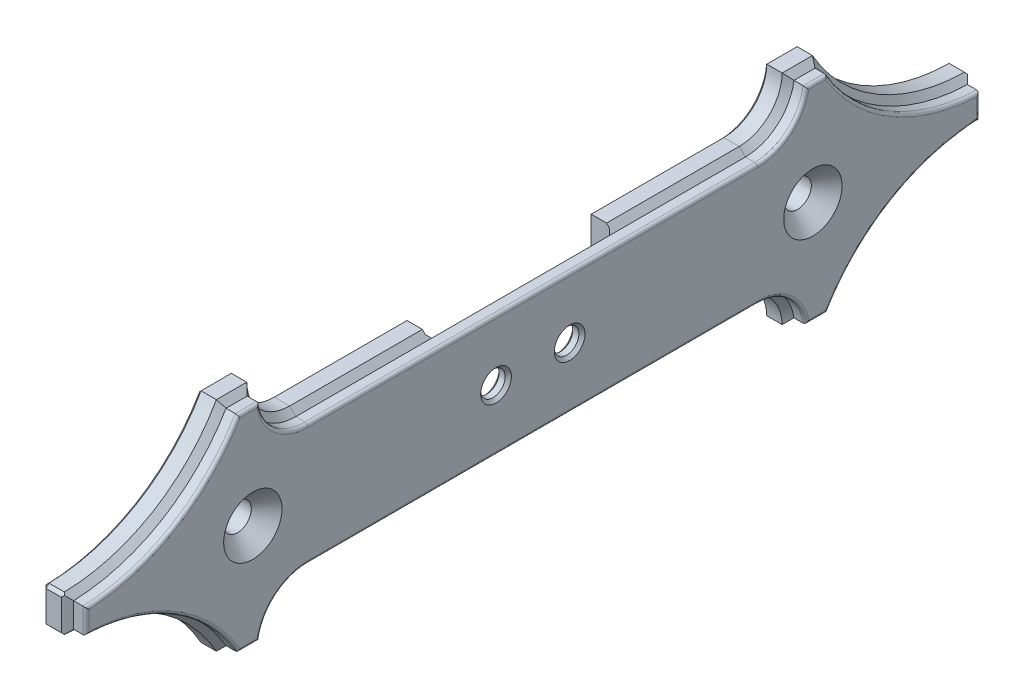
ISO-10303-21;
HEADER;
FILE_DESCRIPTION(('STEP AP214'),'2;1');
FILE_NAME('part.step','',(''),(''),'','','');
FILE_SCHEMA(('AUTOMOTIVE_DESIGN { 1 0 10303 214 1 1 1 1 }'));
ENDSEC;
DATA;
#1=APPLICATION_CONTEXT('core data for automotive mechanical design processes');
#2=APPLICATION_PROTOCOL_DEFINITION('international standard','automotive_design',2000,#1);
#3=PRODUCT_CONTEXT('',#1,'mechanical');
#4=PRODUCT('Part','Part','',(#3));
#5=PRODUCT_RELATED_PRODUCT_CATEGORY('part','',(#4));
#6=PRODUCT_DEFINITION_FORMATION('','',#4);
#7=PRODUCT_DEFINITION_CONTEXT('part definition',#1,'design');
#8=PRODUCT_DEFINITION('design','',#6,#7);
#9=PRODUCT_DEFINITION_SHAPE('','',#8);
#10=(LENGTH_UNIT() NAMED_UNIT(*) SI_UNIT(.MILLI.,.METRE.));
#11=(NAMED_UNIT(*) PLANE_ANGLE_UNIT() SI_UNIT($,.RADIAN.));
#12=(NAMED_UNIT(*) SI_UNIT($,.STERADIAN.) SOLID_ANGLE_UNIT());
#13=UNCERTAINTY_MEASURE_WITH_UNIT(LENGTH_MEASURE(1.E-05),#10,'distance_accuracy_value','');
#14=(GEOMETRIC_REPRESENTATION_CONTEXT(3) GLOBAL_UNCERTAINTY_ASSIGNED_CONTEXT((#13)) GLOBAL_UNIT_ASSIGNED_CONTEXT((#10,
#11,#12)) REPRESENTATION_CONTEXT('',''));
#15=CARTESIAN_POINT('',(0.,0.,0.));
#16=DIRECTION('',(0.,0.,1.));
#17=DIRECTION('',(1.,0.,0.));
#18=AXIS2_PLACEMENT_3D('',#15,#16,#17);
#19=CARTESIAN_POINT('',(6.,-10.89,36.615));
#20=DIRECTION('',(0.,1.,0.));
#21=DIRECTION('',(0.,0.,1.));
#22=AXIS2_PLACEMENT_3D('',#19,#20,#21);
#23=PLANE('',#22);
#24=DIRECTION('',(-1.,0.,0.));
#25=VECTOR('',#24,1.);
#26=CARTESIAN_POINT('',(6.,-10.89,36.615));
#27=LINE('',#26,#25);
#28=CARTESIAN_POINT('',(2.99999999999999,-10.89,36.615));
#29=VERTEX_POINT('',#28);
#30=CARTESIAN_POINT('',(0.499999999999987,-10.89,36.615));
#31=VERTEX_POINT('',#30);
#32=EDGE_CURVE('E1033',#29,#31,#27,.T.);
#33=ORIENTED_EDGE('',*,*,#32,.T.);
#34=DIRECTION('',(0.,0.,-1.));
#35=VECTOR('',#34,1.);
#36=CARTESIAN_POINT('',(0.499999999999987,-10.89,36.615));
#37=LINE('',#36,#35);
#38=CARTESIAN_POINT('',(0.499999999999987,-10.89,15.));
#39=VERTEX_POINT('',#38);
#40=EDGE_CURVE('E1434',#31,#39,#37,.T.);
#41=ORIENTED_EDGE('',*,*,#40,.T.);
#42=DIRECTION('',(-1.,0.,0.));
#43=VECTOR('',#42,1.);
#44=CARTESIAN_POINT('',(4.,-10.89,15.));
#45=LINE('',#44,#43);
#46=CARTESIAN_POINT('',(2.99999999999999,-10.89,15.));
#47=VERTEX_POINT('',#46);
#48=EDGE_CURVE('E1443',#47,#39,#45,.T.);
#49=ORIENTED_EDGE('',*,*,#48,.F.);
#50=DIRECTION('',(0.,0.,1.));
#51=VECTOR('',#50,1.);
#52=CARTESIAN_POINT('',(2.99999999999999,-10.89,36.615));
#53=LINE('',#52,#51);
#54=EDGE_CURVE('E1629',#47,#29,#53,.T.);
#55=ORIENTED_EDGE('',*,*,#54,.T.);
#56=EDGE_LOOP('',(#33,#41,#49,#55));
#57=FACE_BOUND('',#56,.T.);
#58=ADVANCED_FACE('F31',(#57),#23,.F.);
#59=DIRECTION('',(-1.,0.,0.));
#60=VECTOR('',#59,1.);
#61=CARTESIAN_POINT('',(4.,-10.89,-15.));
#62=LINE('',#61,#60);
#63=CARTESIAN_POINT('',(2.99999999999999,-10.89,-15.));
#64=VERTEX_POINT('',#63);
#65=CARTESIAN_POINT('',(0.499999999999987,-10.89,-15.));
#66=VERTEX_POINT('',#65);
#67=EDGE_CURVE('E450',#64,#66,#62,.T.);
#68=ORIENTED_EDGE('',*,*,#67,.T.);
#69=DIRECTION('',(0.,0.,-1.));
#70=VECTOR('',#69,1.);
#71=CARTESIAN_POINT('',(0.499999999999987,-10.89,36.615));
#72=LINE('',#71,#70);
#73=CARTESIAN_POINT('',(0.499999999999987,-10.89,-36.615));
#74=VERTEX_POINT('',#73);
#75=EDGE_CURVE('E917',#66,#74,#72,.T.);
#76=ORIENTED_EDGE('',*,*,#75,.T.);
#77=DIRECTION('',(-1.,0.,0.));
#78=VECTOR('',#77,1.);
#79=CARTESIAN_POINT('',(6.,-10.89,-36.615));
#80=LINE('',#79,#78);
#81=CARTESIAN_POINT('',(2.99999999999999,-10.89,-36.615));
#82=VERTEX_POINT('',#81);
#83=EDGE_CURVE('E1030',#82,#74,#80,.T.);
#84=ORIENTED_EDGE('',*,*,#83,.F.);
#85=EDGE_CURVE('E1624',#82,#64,#53,.T.);
#86=ORIENTED_EDGE('',*,*,#85,.T.);
#87=EDGE_LOOP('',(#68,#76,#84,#86));
#88=FACE_BOUND('',#87,.T.);
#89=ADVANCED_FACE('F1259',(#88),#23,.F.);
#90=CARTESIAN_POINT('',(6.,10.89,36.615));
#91=DIRECTION('',(0.,-1.,0.));
#92=DIRECTION('',(0.,0.,-1.));
#93=AXIS2_PLACEMENT_3D('',#90,#91,#92);
#94=PLANE('',#93);
#95=DIRECTION('',(-1.,0.,0.));
#96=VECTOR('',#95,1.);
#97=CARTESIAN_POINT('',(4.,10.89,15.));
#98=LINE('',#97,#96);
#99=CARTESIAN_POINT('',(3.00000000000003,10.89,15.));
#100=VERTEX_POINT('',#99);
#101=CARTESIAN_POINT('',(0.499999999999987,10.89,15.));
#102=VERTEX_POINT('',#101);
#103=EDGE_CURVE('E451',#100,#102,#98,.T.);
#104=ORIENTED_EDGE('',*,*,#103,.T.);
#105=DIRECTION('',(0.,0.,1.));
#106=VECTOR('',#105,1.);
#107=CARTESIAN_POINT('',(0.499999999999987,10.89,36.615));
#108=LINE('',#107,#106);
#109=CARTESIAN_POINT('',(0.499999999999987,10.89,36.615));
#110=VERTEX_POINT('',#109);
#111=EDGE_CURVE('E874',#102,#110,#108,.T.);
#112=ORIENTED_EDGE('',*,*,#111,.T.);
#113=DIRECTION('',(-1.,0.,0.));
#114=VECTOR('',#113,1.);
#115=CARTESIAN_POINT('',(6.,10.89,36.615));
#116=LINE('',#115,#114);
#117=CARTESIAN_POINT('',(3.00000000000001,10.89,36.615));
#118=VERTEX_POINT('',#117);
#119=EDGE_CURVE('E1390',#118,#110,#116,.T.);
#120=ORIENTED_EDGE('',*,*,#119,.F.);
#121=DIRECTION('',(0.,0.,-1.));
#122=VECTOR('',#121,1.);
#123=CARTESIAN_POINT('',(3.00000000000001,10.89,-36.615));
#124=LINE('',#123,#122);
#125=EDGE_CURVE('E459',#118,#100,#124,.T.);
#126=ORIENTED_EDGE('',*,*,#125,.T.);
#127=EDGE_LOOP('',(#104,#112,#120,#126));
#128=FACE_BOUND('',#127,.T.);
#129=ADVANCED_FACE('F1265',(#128),#94,.F.);
#130=DIRECTION('',(-1.,0.,0.));
#131=VECTOR('',#130,1.);
#132=CARTESIAN_POINT('',(6.,10.89,-36.615));
#133=LINE('',#132,#131);
#134=CARTESIAN_POINT('',(3.00000000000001,10.89,-36.615));
#135=VERTEX_POINT('',#134);
#136=CARTESIAN_POINT('',(0.499999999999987,10.89,-36.615));
#137=VERTEX_POINT('',#136);
#138=EDGE_CURVE('E983',#135,#137,#133,.T.);
#139=ORIENTED_EDGE('',*,*,#138,.T.);
#140=DIRECTION('',(0.,0.,1.));
#141=VECTOR('',#140,1.);
#142=CARTESIAN_POINT('',(0.499999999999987,10.89,36.615));
#143=LINE('',#142,#141);
#144=CARTESIAN_POINT('',(0.499999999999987,10.89,-15.));
#145=VERTEX_POINT('',#144);
#146=EDGE_CURVE('E449',#137,#145,#143,.T.);
#147=ORIENTED_EDGE('',*,*,#146,.T.);
#148=DIRECTION('',(-1.,0.,0.));
#149=VECTOR('',#148,1.);
#150=CARTESIAN_POINT('',(4.,10.89,-15.));
#151=LINE('',#150,#149);
#152=CARTESIAN_POINT('',(3.00000000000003,10.89,-15.));
#153=VERTEX_POINT('',#152);
#154=EDGE_CURVE('E433',#153,#145,#151,.T.);
#155=ORIENTED_EDGE('',*,*,#154,.F.);
#156=EDGE_CURVE('E446',#153,#135,#124,.T.);
#157=ORIENTED_EDGE('',*,*,#156,.T.);
#158=EDGE_LOOP('',(#139,#147,#155,#157));
#159=FACE_BOUND('',#158,.T.);
#160=ADVANCED_FACE('F445',(#159),#94,.F.);
#161=CARTESIAN_POINT('',(0.,32.,73.81));
#162=DIRECTION('',(1.,0.,0.));
#163=DIRECTION('',(0.,0.,-1.));
#164=AXIS2_PLACEMENT_3D('',#161,#162,#163);
#165=PLANE('',#164);
#166=DIRECTION('',(0.,-1.,0.));
#167=VECTOR('',#166,1.);
#168=CARTESIAN_POINT('',(0.,-10.89,15.5));
#169=LINE('',#168,#167);
#170=CARTESIAN_POINT('',(0.,10.39,15.5));
#171=VERTEX_POINT('',#170);
#172=CARTESIAN_POINT('',(0.,-10.39,15.5));
#173=VERTEX_POINT('',#172);
#174=EDGE_CURVE('E1572',#171,#173,#169,.T.);
#175=ORIENTED_EDGE('',*,*,#174,.T.);
#176=DIRECTION('',(0.,0.,1.));
#177=VECTOR('',#176,1.);
#178=CARTESIAN_POINT('',(0.,-10.39,73.81));
#179=LINE('',#178,#177);
#180=CARTESIAN_POINT('',(0.,-10.39,36.615));
#181=VERTEX_POINT('',#180);
#182=EDGE_CURVE('E1336',#173,#181,#179,.T.);
#183=ORIENTED_EDGE('',*,*,#182,.T.);
#184=CARTESIAN_POINT('',(0.,-17.89,36.615));
#185=DIRECTION('',(1.,0.,0.));
#186=DIRECTION('',(0.,0.,-1.));
#187=AXIS2_PLACEMENT_3D('',#184,#185,#186);
#188=CIRCLE('',#187,7.5);
#189=CARTESIAN_POINT('',(0.,-17.25,44.0876434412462));
#190=VERTEX_POINT('',#189);
#191=EDGE_CURVE('E1334',#181,#190,#188,.T.);
#192=ORIENTED_EDGE('',*,*,#191,.T.);
#193=DIRECTION('',(0.,0.,1.));
#194=VECTOR('',#193,1.);
#195=CARTESIAN_POINT('',(0.,-17.25,73.81));
#196=LINE('',#195,#194);
#197=CARTESIAN_POINT('',(0.,-17.25,48.2622505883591));
#198=VERTEX_POINT('',#197);
#199=EDGE_CURVE('E1332',#190,#198,#196,.T.);
#200=ORIENTED_EDGE('',*,*,#199,.T.);
#201=CARTESIAN_POINT('',(0.,-32.,73.81));
#202=DIRECTION('',(1.,0.,0.));
#203=DIRECTION('',(0.,0.,-1.));
#204=AXIS2_PLACEMENT_3D('',#201,#202,#203);
#205=CIRCLE('',#204,29.5);
#206=CARTESIAN_POINT('',(0.,-2.50423759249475,73.31));
#207=VERTEX_POINT('',#206);
#208=EDGE_CURVE('E1325',#198,#207,#205,.T.);
#209=ORIENTED_EDGE('',*,*,#208,.T.);
#210=DIRECTION('',(0.,1.,0.));
#211=VECTOR('',#210,1.);
#212=CARTESIAN_POINT('',(0.,32.,73.31));
#213=LINE('',#212,#211);
#214=CARTESIAN_POINT('',(0.,2.50423759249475,73.31));
#215=VERTEX_POINT('',#214);
#216=EDGE_CURVE('E1322',#207,#215,#213,.T.);
#217=ORIENTED_EDGE('',*,*,#216,.T.);
#218=CARTESIAN_POINT('',(0.,32.,73.81));
#219=DIRECTION('',(1.,0.,0.));
#220=DIRECTION('',(0.,0.,-1.));
#221=AXIS2_PLACEMENT_3D('',#218,#219,#220);
#222=CIRCLE('',#221,29.5);
#223=CARTESIAN_POINT('',(0.,17.25,48.2622505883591));
#224=VERTEX_POINT('',#223);
#225=EDGE_CURVE('E1319',#215,#224,#222,.T.);
#226=ORIENTED_EDGE('',*,*,#225,.T.);
#227=DIRECTION('',(0.,0.,-1.));
#228=VECTOR('',#227,1.);
#229=CARTESIAN_POINT('',(0.,17.25,73.81));
#230=LINE('',#229,#228);
#231=CARTESIAN_POINT('',(0.,17.25,44.0876434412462));
#232=VERTEX_POINT('',#231);
#233=EDGE_CURVE('E1323',#224,#232,#230,.T.);
#234=ORIENTED_EDGE('',*,*,#233,.T.);
#235=CARTESIAN_POINT('',(0.,17.89,36.615));
#236=DIRECTION('',(1.,0.,0.));
#237=DIRECTION('',(0.,0.,-1.));
#238=AXIS2_PLACEMENT_3D('',#235,#236,#237);
#239=CIRCLE('',#238,7.5);
#240=CARTESIAN_POINT('',(0.,10.39,36.615));
#241=VERTEX_POINT('',#240);
#242=EDGE_CURVE('E1327',#232,#241,#239,.T.);
#243=ORIENTED_EDGE('',*,*,#242,.T.);
#244=DIRECTION('',(0.,0.,-1.));
#245=VECTOR('',#244,1.);
#246=CARTESIAN_POINT('',(0.,10.39,73.81));
#247=LINE('',#246,#245);
#248=EDGE_CURVE('E1570',#241,#171,#247,.T.);
#249=ORIENTED_EDGE('',*,*,#248,.T.);
#250=EDGE_LOOP('',(#175,#183,#192,#200,#209,#217,#226,#234,#243,#249));
#251=FACE_BOUND('',#250,.T.);
#252=CARTESIAN_POINT('',(0.,0.,45.615));
#253=DIRECTION('',(1.,0.,0.));
#254=DIRECTION('',(0.,0.,-1.));
#255=AXIS2_PLACEMENT_3D('',#252,#253,#254);
#256=CIRCLE('',#255,2.74999999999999);
#257=CARTESIAN_POINT('',(0.,0.,42.865));
#258=VERTEX_POINT('',#257);
#259=EDGE_CURVE('E1446',#258,#258,#256,.T.);
#260=ORIENTED_EDGE('',*,*,#259,.T.);
#261=EDGE_LOOP('',(#260));
#262=FACE_BOUND('',#261,.T.);
#263=ADVANCED_FACE('F1411',(#251,#262),#165,.F.);
#264=CARTESIAN_POINT('',(0.,-17.89,-36.615));
#265=DIRECTION('',(1.,0.,0.));
#266=DIRECTION('',(0.,0.,-1.));
#267=AXIS2_PLACEMENT_3D('',#264,#265,#266);
#268=CIRCLE('',#267,7.5);
#269=CARTESIAN_POINT('',(0.,-17.25,-44.0876434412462));
#270=VERTEX_POINT('',#269);
#271=CARTESIAN_POINT('',(0.,-10.39,-36.615));
#272=VERTEX_POINT('',#271);
#273=EDGE_CURVE('E932',#270,#272,#268,.T.);
#274=ORIENTED_EDGE('',*,*,#273,.T.);
#275=DIRECTION('',(0.,0.,1.));
#276=VECTOR('',#275,1.);
#277=CARTESIAN_POINT('',(0.,-10.39,73.81));
#278=LINE('',#277,#276);
#279=CARTESIAN_POINT('',(0.,-10.39,-15.5));
#280=VERTEX_POINT('',#279);
#281=EDGE_CURVE('E934',#272,#280,#278,.T.);
#282=ORIENTED_EDGE('',*,*,#281,.T.);
#283=DIRECTION('',(0.,1.,0.));
#284=VECTOR('',#283,1.);
#285=CARTESIAN_POINT('',(0.,10.89,-15.5));
#286=LINE('',#285,#284);
#287=CARTESIAN_POINT('',(0.,10.39,-15.5));
#288=VERTEX_POINT('',#287);
#289=EDGE_CURVE('E903',#280,#288,#286,.T.);
#290=ORIENTED_EDGE('',*,*,#289,.T.);
#291=DIRECTION('',(0.,0.,-1.));
#292=VECTOR('',#291,1.);
#293=CARTESIAN_POINT('',(0.,10.39,73.81));
#294=LINE('',#293,#292);
#295=CARTESIAN_POINT('',(0.,10.39,-36.615));
#296=VERTEX_POINT('',#295);
#297=EDGE_CURVE('E908',#288,#296,#294,.T.);
#298=ORIENTED_EDGE('',*,*,#297,.T.);
#299=CARTESIAN_POINT('',(0.,17.89,-36.615));
#300=DIRECTION('',(1.,0.,0.));
#301=DIRECTION('',(0.,0.,-1.));
#302=AXIS2_PLACEMENT_3D('',#299,#300,#301);
#303=CIRCLE('',#302,7.5);
#304=CARTESIAN_POINT('',(0.,17.25,-44.0876434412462));
#305=VERTEX_POINT('',#304);
#306=EDGE_CURVE('E914',#296,#305,#303,.T.);
#307=ORIENTED_EDGE('',*,*,#306,.T.);
#308=DIRECTION('',(0.,0.,-1.));
#309=VECTOR('',#308,1.);
#310=CARTESIAN_POINT('',(0.,17.2500000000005,73.8100000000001));
#311=LINE('',#310,#309);
#312=CARTESIAN_POINT('',(0.,17.25,-48.2622505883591));
#313=VERTEX_POINT('',#312);
#314=EDGE_CURVE('E922',#305,#313,#311,.T.);
#315=ORIENTED_EDGE('',*,*,#314,.T.);
#316=CARTESIAN_POINT('',(0.,32.,-73.81));
#317=DIRECTION('',(1.,0.,0.));
#318=DIRECTION('',(0.,0.,-1.));
#319=AXIS2_PLACEMENT_3D('',#316,#317,#318);
#320=CIRCLE('',#319,29.5);
#321=CARTESIAN_POINT('',(0.,2.50423759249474,-73.31));
#322=VERTEX_POINT('',#321);
#323=EDGE_CURVE('E924',#313,#322,#320,.T.);
#324=ORIENTED_EDGE('',*,*,#323,.T.);
#325=DIRECTION('',(0.,-1.,0.));
#326=VECTOR('',#325,1.);
#327=CARTESIAN_POINT('',(0.,32.,-73.31));
#328=LINE('',#327,#326);
#329=CARTESIAN_POINT('',(0.,-2.50423759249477,-73.31));
#330=VERTEX_POINT('',#329);
#331=EDGE_CURVE('E926',#322,#330,#328,.T.);
#332=ORIENTED_EDGE('',*,*,#331,.T.);
#333=CARTESIAN_POINT('',(0.,-32.,-73.81));
#334=DIRECTION('',(1.,0.,0.));
#335=DIRECTION('',(0.,0.,-1.));
#336=AXIS2_PLACEMENT_3D('',#333,#334,#335);
#337=CIRCLE('',#336,29.5);
#338=CARTESIAN_POINT('',(0.,-17.25,-48.2622505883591));
#339=VERTEX_POINT('',#338);
#340=EDGE_CURVE('E928',#330,#339,#337,.T.);
#341=ORIENTED_EDGE('',*,*,#340,.T.);
#342=DIRECTION('',(0.,0.,1.));
#343=VECTOR('',#342,1.);
#344=CARTESIAN_POINT('',(0.,-17.2499999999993,73.8100000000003));
#345=LINE('',#344,#343);
#346=EDGE_CURVE('E930',#339,#270,#345,.T.);
#347=ORIENTED_EDGE('',*,*,#346,.T.);
#348=EDGE_LOOP('',(#274,#282,#290,#298,#307,#315,#324,#332,#341,#347));
#349=FACE_BOUND('',#348,.T.);
#350=CARTESIAN_POINT('',(0.,0.,-45.615));
#351=DIRECTION('',(1.,0.,0.));
#352=DIRECTION('',(0.,0.,-1.));
#353=AXIS2_PLACEMENT_3D('',#350,#351,#352);
#354=CIRCLE('',#353,2.74999999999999);
#355=CARTESIAN_POINT('',(0.,0.,-48.365));
#356=VERTEX_POINT('',#355);
#357=EDGE_CURVE('E912',#356,#356,#354,.T.);
#358=ORIENTED_EDGE('',*,*,#357,.T.);
#359=EDGE_LOOP('',(#358));
#360=FACE_BOUND('',#359,.T.);
#361=ADVANCED_FACE('F1559',(#349,#360),#165,.F.);
#362=CARTESIAN_POINT('',(6.,0.,6.));
#363=DIRECTION('',(-1.,0.,0.));
#364=DIRECTION('',(0.,0.,1.));
#365=AXIS2_PLACEMENT_3D('',#362,#363,#364);
#366=CYLINDRICAL_SURFACE('',#365,2.);
#367=CARTESIAN_POINT('',(4.49999999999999,0.,6.));
#368=DIRECTION('',(-1.,0.,0.));
#369=DIRECTION('',(0.,0.,1.));
#370=AXIS2_PLACEMENT_3D('',#367,#368,#369);
#371=CIRCLE('',#370,2.);
#372=CARTESIAN_POINT('',(4.49999999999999,0.,8.));
#373=VERTEX_POINT('',#372);
#374=EDGE_CURVE('E1613',#373,#373,#371,.T.);
#375=ORIENTED_EDGE('',*,*,#374,.T.);
#376=EDGE_LOOP('',(#375));
#377=FACE_BOUND('',#376,.T.);
#378=CARTESIAN_POINT('',(5.49999999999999,0.,6.));
#379=DIRECTION('',(1.,0.,0.));
#380=DIRECTION('',(0.,0.,-1.));
#381=AXIS2_PLACEMENT_3D('',#378,#379,#380);
#382=CIRCLE('',#381,2.);
#383=CARTESIAN_POINT('',(5.49999999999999,0.,4.));
#384=VERTEX_POINT('',#383);
#385=EDGE_CURVE('E1616',#384,#384,#382,.T.);
#386=ORIENTED_EDGE('',*,*,#385,.T.);
#387=EDGE_LOOP('',(#386));
#388=FACE_BOUND('',#387,.T.);
#389=ADVANCED_FACE('F1701',(#377,#388),#366,.F.);
#390=CARTESIAN_POINT('',(6.,0.,-6.));
#391=DIRECTION('',(-1.,0.,0.));
#392=DIRECTION('',(0.,0.,1.));
#393=AXIS2_PLACEMENT_3D('',#390,#391,#392);
#394=CYLINDRICAL_SURFACE('',#393,2.);
#395=CARTESIAN_POINT('',(4.5,0.,-6.));
#396=DIRECTION('',(-1.,0.,0.));
#397=DIRECTION('',(0.,0.,1.));
#398=AXIS2_PLACEMENT_3D('',#395,#396,#397);
#399=CIRCLE('',#398,2.);
#400=CARTESIAN_POINT('',(4.5,0.,-4.));
#401=VERTEX_POINT('',#400);
#402=EDGE_CURVE('E1589',#401,#401,#399,.T.);
#403=ORIENTED_EDGE('',*,*,#402,.T.);
#404=EDGE_LOOP('',(#403));
#405=FACE_BOUND('',#404,.T.);
#406=CARTESIAN_POINT('',(5.49999999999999,0.,-6.));
#407=DIRECTION('',(1.,0.,0.));
#408=DIRECTION('',(0.,0.,-1.));
#409=AXIS2_PLACEMENT_3D('',#406,#407,#408);
#410=CIRCLE('',#409,2.);
#411=CARTESIAN_POINT('',(5.49999999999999,0.,-8.));
#412=VERTEX_POINT('',#411);
#413=EDGE_CURVE('E1592',#412,#412,#410,.T.);
#414=ORIENTED_EDGE('',*,*,#413,.T.);
#415=EDGE_LOOP('',(#414));
#416=FACE_BOUND('',#415,.T.);
#417=ADVANCED_FACE('F1696',(#405,#416),#394,.F.);
#418=CARTESIAN_POINT('',(4.,9.89,73.81));
#419=DIRECTION('',(0.707106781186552,0.707106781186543,0.));
#420=DIRECTION('',(-0.707106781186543,0.707106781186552,0.));
#421=AXIS2_PLACEMENT_3D('',#418,#419,#420);
#422=PLANE('',#421);
#423=DIRECTION('',(0.,0.,1.));
#424=VECTOR('',#423,1.);
#425=CARTESIAN_POINT('',(4.,9.89000000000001,-36.615));
#426=LINE('',#425,#424);
#427=CARTESIAN_POINT('',(4.,9.89,14.5));
#428=VERTEX_POINT('',#427);
#429=CARTESIAN_POINT('',(4.,9.89,36.615));
#430=VERTEX_POINT('',#429);
#431=EDGE_CURVE('E1493',#428,#430,#426,.T.);
#432=ORIENTED_EDGE('',*,*,#431,.F.);
#433=DIRECTION('',(0.577350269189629,-0.577350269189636,-0.577350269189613));
#434=VECTOR('',#433,1.);
#435=CARTESIAN_POINT('',(3.33333333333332,10.5566666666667,15.1666666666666));
#436=LINE('',#435,#434);
#437=CARTESIAN_POINT('',(3.49999999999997,10.39,15.));
#438=VERTEX_POINT('',#437);
#439=EDGE_CURVE('E849',#428,#438,#436,.F.);
#440=ORIENTED_EDGE('',*,*,#439,.T.);
#441=DIRECTION('',(-0.707106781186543,0.707106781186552,0.));
#442=VECTOR('',#441,1.);
#443=CARTESIAN_POINT('',(4.,9.89,15.));
#444=LINE('',#443,#442);
#445=EDGE_CURVE('E440',#438,#100,#444,.T.);
#446=ORIENTED_EDGE('',*,*,#445,.T.);
#447=ORIENTED_EDGE('',*,*,#125,.F.);
#448=DIRECTION('',(0.707106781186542,-0.707106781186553,0.));
#449=VECTOR('',#448,1.);
#450=CARTESIAN_POINT('',(3.00000000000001,10.89,36.615));
#451=LINE('',#450,#449);
#452=EDGE_CURVE('E600',#118,#430,#451,.T.);
#453=ORIENTED_EDGE('',*,*,#452,.T.);
#454=EDGE_LOOP('',(#432,#440,#446,#447,#453));
#455=FACE_BOUND('',#454,.T.);
#456=ADVANCED_FACE('F618',(#455),#422,.T.);
#457=ORIENTED_EDGE('',*,*,#156,.F.);
#458=DIRECTION('',(0.707106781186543,-0.707106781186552,0.));
#459=VECTOR('',#458,1.);
#460=CARTESIAN_POINT('',(4.00000000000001,9.89,-15.));
#461=LINE('',#460,#459);
#462=CARTESIAN_POINT('',(3.49999999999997,10.39,-15.));
#463=VERTEX_POINT('',#462);
#464=EDGE_CURVE('E429',#153,#463,#461,.T.);
#465=ORIENTED_EDGE('',*,*,#464,.T.);
#466=DIRECTION('',(-0.577350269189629,0.577350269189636,-0.577350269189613));
#467=VECTOR('',#466,1.);
#468=CARTESIAN_POINT('',(3.33333333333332,10.5566666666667,-15.1666666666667));
#469=LINE('',#468,#467);
#470=CARTESIAN_POINT('',(4.,9.89000000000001,-14.5));
#471=VERTEX_POINT('',#470);
#472=EDGE_CURVE('E877',#463,#471,#469,.F.);
#473=ORIENTED_EDGE('',*,*,#472,.T.);
#474=CARTESIAN_POINT('',(4.,9.89000000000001,-36.615));
#475=VERTEX_POINT('',#474);
#476=EDGE_CURVE('E1494',#475,#471,#426,.T.);
#477=ORIENTED_EDGE('',*,*,#476,.F.);
#478=DIRECTION('',(0.707106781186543,-0.707106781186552,0.));
#479=VECTOR('',#478,1.);
#480=CARTESIAN_POINT('',(3.00000000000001,10.89,-36.615));
#481=LINE('',#480,#479);
#482=EDGE_CURVE('E457',#135,#475,#481,.T.);
#483=ORIENTED_EDGE('',*,*,#482,.F.);
#484=EDGE_LOOP('',(#457,#465,#473,#477,#483));
#485=FACE_BOUND('',#484,.T.);
#486=ADVANCED_FACE('F454',(#485),#422,.T.);
#487=CARTESIAN_POINT('',(4.,-9.88999999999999,73.81));
#488=DIRECTION('',(0.707106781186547,-0.707106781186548,0.));
#489=DIRECTION('',(0.707106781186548,0.707106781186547,0.));
#490=AXIS2_PLACEMENT_3D('',#487,#488,#489);
#491=PLANE('',#490);
#492=ORIENTED_EDGE('',*,*,#54,.F.);
#493=DIRECTION('',(0.707106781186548,0.707106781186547,0.));
#494=VECTOR('',#493,1.);
#495=CARTESIAN_POINT('',(4.,-9.88999999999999,15.));
#496=LINE('',#495,#494);
#497=CARTESIAN_POINT('',(3.49999999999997,-10.39,15.));
#498=VERTEX_POINT('',#497);
#499=EDGE_CURVE('E1451',#47,#498,#496,.T.);
#500=ORIENTED_EDGE('',*,*,#499,.T.);
#501=DIRECTION('',(-0.577350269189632,-0.57735026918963,0.577350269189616));
#502=VECTOR('',#501,1.);
#503=CARTESIAN_POINT('',(10.5933333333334,-3.29666666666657,7.90666666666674));
#504=LINE('',#503,#502);
#505=CARTESIAN_POINT('',(4.,-9.89,14.5));
#506=VERTEX_POINT('',#505);
#507=EDGE_CURVE('E886',#498,#506,#504,.F.);
#508=ORIENTED_EDGE('',*,*,#507,.T.);
#509=DIRECTION('',(0.,0.,-1.));
#510=VECTOR('',#509,1.);
#511=CARTESIAN_POINT('',(4.,-9.89,36.615));
#512=LINE('',#511,#510);
#513=CARTESIAN_POINT('',(4.,-9.89,36.615));
#514=VERTEX_POINT('',#513);
#515=EDGE_CURVE('E47',#514,#506,#512,.T.);
#516=ORIENTED_EDGE('',*,*,#515,.F.);
#517=DIRECTION('',(-0.707106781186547,-0.707106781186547,0.));
#518=VECTOR('',#517,1.);
#519=CARTESIAN_POINT('',(4.,-9.88999999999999,36.615));
#520=LINE('',#519,#518);
#521=EDGE_CURVE('E509',#514,#29,#520,.T.);
#522=ORIENTED_EDGE('',*,*,#521,.T.);
#523=EDGE_LOOP('',(#492,#500,#508,#516,#522));
#524=FACE_BOUND('',#523,.T.);
#525=ADVANCED_FACE('F492',(#524),#491,.T.);
#526=CARTESIAN_POINT('',(4.,-9.88999999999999,-14.5));
#527=VERTEX_POINT('',#526);
#528=CARTESIAN_POINT('',(4.,-9.88999999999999,-36.615));
#529=VERTEX_POINT('',#528);
#530=EDGE_CURVE('E1473',#527,#529,#512,.T.);
#531=ORIENTED_EDGE('',*,*,#530,.F.);
#532=DIRECTION('',(0.577350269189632,0.57735026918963,0.577350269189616));
#533=VECTOR('',#532,1.);
#534=CARTESIAN_POINT('',(10.5933333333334,-3.29666666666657,-7.90666666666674));
#535=LINE('',#534,#533);
#536=CARTESIAN_POINT('',(3.49999999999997,-10.39,-15.));
#537=VERTEX_POINT('',#536);
#538=EDGE_CURVE('E884',#527,#537,#535,.F.);
#539=ORIENTED_EDGE('',*,*,#538,.T.);
#540=DIRECTION('',(-0.707106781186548,-0.707106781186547,0.));
#541=VECTOR('',#540,1.);
#542=CARTESIAN_POINT('',(3.99999999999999,-9.88999999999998,-15.));
#543=LINE('',#542,#541);
#544=EDGE_CURVE('E463',#537,#64,#543,.T.);
#545=ORIENTED_EDGE('',*,*,#544,.T.);
#546=ORIENTED_EDGE('',*,*,#85,.F.);
#547=DIRECTION('',(-0.707106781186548,-0.707106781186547,0.));
#548=VECTOR('',#547,1.);
#549=CARTESIAN_POINT('',(4.,-9.88999999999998,-36.615));
#550=LINE('',#549,#548);
#551=EDGE_CURVE('E475',#529,#82,#550,.T.);
#552=ORIENTED_EDGE('',*,*,#551,.F.);
#553=EDGE_LOOP('',(#531,#539,#545,#546,#552));
#554=FACE_BOUND('',#553,.T.);
#555=ADVANCED_FACE('F1292',(#554),#491,.T.);
#556=CARTESIAN_POINT('',(6.,32.,73.81));
#557=DIRECTION('',(1.,0.,0.));
#558=DIRECTION('',(0.,0.,-1.));
#559=AXIS2_PLACEMENT_3D('',#556,#557,#558);
#560=PLANE('',#559);
#561=CARTESIAN_POINT('',(6.,0.,-45.615));
#562=DIRECTION('',(1.,0.,0.));
#563=DIRECTION('',(0.,0.,-1.));
#564=AXIS2_PLACEMENT_3D('',#561,#562,#563);
#565=CIRCLE('',#564,4.75);
#566=CARTESIAN_POINT('',(6.,0.,-50.365));
#567=VERTEX_POINT('',#566);
#568=EDGE_CURVE('E40',#567,#567,#565,.F.);
#569=ORIENTED_EDGE('',*,*,#568,.T.);
#570=EDGE_LOOP('',(#569));
#571=FACE_BOUND('',#570,.T.);
#572=CARTESIAN_POINT('',(6.,0.,45.615));
#573=DIRECTION('',(1.,0.,0.));
#574=DIRECTION('',(0.,0.,-1.));
#575=AXIS2_PLACEMENT_3D('',#572,#573,#574);
#576=CIRCLE('',#575,4.75);
#577=CARTESIAN_POINT('',(6.,0.,40.865));
#578=VERTEX_POINT('',#577);
#579=EDGE_CURVE('E848',#578,#578,#576,.F.);
#580=ORIENTED_EDGE('',*,*,#579,.T.);
#581=EDGE_LOOP('',(#580));
#582=FACE_BOUND('',#581,.T.);
#583=CARTESIAN_POINT('',(6.,0.,6.));
#584=DIRECTION('',(1.,0.,0.));
#585=DIRECTION('',(0.,0.,-1.));
#586=AXIS2_PLACEMENT_3D('',#583,#584,#585);
#587=CIRCLE('',#586,2.50000000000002);
#588=CARTESIAN_POINT('',(6.,0.,3.49999999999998));
#589=VERTEX_POINT('',#588);
#590=EDGE_CURVE('E1595',#589,#589,#587,.F.);
#591=ORIENTED_EDGE('',*,*,#590,.T.);
#592=EDGE_LOOP('',(#591));
#593=FACE_BOUND('',#592,.T.);
#594=CARTESIAN_POINT('',(6.,0.,-6.));
#595=DIRECTION('',(1.,0.,0.));
#596=DIRECTION('',(0.,0.,-1.));
#597=AXIS2_PLACEMENT_3D('',#594,#595,#596);
#598=CIRCLE('',#597,2.50000000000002);
#599=CARTESIAN_POINT('',(6.,0.,-8.50000000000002));
#600=VERTEX_POINT('',#599);
#601=EDGE_CURVE('E1598',#600,#600,#598,.F.);
#602=ORIENTED_EDGE('',*,*,#601,.T.);
#603=EDGE_LOOP('',(#602));
#604=FACE_BOUND('',#603,.T.);
#605=DIRECTION('',(0.,0.,-1.));
#606=VECTOR('',#605,1.);
#607=CARTESIAN_POINT('',(6.,-9.39,73.81));
#608=LINE('',#607,#606);
#609=CARTESIAN_POINT('',(6.,-9.39,36.615));
#610=VERTEX_POINT('',#609);
#611=CARTESIAN_POINT('',(6.,-9.38999999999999,-36.615));
#612=VERTEX_POINT('',#611);
#613=EDGE_CURVE('E1070',#610,#612,#608,.T.);
#614=ORIENTED_EDGE('',*,*,#613,.T.);
#615=CARTESIAN_POINT('',(6.,-17.89,-36.615));
#616=DIRECTION('',(1.,0.,0.));
#617=DIRECTION('',(0.,0.,-1.));
#618=AXIS2_PLACEMENT_3D('',#615,#616,#617);
#619=CIRCLE('',#618,8.5);
#620=CARTESIAN_POINT('',(6.,-16.25,-44.9552877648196));
#621=VERTEX_POINT('',#620);
#622=EDGE_CURVE('E1072',#612,#621,#619,.F.);
#623=ORIENTED_EDGE('',*,*,#622,.T.);
#624=DIRECTION('',(0.,0.,-1.));
#625=VECTOR('',#624,1.);
#626=CARTESIAN_POINT('',(6.,-16.249999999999,73.8100000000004));
#627=LINE('',#626,#625);
#628=CARTESIAN_POINT('',(6.,-16.25,-47.6912806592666));
#629=VERTEX_POINT('',#628);
#630=EDGE_CURVE('E1068',#621,#629,#627,.T.);
#631=ORIENTED_EDGE('',*,*,#630,.T.);
#632=CARTESIAN_POINT('',(6.,-32.,-73.81));
#633=DIRECTION('',(1.,0.,0.));
#634=DIRECTION('',(0.,0.,-1.));
#635=AXIS2_PLACEMENT_3D('',#632,#633,#634);
#636=CIRCLE('',#635,30.5);
#637=CARTESIAN_POINT('',(6.,-1.53690757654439,-72.31));
#638=VERTEX_POINT('',#637);
#639=EDGE_CURVE('E1066',#629,#638,#636,.F.);
#640=ORIENTED_EDGE('',*,*,#639,.T.);
#641=DIRECTION('',(0.,1.,0.));
#642=VECTOR('',#641,1.);
#643=CARTESIAN_POINT('',(6.,32.,-72.31));
#644=LINE('',#643,#642);
#645=CARTESIAN_POINT('',(6.,1.53690757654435,-72.31));
#646=VERTEX_POINT('',#645);
#647=EDGE_CURVE('E1064',#638,#646,#644,.T.);
#648=ORIENTED_EDGE('',*,*,#647,.T.);
#649=CARTESIAN_POINT('',(6.,32.,-73.81));
#650=DIRECTION('',(1.,0.,0.));
#651=DIRECTION('',(0.,0.,-1.));
#652=AXIS2_PLACEMENT_3D('',#649,#650,#651);
#653=CIRCLE('',#652,30.5);
#654=CARTESIAN_POINT('',(6.,16.25,-47.6912806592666));
#655=VERTEX_POINT('',#654);
#656=EDGE_CURVE('E1062',#646,#655,#653,.F.);
#657=ORIENTED_EDGE('',*,*,#656,.T.);
#658=DIRECTION('',(0.,0.,1.));
#659=VECTOR('',#658,1.);
#660=CARTESIAN_POINT('',(6.,16.25,73.81));
#661=LINE('',#660,#659);
#662=CARTESIAN_POINT('',(6.,16.25,-44.9552877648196));
#663=VERTEX_POINT('',#662);
#664=EDGE_CURVE('E1060',#655,#663,#661,.T.);
#665=ORIENTED_EDGE('',*,*,#664,.T.);
#666=CARTESIAN_POINT('',(6.,17.89,-36.615));
#667=DIRECTION('',(1.,0.,0.));
#668=DIRECTION('',(0.,0.,-1.));
#669=AXIS2_PLACEMENT_3D('',#666,#667,#668);
#670=CIRCLE('',#669,8.5);
#671=CARTESIAN_POINT('',(6.,9.39000000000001,-36.615));
#672=VERTEX_POINT('',#671);
#673=EDGE_CURVE('E1046',#663,#672,#670,.F.);
#674=ORIENTED_EDGE('',*,*,#673,.T.);
#675=DIRECTION('',(0.,0.,1.));
#676=VECTOR('',#675,1.);
#677=CARTESIAN_POINT('',(6.,9.39,73.81));
#678=LINE('',#677,#676);
#679=CARTESIAN_POINT('',(6.,9.39,36.615));
#680=VERTEX_POINT('',#679);
#681=EDGE_CURVE('E1042',#672,#680,#678,.T.);
#682=ORIENTED_EDGE('',*,*,#681,.T.);
#683=CARTESIAN_POINT('',(6.,17.89,36.615));
#684=DIRECTION('',(1.,0.,0.));
#685=DIRECTION('',(0.,0.,-1.));
#686=AXIS2_PLACEMENT_3D('',#683,#684,#685);
#687=CIRCLE('',#686,8.5);
#688=CARTESIAN_POINT('',(6.,16.25,44.9552877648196));
#689=VERTEX_POINT('',#688);
#690=EDGE_CURVE('E1044',#680,#689,#687,.F.);
#691=ORIENTED_EDGE('',*,*,#690,.T.);
#692=DIRECTION('',(0.,0.,1.));
#693=VECTOR('',#692,1.);
#694=CARTESIAN_POINT('',(6.,16.2500000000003,73.8100000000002));
#695=LINE('',#694,#693);
#696=CARTESIAN_POINT('',(6.,16.25,47.6912806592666));
#697=VERTEX_POINT('',#696);
#698=EDGE_CURVE('E1048',#689,#697,#695,.T.);
#699=ORIENTED_EDGE('',*,*,#698,.T.);
#700=CARTESIAN_POINT('',(6.,32.,73.81));
#701=DIRECTION('',(1.,0.,0.));
#702=DIRECTION('',(0.,0.,-1.));
#703=AXIS2_PLACEMENT_3D('',#700,#701,#702);
#704=CIRCLE('',#703,30.5);
#705=CARTESIAN_POINT('',(6.,1.53690757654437,72.31));
#706=VERTEX_POINT('',#705);
#707=EDGE_CURVE('E1050',#697,#706,#704,.F.);
#708=ORIENTED_EDGE('',*,*,#707,.T.);
#709=DIRECTION('',(0.,-1.,0.));
#710=VECTOR('',#709,1.);
#711=CARTESIAN_POINT('',(6.,32.,72.31));
#712=LINE('',#711,#710);
#713=CARTESIAN_POINT('',(6.,-1.53690757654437,72.31));
#714=VERTEX_POINT('',#713);
#715=EDGE_CURVE('E1052',#706,#714,#712,.T.);
#716=ORIENTED_EDGE('',*,*,#715,.T.);
#717=CARTESIAN_POINT('',(6.,-32.,73.81));
#718=DIRECTION('',(1.,0.,0.));
#719=DIRECTION('',(0.,0.,-1.));
#720=AXIS2_PLACEMENT_3D('',#717,#718,#719);
#721=CIRCLE('',#720,30.5);
#722=CARTESIAN_POINT('',(6.,-16.25,47.6912806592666));
#723=VERTEX_POINT('',#722);
#724=EDGE_CURVE('E1054',#714,#723,#721,.F.);
#725=ORIENTED_EDGE('',*,*,#724,.T.);
#726=DIRECTION('',(0.,0.,-1.));
#727=VECTOR('',#726,1.);
#728=CARTESIAN_POINT('',(6.,-16.25,73.81));
#729=LINE('',#728,#727);
#730=CARTESIAN_POINT('',(6.,-16.25,44.9552877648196));
#731=VERTEX_POINT('',#730);
#732=EDGE_CURVE('E1056',#723,#731,#729,.T.);
#733=ORIENTED_EDGE('',*,*,#732,.T.);
#734=CARTESIAN_POINT('',(6.,-17.89,36.615));
#735=DIRECTION('',(1.,0.,0.));
#736=DIRECTION('',(0.,0.,-1.));
#737=AXIS2_PLACEMENT_3D('',#734,#735,#736);
#738=CIRCLE('',#737,8.5);
#739=EDGE_CURVE('E1058',#731,#610,#738,.F.);
#740=ORIENTED_EDGE('',*,*,#739,.T.);
#741=EDGE_LOOP('',(#614,#623,#631,#640,#648,#657,#665,#674,#682,#691,#699,#708,#716,#725,#733,#740));
#742=FACE_BOUND('',#741,.T.);
#743=ADVANCED_FACE('F854',(#571,#582,#593,#604,#742),#560,.T.);
#744=CARTESIAN_POINT('',(6.,32.,73.81));
#745=DIRECTION('',(-1.,0.,0.));
#746=DIRECTION('',(0.,0.,1.));
#747=AXIS2_PLACEMENT_3D('',#744,#745,#746);
#748=CYLINDRICAL_SURFACE('',#747,29.);
#749=CARTESIAN_POINT('',(0.499999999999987,32.,73.81));
#750=DIRECTION('',(1.,0.,0.));
#751=DIRECTION('',(0.,0.,-1.));
#752=AXIS2_PLACEMENT_3D('',#749,#750,#751);
#753=CIRCLE('',#752,29.);
#754=CARTESIAN_POINT('',(0.499999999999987,17.75,48.5525753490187));
#755=VERTEX_POINT('',#754);
#756=CARTESIAN_POINT('',(0.499999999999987,3.00416576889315,73.3184745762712));
#757=VERTEX_POINT('',#756);
#758=EDGE_CURVE('E1296',#755,#757,#753,.F.);
#759=ORIENTED_EDGE('',*,*,#758,.T.);
#760=DIRECTION('',(-1.,0.,0.));
#761=VECTOR('',#760,1.);
#762=CARTESIAN_POINT('',(6.,3.00416576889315,73.3184745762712));
#763=LINE('',#762,#761);
#764=CARTESIAN_POINT('',(2.99999999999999,3.00416576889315,73.3184745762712));
#765=VERTEX_POINT('',#764);
#766=EDGE_CURVE('E1298',#757,#765,#763,.F.);
#767=ORIENTED_EDGE('',*,*,#766,.T.);
#768=CARTESIAN_POINT('',(2.99999999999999,32.,73.81));
#769=DIRECTION('',(1.,0.,0.));
#770=DIRECTION('',(0.,0.,-1.));
#771=AXIS2_PLACEMENT_3D('',#768,#769,#770);
#772=CIRCLE('',#771,29.);
#773=CARTESIAN_POINT('',(2.99999999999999,17.75,48.5525753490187));
#774=VERTEX_POINT('',#773);
#775=EDGE_CURVE('E1640',#765,#774,#772,.T.);
#776=ORIENTED_EDGE('',*,*,#775,.T.);
#777=DIRECTION('',(-1.,0.,0.));
#778=VECTOR('',#777,1.);
#779=CARTESIAN_POINT('',(6.,17.75,48.5525753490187));
#780=LINE('',#779,#778);
#781=EDGE_CURVE('E1301',#774,#755,#780,.T.);
#782=ORIENTED_EDGE('',*,*,#781,.T.);
#783=EDGE_LOOP('',(#759,#767,#776,#782));
#784=FACE_BOUND('',#783,.T.);
#785=ADVANCED_FACE('F1285',(#784),#748,.F.);
#786=CARTESIAN_POINT('',(6.,3.,73.81));
#787=DIRECTION('',(0.,0.,-1.));
#788=DIRECTION('',(-1.,0.,0.));
#789=AXIS2_PLACEMENT_3D('',#786,#787,#788);
#790=PLANE('',#789);
#791=DIRECTION('',(0.,-1.,0.));
#792=VECTOR('',#791,1.);
#793=CARTESIAN_POINT('',(0.499999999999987,3.,73.81));
#794=LINE('',#793,#792);
#795=CARTESIAN_POINT('',(0.499999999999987,2.50423759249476,73.81));
#796=VERTEX_POINT('',#795);
#797=CARTESIAN_POINT('',(0.499999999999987,-2.50423759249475,73.81));
#798=VERTEX_POINT('',#797);
#799=EDGE_CURVE('E1343',#796,#798,#794,.T.);
#800=ORIENTED_EDGE('',*,*,#799,.T.);
#801=DIRECTION('',(1.,0.,0.));
#802=VECTOR('',#801,1.);
#803=CARTESIAN_POINT('',(6.,-2.50423759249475,73.81));
#804=LINE('',#803,#802);
#805=CARTESIAN_POINT('',(2.99999999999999,-2.50423759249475,73.81));
#806=VERTEX_POINT('',#805);
#807=EDGE_CURVE('E1347',#798,#806,#804,.T.);
#808=ORIENTED_EDGE('',*,*,#807,.T.);
#809=DIRECTION('',(0.,1.,0.));
#810=VECTOR('',#809,1.);
#811=CARTESIAN_POINT('',(2.99999999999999,3.,73.81));
#812=LINE('',#811,#810);
#813=CARTESIAN_POINT('',(2.99999999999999,2.50423759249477,73.81));
#814=VERTEX_POINT('',#813);
#815=EDGE_CURVE('E1637',#806,#814,#812,.T.);
#816=ORIENTED_EDGE('',*,*,#815,.T.);
#817=DIRECTION('',(-1.,0.,0.));
#818=VECTOR('',#817,1.);
#819=CARTESIAN_POINT('',(6.,2.50423759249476,73.81));
#820=LINE('',#819,#818);
#821=EDGE_CURVE('E1345',#814,#796,#820,.T.);
#822=ORIENTED_EDGE('',*,*,#821,.T.);
#823=EDGE_LOOP('',(#800,#808,#816,#822));
#824=FACE_BOUND('',#823,.T.);
#825=ADVANCED_FACE('F1282',(#824),#790,.F.);
#826=CARTESIAN_POINT('',(6.,-32.,73.81));
#827=DIRECTION('',(-1.,0.,0.));
#828=DIRECTION('',(0.,0.,1.));
#829=AXIS2_PLACEMENT_3D('',#826,#827,#828);
#830=CYLINDRICAL_SURFACE('',#829,29.);
#831=CARTESIAN_POINT('',(2.99999999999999,-32.,73.81));
#832=DIRECTION('',(1.,0.,0.));
#833=DIRECTION('',(0.,0.,-1.));
#834=AXIS2_PLACEMENT_3D('',#831,#832,#833);
#835=CIRCLE('',#834,29.);
#836=CARTESIAN_POINT('',(2.99999999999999,-17.75,48.5525753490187));
#837=VERTEX_POINT('',#836);
#838=CARTESIAN_POINT('',(2.99999999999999,-3.00416576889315,73.3184745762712));
#839=VERTEX_POINT('',#838);
#840=EDGE_CURVE('E1634',#837,#839,#835,.T.);
#841=ORIENTED_EDGE('',*,*,#840,.T.);
#842=DIRECTION('',(-1.,0.,0.));
#843=VECTOR('',#842,1.);
#844=CARTESIAN_POINT('',(6.,-3.00416576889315,73.3184745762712));
#845=LINE('',#844,#843);
#846=CARTESIAN_POINT('',(0.499999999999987,-3.00416576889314,73.3184745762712));
#847=VERTEX_POINT('',#846);
#848=EDGE_CURVE('E1341',#839,#847,#845,.T.);
#849=ORIENTED_EDGE('',*,*,#848,.T.);
#850=CARTESIAN_POINT('',(0.499999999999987,-32.,73.81));
#851=DIRECTION('',(1.,0.,0.));
#852=DIRECTION('',(0.,0.,-1.));
#853=AXIS2_PLACEMENT_3D('',#850,#851,#852);
#854=CIRCLE('',#853,29.);
#855=CARTESIAN_POINT('',(0.499999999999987,-17.75,48.5525753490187));
#856=VERTEX_POINT('',#855);
#857=EDGE_CURVE('E1339',#847,#856,#854,.F.);
#858=ORIENTED_EDGE('',*,*,#857,.T.);
#859=DIRECTION('',(-1.,0.,0.));
#860=VECTOR('',#859,1.);
#861=CARTESIAN_POINT('',(6.,-17.75,48.5525753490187));
#862=LINE('',#861,#860);
#863=EDGE_CURVE('E1039',#837,#856,#862,.T.);
#864=ORIENTED_EDGE('',*,*,#863,.F.);
#865=EDGE_LOOP('',(#841,#849,#858,#864));
#866=FACE_BOUND('',#865,.T.);
#867=ADVANCED_FACE('F1278',(#866),#830,.F.);
#868=CARTESIAN_POINT('',(6.,-17.75,48.5525753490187));
#869=DIRECTION('',(0.,1.,0.));
#870=DIRECTION('',(0.,0.,1.));
#871=AXIS2_PLACEMENT_3D('',#868,#869,#870);
#872=PLANE('',#871);
#873=ORIENTED_EDGE('',*,*,#863,.T.);
#874=DIRECTION('',(0.,0.,-1.));
#875=VECTOR('',#874,1.);
#876=CARTESIAN_POINT('',(0.499999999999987,-17.75,48.5525753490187));
#877=LINE('',#876,#875);
#878=CARTESIAN_POINT('',(0.499999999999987,-17.75,43.613599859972));
#879=VERTEX_POINT('',#878);
#880=EDGE_CURVE('E1378',#856,#879,#877,.T.);
#881=ORIENTED_EDGE('',*,*,#880,.T.);
#882=DIRECTION('',(-1.,0.,0.));
#883=VECTOR('',#882,1.);
#884=CARTESIAN_POINT('',(6.,-17.75,43.613599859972));
#885=LINE('',#884,#883);
#886=CARTESIAN_POINT('',(2.99999999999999,-17.75,43.613599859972));
#887=VERTEX_POINT('',#886);
#888=EDGE_CURVE('E1036',#887,#879,#885,.T.);
#889=ORIENTED_EDGE('',*,*,#888,.F.);
#890=DIRECTION('',(0.,0.,1.));
#891=VECTOR('',#890,1.);
#892=CARTESIAN_POINT('',(2.99999999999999,-17.75,48.5525753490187));
#893=LINE('',#892,#891);
#894=EDGE_CURVE('E1630',#887,#837,#893,.T.);
#895=ORIENTED_EDGE('',*,*,#894,.T.);
#896=EDGE_LOOP('',(#873,#881,#889,#895));
#897=FACE_BOUND('',#896,.T.);
#898=ADVANCED_FACE('F1274',(#897),#872,.F.);
#899=CARTESIAN_POINT('',(6.,-17.89,36.615));
#900=DIRECTION('',(-1.,0.,0.));
#901=DIRECTION('',(0.,0.,1.));
#902=AXIS2_PLACEMENT_3D('',#899,#900,#901);
#903=CYLINDRICAL_SURFACE('',#902,7.);
#904=ORIENTED_EDGE('',*,*,#888,.T.);
#905=CARTESIAN_POINT('',(0.499999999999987,-17.89,36.615));
#906=DIRECTION('',(1.,0.,0.));
#907=DIRECTION('',(0.,0.,-1.));
#908=AXIS2_PLACEMENT_3D('',#905,#906,#907);
#909=CIRCLE('',#908,7.);
#910=EDGE_CURVE('E1376',#879,#31,#909,.F.);
#911=ORIENTED_EDGE('',*,*,#910,.T.);
#912=ORIENTED_EDGE('',*,*,#32,.F.);
#913=CARTESIAN_POINT('',(2.99999999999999,-17.89,36.615));
#914=DIRECTION('',(1.,0.,0.));
#915=DIRECTION('',(0.,0.,-1.));
#916=AXIS2_PLACEMENT_3D('',#913,#914,#915);
#917=CIRCLE('',#916,7.);
#918=EDGE_CURVE('E1628',#29,#887,#917,.T.);
#919=ORIENTED_EDGE('',*,*,#918,.T.);
#920=EDGE_LOOP('',(#904,#911,#912,#919));
#921=FACE_BOUND('',#920,.T.);
#922=ADVANCED_FACE('F1271',(#921),#903,.F.);
#923=CARTESIAN_POINT('',(6.,-17.89,-36.615));
#924=DIRECTION('',(-1.,0.,0.));
#925=DIRECTION('',(0.,0.,1.));
#926=AXIS2_PLACEMENT_3D('',#923,#924,#925);
#927=CYLINDRICAL_SURFACE('',#926,7.);
#928=ORIENTED_EDGE('',*,*,#83,.T.);
#929=CARTESIAN_POINT('',(0.499999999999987,-17.89,-36.615));
#930=DIRECTION('',(1.,0.,0.));
#931=DIRECTION('',(0.,0.,-1.));
#932=AXIS2_PLACEMENT_3D('',#929,#930,#931);
#933=CIRCLE('',#932,7.);
#934=CARTESIAN_POINT('',(0.499999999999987,-17.75,-43.613599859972));
#935=VERTEX_POINT('',#934);
#936=EDGE_CURVE('E755',#74,#935,#933,.F.);
#937=ORIENTED_EDGE('',*,*,#936,.T.);
#938=DIRECTION('',(-1.,0.,0.));
#939=VECTOR('',#938,1.);
#940=CARTESIAN_POINT('',(6.,-17.75,-43.613599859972));
#941=LINE('',#940,#939);
#942=CARTESIAN_POINT('',(2.99999999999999,-17.75,-43.613599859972));
#943=VERTEX_POINT('',#942);
#944=EDGE_CURVE('E1024',#943,#935,#941,.T.);
#945=ORIENTED_EDGE('',*,*,#944,.F.);
#946=CARTESIAN_POINT('',(2.99999999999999,-17.89,-36.615));
#947=DIRECTION('',(1.,0.,0.));
#948=DIRECTION('',(0.,0.,-1.));
#949=AXIS2_PLACEMENT_3D('',#946,#947,#948);
#950=CIRCLE('',#949,7.);
#951=EDGE_CURVE('E1108',#943,#82,#950,.T.);
#952=ORIENTED_EDGE('',*,*,#951,.T.);
#953=EDGE_LOOP('',(#928,#937,#945,#952));
#954=FACE_BOUND('',#953,.T.);
#955=ADVANCED_FACE('F1269',(#954),#927,.F.);
#956=CARTESIAN_POINT('',(6.,-17.75,-48.5525753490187));
#957=DIRECTION('',(0.,1.,0.));
#958=DIRECTION('',(0.,0.,1.));
#959=AXIS2_PLACEMENT_3D('',#956,#957,#958);
#960=PLANE('',#959);
#961=ORIENTED_EDGE('',*,*,#944,.T.);
#962=DIRECTION('',(0.,0.,-1.));
#963=VECTOR('',#962,1.);
#964=CARTESIAN_POINT('',(0.499999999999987,-17.75,-48.5525753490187));
#965=LINE('',#964,#963);
#966=CARTESIAN_POINT('',(0.499999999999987,-17.75,-48.5525753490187));
#967=VERTEX_POINT('',#966);
#968=EDGE_CURVE('E1563',#935,#967,#965,.T.);
#969=ORIENTED_EDGE('',*,*,#968,.T.);
#970=DIRECTION('',(-1.,0.,0.));
#971=VECTOR('',#970,1.);
#972=CARTESIAN_POINT('',(6.,-17.75,-48.5525753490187));
#973=LINE('',#972,#971);
#974=CARTESIAN_POINT('',(2.99999999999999,-17.75,-48.5525753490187));
#975=VERTEX_POINT('',#974);
#976=EDGE_CURVE('E1022',#975,#967,#973,.T.);
#977=ORIENTED_EDGE('',*,*,#976,.F.);
#978=DIRECTION('',(0.,0.,1.));
#979=VECTOR('',#978,1.);
#980=CARTESIAN_POINT('',(2.99999999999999,-17.75,-43.613599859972));
#981=LINE('',#980,#979);
#982=EDGE_CURVE('E958',#975,#943,#981,.T.);
#983=ORIENTED_EDGE('',*,*,#982,.T.);
#984=EDGE_LOOP('',(#961,#969,#977,#983));
#985=FACE_BOUND('',#984,.T.);
#986=ADVANCED_FACE('F1644',(#985),#960,.F.);
#987=CARTESIAN_POINT('',(6.,-32.,-73.81));
#988=DIRECTION('',(-1.,0.,0.));
#989=DIRECTION('',(0.,0.,1.));
#990=AXIS2_PLACEMENT_3D('',#987,#988,#989);
#991=CYLINDRICAL_SURFACE('',#990,29.);
#992=CARTESIAN_POINT('',(0.499999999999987,-32.,-73.81));
#993=DIRECTION('',(1.,0.,0.));
#994=DIRECTION('',(0.,0.,-1.));
#995=AXIS2_PLACEMENT_3D('',#992,#993,#994);
#996=CIRCLE('',#995,29.);
#997=CARTESIAN_POINT('',(0.499999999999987,-3.00416576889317,-73.3184745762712));
#998=VERTEX_POINT('',#997);
#999=EDGE_CURVE('E941',#967,#998,#996,.F.);
#1000=ORIENTED_EDGE('',*,*,#999,.T.);
#1001=DIRECTION('',(-1.,0.,0.));
#1002=VECTOR('',#1001,1.);
#1003=CARTESIAN_POINT('',(6.,-3.00416576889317,-73.3184745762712));
#1004=LINE('',#1003,#1002);
#1005=CARTESIAN_POINT('',(2.99999999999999,-3.00416576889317,-73.3184745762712));
#1006=VERTEX_POINT('',#1005);
#1007=EDGE_CURVE('E742',#998,#1006,#1004,.F.);
#1008=ORIENTED_EDGE('',*,*,#1007,.T.);
#1009=CARTESIAN_POINT('',(2.99999999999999,-32.,-73.81));
#1010=DIRECTION('',(1.,0.,0.));
#1011=DIRECTION('',(0.,0.,-1.));
#1012=AXIS2_PLACEMENT_3D('',#1009,#1010,#1011);
#1013=CIRCLE('',#1012,29.);
#1014=EDGE_CURVE('E948',#1006,#975,#1013,.T.);
#1015=ORIENTED_EDGE('',*,*,#1014,.T.);
#1016=ORIENTED_EDGE('',*,*,#976,.T.);
#1017=EDGE_LOOP('',(#1000,#1008,#1015,#1016));
#1018=FACE_BOUND('',#1017,.T.);
#1019=ADVANCED_FACE('F947',(#1018),#991,.F.);
#1020=CARTESIAN_POINT('',(6.,2.99999999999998,-73.81));
#1021=DIRECTION('',(0.,0.,1.));
#1022=DIRECTION('',(1.,0.,0.));
#1023=AXIS2_PLACEMENT_3D('',#1020,#1021,#1022);
#1024=PLANE('',#1023);
#1025=DIRECTION('',(0.,-1.,0.));
#1026=VECTOR('',#1025,1.);
#1027=CARTESIAN_POINT('',(2.99999999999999,-3.00000000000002,-73.81));
#1028=LINE('',#1027,#1026);
#1029=CARTESIAN_POINT('',(2.99999999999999,2.50423759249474,-73.81));
#1030=VERTEX_POINT('',#1029);
#1031=CARTESIAN_POINT('',(2.99999999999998,-2.50423759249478,-73.81));
#1032=VERTEX_POINT('',#1031);
#1033=EDGE_CURVE('E957',#1030,#1032,#1028,.T.);
#1034=ORIENTED_EDGE('',*,*,#1033,.T.);
#1035=DIRECTION('',(-1.,0.,0.));
#1036=VECTOR('',#1035,1.);
#1037=CARTESIAN_POINT('',(6.,-2.50423759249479,-73.81));
#1038=LINE('',#1037,#1036);
#1039=CARTESIAN_POINT('',(0.499999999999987,-2.50423759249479,-73.81));
#1040=VERTEX_POINT('',#1039);
#1041=EDGE_CURVE('E940',#1032,#1040,#1038,.T.);
#1042=ORIENTED_EDGE('',*,*,#1041,.T.);
#1043=DIRECTION('',(0.,1.,0.));
#1044=VECTOR('',#1043,1.);
#1045=CARTESIAN_POINT('',(0.499999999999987,2.99999999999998,-73.81));
#1046=LINE('',#1045,#1044);
#1047=CARTESIAN_POINT('',(0.499999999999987,2.50423759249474,-73.81));
#1048=VERTEX_POINT('',#1047);
#1049=EDGE_CURVE('E936',#1040,#1048,#1046,.T.);
#1050=ORIENTED_EDGE('',*,*,#1049,.T.);
#1051=DIRECTION('',(1.,0.,0.));
#1052=VECTOR('',#1051,1.);
#1053=CARTESIAN_POINT('',(6.,2.50423759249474,-73.81));
#1054=LINE('',#1053,#1052);
#1055=EDGE_CURVE('E938',#1048,#1030,#1054,.T.);
#1056=ORIENTED_EDGE('',*,*,#1055,.T.);
#1057=EDGE_LOOP('',(#1034,#1042,#1050,#1056));
#1058=FACE_BOUND('',#1057,.T.);
#1059=ADVANCED_FACE('F967',(#1058),#1024,.F.);
#1060=CARTESIAN_POINT('',(6.,32.,-73.81));
#1061=DIRECTION('',(-1.,0.,0.));
#1062=DIRECTION('',(0.,0.,1.));
#1063=AXIS2_PLACEMENT_3D('',#1060,#1061,#1062);
#1064=CYLINDRICAL_SURFACE('',#1063,29.);
#1065=CARTESIAN_POINT('',(2.99999999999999,32.,-73.81));
#1066=DIRECTION('',(1.,0.,0.));
#1067=DIRECTION('',(0.,0.,-1.));
#1068=AXIS2_PLACEMENT_3D('',#1065,#1066,#1067);
#1069=CIRCLE('',#1068,29.);
#1070=CARTESIAN_POINT('',(2.99999999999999,17.75,-48.5525753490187));
#1071=VERTEX_POINT('',#1070);
#1072=CARTESIAN_POINT('',(2.99999999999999,3.00416576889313,-73.3184745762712));
#1073=VERTEX_POINT('',#1072);
#1074=EDGE_CURVE('E970',#1071,#1073,#1069,.T.);
#1075=ORIENTED_EDGE('',*,*,#1074,.T.);
#1076=DIRECTION('',(-1.,0.,0.));
#1077=VECTOR('',#1076,1.);
#1078=CARTESIAN_POINT('',(6.,3.00416576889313,-73.3184745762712));
#1079=LINE('',#1078,#1077);
#1080=CARTESIAN_POINT('',(0.499999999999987,3.00416576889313,-73.3184745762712));
#1081=VERTEX_POINT('',#1080);
#1082=EDGE_CURVE('E749',#1073,#1081,#1079,.T.);
#1083=ORIENTED_EDGE('',*,*,#1082,.T.);
#1084=CARTESIAN_POINT('',(0.499999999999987,32.,-73.81));
#1085=DIRECTION('',(1.,0.,0.));
#1086=DIRECTION('',(0.,0.,-1.));
#1087=AXIS2_PLACEMENT_3D('',#1084,#1085,#1086);
#1088=CIRCLE('',#1087,29.);
#1089=CARTESIAN_POINT('',(0.499999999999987,17.75,-48.5525753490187));
#1090=VERTEX_POINT('',#1089);
#1091=EDGE_CURVE('E747',#1081,#1090,#1088,.F.);
#1092=ORIENTED_EDGE('',*,*,#1091,.T.);
#1093=DIRECTION('',(-1.,0.,0.));
#1094=VECTOR('',#1093,1.);
#1095=CARTESIAN_POINT('',(6.,17.75,-48.5525753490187));
#1096=LINE('',#1095,#1094);
#1097=EDGE_CURVE('E992',#1071,#1090,#1096,.T.);
#1098=ORIENTED_EDGE('',*,*,#1097,.F.);
#1099=EDGE_LOOP('',(#1075,#1083,#1092,#1098));
#1100=FACE_BOUND('',#1099,.T.);
#1101=ADVANCED_FACE('F1007',(#1100),#1064,.F.);
#1102=CARTESIAN_POINT('',(6.,17.75,-48.5525753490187));
#1103=DIRECTION('',(0.,-1.,0.));
#1104=DIRECTION('',(0.,0.,-1.));
#1105=AXIS2_PLACEMENT_3D('',#1102,#1103,#1104);
#1106=PLANE('',#1105);
#1107=ORIENTED_EDGE('',*,*,#1097,.T.);
#1108=DIRECTION('',(0.,0.,1.));
#1109=VECTOR('',#1108,1.);
#1110=CARTESIAN_POINT('',(0.499999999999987,17.75,-48.5525753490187));
#1111=LINE('',#1110,#1109);
#1112=CARTESIAN_POINT('',(0.499999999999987,17.75,-43.613599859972));
#1113=VERTEX_POINT('',#1112);
#1114=EDGE_CURVE('E991',#1090,#1113,#1111,.T.);
#1115=ORIENTED_EDGE('',*,*,#1114,.T.);
#1116=DIRECTION('',(-1.,0.,0.));
#1117=VECTOR('',#1116,1.);
#1118=CARTESIAN_POINT('',(6.,17.75,-43.613599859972));
#1119=LINE('',#1118,#1117);
#1120=CARTESIAN_POINT('',(3.00000000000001,17.75,-43.613599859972));
#1121=VERTEX_POINT('',#1120);
#1122=EDGE_CURVE('E981',#1121,#1113,#1119,.T.);
#1123=ORIENTED_EDGE('',*,*,#1122,.F.);
#1124=DIRECTION('',(0.,0.,-1.));
#1125=VECTOR('',#1124,1.);
#1126=CARTESIAN_POINT('',(2.99999999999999,17.75,-48.5525753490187));
#1127=LINE('',#1126,#1125);
#1128=EDGE_CURVE('E973',#1121,#1071,#1127,.T.);
#1129=ORIENTED_EDGE('',*,*,#1128,.T.);
#1130=EDGE_LOOP('',(#1107,#1115,#1123,#1129));
#1131=FACE_BOUND('',#1130,.T.);
#1132=ADVANCED_FACE('F987',(#1131),#1106,.F.);
#1133=CARTESIAN_POINT('',(6.,17.89,-36.615));
#1134=DIRECTION('',(-1.,0.,0.));
#1135=DIRECTION('',(0.,0.,1.));
#1136=AXIS2_PLACEMENT_3D('',#1133,#1134,#1135);
#1137=CYLINDRICAL_SURFACE('',#1136,7.);
#1138=ORIENTED_EDGE('',*,*,#1122,.T.);
#1139=CARTESIAN_POINT('',(0.499999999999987,17.89,-36.615));
#1140=DIRECTION('',(1.,0.,0.));
#1141=DIRECTION('',(0.,0.,-1.));
#1142=AXIS2_PLACEMENT_3D('',#1139,#1140,#1141);
#1143=CIRCLE('',#1142,7.);
#1144=EDGE_CURVE('E1552',#1113,#137,#1143,.F.);
#1145=ORIENTED_EDGE('',*,*,#1144,.T.);
#1146=ORIENTED_EDGE('',*,*,#138,.F.);
#1147=CARTESIAN_POINT('',(3.00000000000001,17.89,-36.615));
#1148=DIRECTION('',(1.,0.,0.));
#1149=DIRECTION('',(0.,0.,-1.));
#1150=AXIS2_PLACEMENT_3D('',#1147,#1148,#1149);
#1151=CIRCLE('',#1150,7.);
#1152=EDGE_CURVE('E464',#135,#1121,#1151,.T.);
#1153=ORIENTED_EDGE('',*,*,#1152,.T.);
#1154=EDGE_LOOP('',(#1138,#1145,#1146,#1153));
#1155=FACE_BOUND('',#1154,.T.);
#1156=ADVANCED_FACE('F980',(#1155),#1137,.F.);
#1157=CARTESIAN_POINT('',(6.,17.89,36.615));
#1158=DIRECTION('',(-1.,0.,0.));
#1159=DIRECTION('',(0.,0.,1.));
#1160=AXIS2_PLACEMENT_3D('',#1157,#1158,#1159);
#1161=CYLINDRICAL_SURFACE('',#1160,7.);
#1162=ORIENTED_EDGE('',*,*,#119,.T.);
#1163=CARTESIAN_POINT('',(0.499999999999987,17.89,36.615));
#1164=DIRECTION('',(1.,0.,0.));
#1165=DIRECTION('',(0.,0.,-1.));
#1166=AXIS2_PLACEMENT_3D('',#1163,#1164,#1165);
#1167=CIRCLE('',#1166,7.);
#1168=CARTESIAN_POINT('',(0.499999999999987,17.75,43.613599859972));
#1169=VERTEX_POINT('',#1168);
#1170=EDGE_CURVE('E879',#110,#1169,#1167,.F.);
#1171=ORIENTED_EDGE('',*,*,#1170,.T.);
#1172=DIRECTION('',(-1.,0.,0.));
#1173=VECTOR('',#1172,1.);
#1174=CARTESIAN_POINT('',(6.,17.75,43.613599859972));
#1175=LINE('',#1174,#1173);
#1176=CARTESIAN_POINT('',(3.00000000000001,17.75,43.613599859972));
#1177=VERTEX_POINT('',#1176);
#1178=EDGE_CURVE('E1387',#1177,#1169,#1175,.T.);
#1179=ORIENTED_EDGE('',*,*,#1178,.F.);
#1180=CARTESIAN_POINT('',(3.00000000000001,17.89,36.615));
#1181=DIRECTION('',(1.,0.,0.));
#1182=DIRECTION('',(0.,0.,-1.));
#1183=AXIS2_PLACEMENT_3D('',#1180,#1181,#1182);
#1184=CIRCLE('',#1183,7.);
#1185=EDGE_CURVE('E460',#1177,#118,#1184,.T.);
#1186=ORIENTED_EDGE('',*,*,#1185,.T.);
#1187=EDGE_LOOP('',(#1162,#1171,#1179,#1186));
#1188=FACE_BOUND('',#1187,.T.);
#1189=ADVANCED_FACE('F1386',(#1188),#1161,.F.);
#1190=CARTESIAN_POINT('',(6.,17.75,48.5525753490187));
#1191=DIRECTION('',(0.,-1.,0.));
#1192=DIRECTION('',(0.,0.,-1.));
#1193=AXIS2_PLACEMENT_3D('',#1190,#1191,#1192);
#1194=PLANE('',#1193);
#1195=ORIENTED_EDGE('',*,*,#1178,.T.);
#1196=DIRECTION('',(0.,0.,1.));
#1197=VECTOR('',#1196,1.);
#1198=CARTESIAN_POINT('',(0.499999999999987,17.75,48.5525753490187));
#1199=LINE('',#1198,#1197);
#1200=EDGE_CURVE('E1380',#1169,#755,#1199,.T.);
#1201=ORIENTED_EDGE('',*,*,#1200,.T.);
#1202=ORIENTED_EDGE('',*,*,#781,.F.);
#1203=DIRECTION('',(0.,0.,-1.));
#1204=VECTOR('',#1203,1.);
#1205=CARTESIAN_POINT('',(2.99999999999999,17.75,43.613599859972));
#1206=LINE('',#1205,#1204);
#1207=EDGE_CURVE('E1398',#774,#1177,#1206,.T.);
#1208=ORIENTED_EDGE('',*,*,#1207,.T.);
#1209=EDGE_LOOP('',(#1195,#1201,#1202,#1208));
#1210=FACE_BOUND('',#1209,.T.);
#1211=ADVANCED_FACE('F1396',(#1210),#1194,.F.);
#1212=CARTESIAN_POINT('',(6.,0.,45.615));
#1213=DIRECTION('',(-1.,0.,0.));
#1214=DIRECTION('',(0.,0.,1.));
#1215=AXIS2_PLACEMENT_3D('',#1212,#1213,#1214);
#1216=CYLINDRICAL_SURFACE('',#1215,2.25);
#1217=CARTESIAN_POINT('',(3.50000000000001,0.,45.615));
#1218=DIRECTION('',(1.,0.,0.));
#1219=DIRECTION('',(0.,0.,-1.));
#1220=AXIS2_PLACEMENT_3D('',#1217,#1218,#1219);
#1221=CIRCLE('',#1220,2.25);
#1222=CARTESIAN_POINT('',(3.50000000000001,0.,43.365));
#1223=VERTEX_POINT('',#1222);
#1224=EDGE_CURVE('E11',#1223,#1223,#1221,.T.);
#1225=ORIENTED_EDGE('',*,*,#1224,.T.);
#1226=EDGE_LOOP('',(#1225));
#1227=FACE_BOUND('',#1226,.T.);
#1228=CARTESIAN_POINT('',(0.499999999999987,0.,45.615));
#1229=DIRECTION('',(1.,0.,0.));
#1230=DIRECTION('',(0.,0.,-1.));
#1231=AXIS2_PLACEMENT_3D('',#1228,#1229,#1230);
#1232=CIRCLE('',#1231,2.25);
#1233=CARTESIAN_POINT('',(0.499999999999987,0.,43.365));
#1234=VERTEX_POINT('',#1233);
#1235=EDGE_CURVE('E873',#1234,#1234,#1232,.F.);
#1236=ORIENTED_EDGE('',*,*,#1235,.T.);
#1237=EDGE_LOOP('',(#1236));
#1238=FACE_BOUND('',#1237,.T.);
#1239=ADVANCED_FACE('F867',(#1227,#1238),#1216,.F.);
#1240=CARTESIAN_POINT('',(6.,0.,-45.615));
#1241=DIRECTION('',(-1.,0.,0.));
#1242=DIRECTION('',(0.,0.,1.));
#1243=AXIS2_PLACEMENT_3D('',#1240,#1241,#1242);
#1244=CYLINDRICAL_SURFACE('',#1243,2.25);
#1245=CARTESIAN_POINT('',(3.50000000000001,0.,-45.615));
#1246=DIRECTION('',(1.,0.,0.));
#1247=DIRECTION('',(0.,0.,-1.));
#1248=AXIS2_PLACEMENT_3D('',#1245,#1246,#1247);
#1249=CIRCLE('',#1248,2.25);
#1250=CARTESIAN_POINT('',(3.50000000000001,0.,-47.865));
#1251=VERTEX_POINT('',#1250);
#1252=EDGE_CURVE('E845',#1251,#1251,#1249,.T.);
#1253=ORIENTED_EDGE('',*,*,#1252,.T.);
#1254=EDGE_LOOP('',(#1253));
#1255=FACE_BOUND('',#1254,.T.);
#1256=CARTESIAN_POINT('',(0.499999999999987,0.,-45.615));
#1257=DIRECTION('',(1.,0.,0.));
#1258=DIRECTION('',(0.,0.,-1.));
#1259=AXIS2_PLACEMENT_3D('',#1256,#1257,#1258);
#1260=CIRCLE('',#1259,2.25);
#1261=CARTESIAN_POINT('',(0.499999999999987,0.,-47.865));
#1262=VERTEX_POINT('',#1261);
#1263=EDGE_CURVE('E871',#1262,#1262,#1260,.F.);
#1264=ORIENTED_EDGE('',*,*,#1263,.T.);
#1265=EDGE_LOOP('',(#1264));
#1266=FACE_BOUND('',#1265,.T.);
#1267=ADVANCED_FACE('F863',(#1255,#1266),#1244,.F.);
#1268=CARTESIAN_POINT('',(4.,32.,73.81));
#1269=DIRECTION('',(1.,0.,0.));
#1270=DIRECTION('',(0.,0.,-1.));
#1271=AXIS2_PLACEMENT_3D('',#1268,#1269,#1270);
#1272=CYLINDRICAL_SURFACE('',#1271,30.);
#1273=DIRECTION('',(1.,0.,0.));
#1274=VECTOR('',#1273,1.);
#1275=CARTESIAN_POINT('',(4.,2.0166712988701,72.81));
#1276=LINE('',#1275,#1274);
#1277=CARTESIAN_POINT('',(4.,2.0166712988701,72.81));
#1278=VERTEX_POINT('',#1277);
#1279=CARTESIAN_POINT('',(5.5,2.0166712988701,72.81));
#1280=VERTEX_POINT('',#1279);
#1281=EDGE_CURVE('E1502',#1278,#1280,#1276,.T.);
#1282=ORIENTED_EDGE('',*,*,#1281,.T.);
#1283=CARTESIAN_POINT('',(5.5,32.,73.81));
#1284=DIRECTION('',(1.,0.,0.));
#1285=DIRECTION('',(0.,0.,-1.));
#1286=AXIS2_PLACEMENT_3D('',#1283,#1284,#1285);
#1287=CIRCLE('',#1286,30.);
#1288=CARTESIAN_POINT('',(5.5,16.75,47.9751882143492));
#1289=VERTEX_POINT('',#1288);
#1290=EDGE_CURVE('E1102',#1280,#1289,#1287,.T.);
#1291=ORIENTED_EDGE('',*,*,#1290,.T.);
#1292=DIRECTION('',(1.,0.,0.));
#1293=VECTOR('',#1292,1.);
#1294=CARTESIAN_POINT('',(4.,16.75,47.9751882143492));
#1295=LINE('',#1294,#1293);
#1296=CARTESIAN_POINT('',(4.,16.75,47.9751882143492));
#1297=VERTEX_POINT('',#1296);
#1298=EDGE_CURVE('E1503',#1297,#1289,#1295,.T.);
#1299=ORIENTED_EDGE('',*,*,#1298,.F.);
#1300=CARTESIAN_POINT('',(4.,32.,73.81));
#1301=DIRECTION('',(-1.,0.,0.));
#1302=DIRECTION('',(0.,0.,-1.));
#1303=AXIS2_PLACEMENT_3D('',#1300,#1301,#1302);
#1304=CIRCLE('',#1303,30.);
#1305=EDGE_CURVE('E1245',#1297,#1278,#1304,.T.);
#1306=ORIENTED_EDGE('',*,*,#1305,.T.);
#1307=EDGE_LOOP('',(#1282,#1291,#1299,#1306));
#1308=FACE_BOUND('',#1307,.T.);
#1309=ADVANCED_FACE('F866',(#1308),#1272,.F.);
#1310=CARTESIAN_POINT('',(4.,16.75,44.5333584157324));
#1311=DIRECTION('',(0.,1.,0.));
#1312=DIRECTION('',(0.,0.,1.));
#1313=AXIS2_PLACEMENT_3D('',#1310,#1311,#1312);
#1314=PLANE('',#1313);
#1315=ORIENTED_EDGE('',*,*,#1298,.T.);
#1316=DIRECTION('',(0.,0.,1.));
#1317=VECTOR('',#1316,1.);
#1318=CARTESIAN_POINT('',(5.5,16.75,44.5333584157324));
#1319=LINE('',#1318,#1317);
#1320=CARTESIAN_POINT('',(5.5,16.75,44.5333584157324));
#1321=VERTEX_POINT('',#1320);
#1322=EDGE_CURVE('E1104',#1289,#1321,#1319,.F.);
#1323=ORIENTED_EDGE('',*,*,#1322,.T.);
#1324=DIRECTION('',(1.,0.,0.));
#1325=VECTOR('',#1324,1.);
#1326=CARTESIAN_POINT('',(4.,16.75,44.5333584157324));
#1327=LINE('',#1326,#1325);
#1328=CARTESIAN_POINT('',(4.,16.75,44.5333584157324));
#1329=VERTEX_POINT('',#1328);
#1330=EDGE_CURVE('E1506',#1329,#1321,#1327,.T.);
#1331=ORIENTED_EDGE('',*,*,#1330,.F.);
#1332=DIRECTION('',(0.,0.,1.));
#1333=VECTOR('',#1332,1.);
#1334=CARTESIAN_POINT('',(4.,16.75,44.5333584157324));
#1335=LINE('',#1334,#1333);
#1336=EDGE_CURVE('E1499',#1329,#1297,#1335,.T.);
#1337=ORIENTED_EDGE('',*,*,#1336,.T.);
#1338=EDGE_LOOP('',(#1315,#1323,#1331,#1337));
#1339=FACE_BOUND('',#1338,.T.);
#1340=ADVANCED_FACE('F2012',(#1339),#1314,.T.);
#1341=CARTESIAN_POINT('',(4.,17.89,36.615));
#1342=DIRECTION('',(1.,0.,0.));
#1343=DIRECTION('',(0.,0.,-1.));
#1344=AXIS2_PLACEMENT_3D('',#1341,#1342,#1343);
#1345=CYLINDRICAL_SURFACE('',#1344,8.);
#1346=ORIENTED_EDGE('',*,*,#1330,.T.);
#1347=CARTESIAN_POINT('',(5.5,17.89,36.615));
#1348=DIRECTION('',(1.,0.,0.));
#1349=DIRECTION('',(0.,0.,-1.));
#1350=AXIS2_PLACEMENT_3D('',#1347,#1348,#1349);
#1351=CIRCLE('',#1350,8.);
#1352=CARTESIAN_POINT('',(5.5,9.89,36.615));
#1353=VERTEX_POINT('',#1352);
#1354=EDGE_CURVE('E1082',#1321,#1353,#1351,.T.);
#1355=ORIENTED_EDGE('',*,*,#1354,.T.);
#1356=DIRECTION('',(1.,0.,0.));
#1357=VECTOR('',#1356,1.);
#1358=CARTESIAN_POINT('',(4.,9.89,36.615));
#1359=LINE('',#1358,#1357);
#1360=EDGE_CURVE('E1509',#430,#1353,#1359,.T.);
#1361=ORIENTED_EDGE('',*,*,#1360,.F.);
#1362=CARTESIAN_POINT('',(4.,17.89,36.615));
#1363=DIRECTION('',(-1.,0.,0.));
#1364=DIRECTION('',(0.,0.,-1.));
#1365=AXIS2_PLACEMENT_3D('',#1362,#1363,#1364);
#1366=CIRCLE('',#1365,8.);
#1367=EDGE_CURVE('E1496',#430,#1329,#1366,.T.);
#1368=ORIENTED_EDGE('',*,*,#1367,.T.);
#1369=EDGE_LOOP('',(#1346,#1355,#1361,#1368));
#1370=FACE_BOUND('',#1369,.T.);
#1371=ADVANCED_FACE('F2007',(#1370),#1345,.F.);
#1372=CARTESIAN_POINT('',(4.,9.89000000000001,-36.615));
#1373=DIRECTION('',(0.,1.,0.));
#1374=DIRECTION('',(0.,0.,1.));
#1375=AXIS2_PLACEMENT_3D('',#1372,#1373,#1374);
#1376=PLANE('',#1375);
#1377=ORIENTED_EDGE('',*,*,#1360,.T.);
#1378=DIRECTION('',(0.,0.,1.));
#1379=VECTOR('',#1378,1.);
#1380=CARTESIAN_POINT('',(5.5,9.89000000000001,-36.615));
#1381=LINE('',#1380,#1379);
#1382=CARTESIAN_POINT('',(5.5,9.89000000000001,-36.615));
#1383=VERTEX_POINT('',#1382);
#1384=EDGE_CURVE('E1106',#1353,#1383,#1381,.F.);
#1385=ORIENTED_EDGE('',*,*,#1384,.T.);
#1386=DIRECTION('',(1.,0.,0.));
#1387=VECTOR('',#1386,1.);
#1388=CARTESIAN_POINT('',(4.,9.89000000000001,-36.615));
#1389=LINE('',#1388,#1387);
#1390=EDGE_CURVE('E1512',#475,#1383,#1389,.T.);
#1391=ORIENTED_EDGE('',*,*,#1390,.F.);
#1392=ORIENTED_EDGE('',*,*,#476,.T.);
#1393=DIRECTION('',(0.,0.,1.));
#1394=VECTOR('',#1393,1.);
#1395=CARTESIAN_POINT('',(4.,9.89,73.81));
#1396=LINE('',#1395,#1394);
#1397=EDGE_CURVE('E441',#471,#428,#1396,.T.);
#1398=ORIENTED_EDGE('',*,*,#1397,.T.);
#1399=ORIENTED_EDGE('',*,*,#431,.T.);
#1400=EDGE_LOOP('',(#1377,#1385,#1391,#1392,#1398,#1399));
#1401=FACE_BOUND('',#1400,.T.);
#1402=ADVANCED_FACE('F1999',(#1401),#1376,.T.);
#1403=CARTESIAN_POINT('',(4.,17.89,-36.615));
#1404=DIRECTION('',(1.,0.,0.));
#1405=DIRECTION('',(0.,0.,-1.));
#1406=AXIS2_PLACEMENT_3D('',#1403,#1404,#1405);
#1407=CYLINDRICAL_SURFACE('',#1406,8.);
#1408=ORIENTED_EDGE('',*,*,#1390,.T.);
#1409=CARTESIAN_POINT('',(5.5,17.89,-36.615));
#1410=DIRECTION('',(1.,0.,0.));
#1411=DIRECTION('',(0.,0.,-1.));
#1412=AXIS2_PLACEMENT_3D('',#1409,#1410,#1411);
#1413=CIRCLE('',#1412,8.);
#1414=CARTESIAN_POINT('',(5.5,16.75,-44.5333584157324));
#1415=VERTEX_POINT('',#1414);
#1416=EDGE_CURVE('E1080',#1383,#1415,#1413,.T.);
#1417=ORIENTED_EDGE('',*,*,#1416,.T.);
#1418=DIRECTION('',(1.,0.,0.));
#1419=VECTOR('',#1418,1.);
#1420=CARTESIAN_POINT('',(4.,16.75,-44.5333584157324));
#1421=LINE('',#1420,#1419);
#1422=CARTESIAN_POINT('',(4.,16.75,-44.5333584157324));
#1423=VERTEX_POINT('',#1422);
#1424=EDGE_CURVE('E1515',#1423,#1415,#1421,.T.);
#1425=ORIENTED_EDGE('',*,*,#1424,.F.);
#1426=CARTESIAN_POINT('',(4.,17.89,-36.615));
#1427=DIRECTION('',(-1.,0.,0.));
#1428=DIRECTION('',(0.,0.,-1.));
#1429=AXIS2_PLACEMENT_3D('',#1426,#1427,#1428);
#1430=CIRCLE('',#1429,8.);
#1431=EDGE_CURVE('E996',#1423,#475,#1430,.T.);
#1432=ORIENTED_EDGE('',*,*,#1431,.T.);
#1433=EDGE_LOOP('',(#1408,#1417,#1425,#1432));
#1434=FACE_BOUND('',#1433,.T.);
#1435=ADVANCED_FACE('F1989',(#1434),#1407,.F.);
#1436=CARTESIAN_POINT('',(4.,16.75,-47.9751882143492));
#1437=DIRECTION('',(0.,1.,0.));
#1438=DIRECTION('',(0.,0.,1.));
#1439=AXIS2_PLACEMENT_3D('',#1436,#1437,#1438);
#1440=PLANE('',#1439);
#1441=ORIENTED_EDGE('',*,*,#1424,.T.);
#1442=DIRECTION('',(0.,0.,1.));
#1443=VECTOR('',#1442,1.);
#1444=CARTESIAN_POINT('',(5.5,16.75,-47.9751882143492));
#1445=LINE('',#1444,#1443);
#1446=CARTESIAN_POINT('',(5.5,16.75,-47.9751882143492));
#1447=VERTEX_POINT('',#1446);
#1448=EDGE_CURVE('E1092',#1415,#1447,#1445,.F.);
#1449=ORIENTED_EDGE('',*,*,#1448,.T.);
#1450=DIRECTION('',(1.,0.,0.));
#1451=VECTOR('',#1450,1.);
#1452=CARTESIAN_POINT('',(4.,16.75,-47.9751882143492));
#1453=LINE('',#1452,#1451);
#1454=CARTESIAN_POINT('',(4.,16.75,-47.9751882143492));
#1455=VERTEX_POINT('',#1454);
#1456=EDGE_CURVE('E1518',#1455,#1447,#1453,.T.);
#1457=ORIENTED_EDGE('',*,*,#1456,.F.);
#1458=DIRECTION('',(0.,0.,1.));
#1459=VECTOR('',#1458,1.);
#1460=CARTESIAN_POINT('',(4.,16.75,-47.9751882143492));
#1461=LINE('',#1460,#1459);
#1462=EDGE_CURVE('E1001',#1455,#1423,#1461,.T.);
#1463=ORIENTED_EDGE('',*,*,#1462,.T.);
#1464=EDGE_LOOP('',(#1441,#1449,#1457,#1463));
#1465=FACE_BOUND('',#1464,.T.);
#1466=ADVANCED_FACE('F1979',(#1465),#1440,.T.);
#1467=CARTESIAN_POINT('',(4.,32.,-73.81));
#1468=DIRECTION('',(1.,0.,0.));
#1469=DIRECTION('',(0.,0.,-1.));
#1470=AXIS2_PLACEMENT_3D('',#1467,#1468,#1469);
#1471=CYLINDRICAL_SURFACE('',#1470,30.);
#1472=ORIENTED_EDGE('',*,*,#1456,.T.);
#1473=CARTESIAN_POINT('',(5.5,32.,-73.81));
#1474=DIRECTION('',(1.,0.,0.));
#1475=DIRECTION('',(0.,0.,-1.));
#1476=AXIS2_PLACEMENT_3D('',#1473,#1474,#1475);
#1477=CIRCLE('',#1476,30.);
#1478=CARTESIAN_POINT('',(5.5,2.01667129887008,-72.81));
#1479=VERTEX_POINT('',#1478);
#1480=EDGE_CURVE('E1090',#1447,#1479,#1477,.T.);
#1481=ORIENTED_EDGE('',*,*,#1480,.T.);
#1482=DIRECTION('',(1.,0.,0.));
#1483=VECTOR('',#1482,1.);
#1484=CARTESIAN_POINT('',(4.,2.01667129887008,-72.81));
#1485=LINE('',#1484,#1483);
#1486=CARTESIAN_POINT('',(4.,2.01667129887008,-72.81));
#1487=VERTEX_POINT('',#1486);
#1488=EDGE_CURVE('E1521',#1487,#1479,#1485,.T.);
#1489=ORIENTED_EDGE('',*,*,#1488,.F.);
#1490=CARTESIAN_POINT('',(4.,32.,-73.81));
#1491=DIRECTION('',(-1.,0.,0.));
#1492=DIRECTION('',(0.,0.,-1.));
#1493=AXIS2_PLACEMENT_3D('',#1490,#1491,#1492);
#1494=CIRCLE('',#1493,30.);
#1495=EDGE_CURVE('E1488',#1487,#1455,#1494,.T.);
#1496=ORIENTED_EDGE('',*,*,#1495,.T.);
#1497=EDGE_LOOP('',(#1472,#1481,#1489,#1496));
#1498=FACE_BOUND('',#1497,.T.);
#1499=ADVANCED_FACE('F1969',(#1498),#1471,.F.);
#1500=CARTESIAN_POINT('',(4.,-2.01667129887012,-72.81));
#1501=DIRECTION('',(0.,0.,-1.));
#1502=DIRECTION('',(-1.,0.,0.));
#1503=AXIS2_PLACEMENT_3D('',#1500,#1501,#1502);
#1504=PLANE('',#1503);
#1505=ORIENTED_EDGE('',*,*,#1488,.T.);
#1506=DIRECTION('',(0.,1.,0.));
#1507=VECTOR('',#1506,1.);
#1508=CARTESIAN_POINT('',(5.5,-2.01667129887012,-72.81));
#1509=LINE('',#1508,#1507);
#1510=CARTESIAN_POINT('',(5.5,-2.01667129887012,-72.81));
#1511=VERTEX_POINT('',#1510);
#1512=EDGE_CURVE('E1088',#1479,#1511,#1509,.F.);
#1513=ORIENTED_EDGE('',*,*,#1512,.T.);
#1514=DIRECTION('',(1.,0.,0.));
#1515=VECTOR('',#1514,1.);
#1516=CARTESIAN_POINT('',(4.,-2.01667129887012,-72.81));
#1517=LINE('',#1516,#1515);
#1518=CARTESIAN_POINT('',(4.,-2.01667129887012,-72.81));
#1519=VERTEX_POINT('',#1518);
#1520=EDGE_CURVE('E1524',#1519,#1511,#1517,.T.);
#1521=ORIENTED_EDGE('',*,*,#1520,.F.);
#1522=DIRECTION('',(0.,1.,0.));
#1523=VECTOR('',#1522,1.);
#1524=CARTESIAN_POINT('',(4.,-2.01667129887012,-72.81));
#1525=LINE('',#1524,#1523);
#1526=EDGE_CURVE('E1485',#1519,#1487,#1525,.T.);
#1527=ORIENTED_EDGE('',*,*,#1526,.T.);
#1528=EDGE_LOOP('',(#1505,#1513,#1521,#1527));
#1529=FACE_BOUND('',#1528,.T.);
#1530=ADVANCED_FACE('F1959',(#1529),#1504,.T.);
#1531=CARTESIAN_POINT('',(4.,-32.,-73.81));
#1532=DIRECTION('',(1.,0.,0.));
#1533=DIRECTION('',(0.,0.,-1.));
#1534=AXIS2_PLACEMENT_3D('',#1531,#1532,#1533);
#1535=CYLINDRICAL_SURFACE('',#1534,30.);
#1536=ORIENTED_EDGE('',*,*,#1520,.T.);
#1537=CARTESIAN_POINT('',(5.5,-32.,-73.81));
#1538=DIRECTION('',(1.,0.,0.));
#1539=DIRECTION('',(0.,0.,-1.));
#1540=AXIS2_PLACEMENT_3D('',#1537,#1538,#1539);
#1541=CIRCLE('',#1540,30.);
#1542=CARTESIAN_POINT('',(5.5,-16.75,-47.9751882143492));
#1543=VERTEX_POINT('',#1542);
#1544=EDGE_CURVE('E1086',#1511,#1543,#1541,.T.);
#1545=ORIENTED_EDGE('',*,*,#1544,.T.);
#1546=DIRECTION('',(1.,0.,0.));
#1547=VECTOR('',#1546,1.);
#1548=CARTESIAN_POINT('',(4.,-16.75,-47.9751882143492));
#1549=LINE('',#1548,#1547);
#1550=CARTESIAN_POINT('',(4.,-16.75,-47.9751882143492));
#1551=VERTEX_POINT('',#1550);
#1552=EDGE_CURVE('E1527',#1551,#1543,#1549,.T.);
#1553=ORIENTED_EDGE('',*,*,#1552,.F.);
#1554=CARTESIAN_POINT('',(4.,-32.,-73.81));
#1555=DIRECTION('',(-1.,0.,0.));
#1556=DIRECTION('',(0.,0.,-1.));
#1557=AXIS2_PLACEMENT_3D('',#1554,#1555,#1556);
#1558=CIRCLE('',#1557,30.);
#1559=EDGE_CURVE('E1482',#1551,#1519,#1558,.T.);
#1560=ORIENTED_EDGE('',*,*,#1559,.T.);
#1561=EDGE_LOOP('',(#1536,#1545,#1553,#1560));
#1562=FACE_BOUND('',#1561,.T.);
#1563=ADVANCED_FACE('F1950',(#1562),#1535,.F.);
#1564=CARTESIAN_POINT('',(4.,-16.75,-44.5333584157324));
#1565=DIRECTION('',(0.,-1.,0.));
#1566=DIRECTION('',(0.,0.,-1.));
#1567=AXIS2_PLACEMENT_3D('',#1564,#1565,#1566);
#1568=PLANE('',#1567);
#1569=ORIENTED_EDGE('',*,*,#1552,.T.);
#1570=DIRECTION('',(0.,0.,-1.));
#1571=VECTOR('',#1570,1.);
#1572=CARTESIAN_POINT('',(5.5,-16.75,-44.5333584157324));
#1573=LINE('',#1572,#1571);
#1574=CARTESIAN_POINT('',(5.5,-16.75,-44.5333584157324));
#1575=VERTEX_POINT('',#1574);
#1576=EDGE_CURVE('E1084',#1543,#1575,#1573,.F.);
#1577=ORIENTED_EDGE('',*,*,#1576,.T.);
#1578=DIRECTION('',(1.,0.,0.));
#1579=VECTOR('',#1578,1.);
#1580=CARTESIAN_POINT('',(4.,-16.75,-44.5333584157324));
#1581=LINE('',#1580,#1579);
#1582=CARTESIAN_POINT('',(4.,-16.75,-44.5333584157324));
#1583=VERTEX_POINT('',#1582);
#1584=EDGE_CURVE('E1530',#1583,#1575,#1581,.T.);
#1585=ORIENTED_EDGE('',*,*,#1584,.F.);
#1586=DIRECTION('',(0.,0.,-1.));
#1587=VECTOR('',#1586,1.);
#1588=CARTESIAN_POINT('',(4.,-16.75,-44.5333584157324));
#1589=LINE('',#1588,#1587);
#1590=EDGE_CURVE('E1479',#1583,#1551,#1589,.T.);
#1591=ORIENTED_EDGE('',*,*,#1590,.T.);
#1592=EDGE_LOOP('',(#1569,#1577,#1585,#1591));
#1593=FACE_BOUND('',#1592,.T.);
#1594=ADVANCED_FACE('F1654',(#1593),#1568,.T.);
#1595=CARTESIAN_POINT('',(4.,-17.89,-36.615));
#1596=DIRECTION('',(1.,0.,0.));
#1597=DIRECTION('',(0.,0.,-1.));
#1598=AXIS2_PLACEMENT_3D('',#1595,#1596,#1597);
#1599=CYLINDRICAL_SURFACE('',#1598,8.);
#1600=ORIENTED_EDGE('',*,*,#1584,.T.);
#1601=CARTESIAN_POINT('',(5.5,-17.89,-36.615));
#1602=DIRECTION('',(1.,0.,0.));
#1603=DIRECTION('',(0.,0.,-1.));
#1604=AXIS2_PLACEMENT_3D('',#1601,#1602,#1603);
#1605=CIRCLE('',#1604,8.);
#1606=CARTESIAN_POINT('',(5.5,-9.88999999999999,-36.615));
#1607=VERTEX_POINT('',#1606);
#1608=EDGE_CURVE('E1075',#1575,#1607,#1605,.T.);
#1609=ORIENTED_EDGE('',*,*,#1608,.T.);
#1610=DIRECTION('',(1.,0.,0.));
#1611=VECTOR('',#1610,1.);
#1612=CARTESIAN_POINT('',(4.,-9.88999999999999,-36.615));
#1613=LINE('',#1612,#1611);
#1614=EDGE_CURVE('E1533',#529,#1607,#1613,.T.);
#1615=ORIENTED_EDGE('',*,*,#1614,.F.);
#1616=CARTESIAN_POINT('',(4.,-17.89,-36.615));
#1617=DIRECTION('',(-1.,0.,0.));
#1618=DIRECTION('',(0.,0.,-1.));
#1619=AXIS2_PLACEMENT_3D('',#1616,#1617,#1618);
#1620=CIRCLE('',#1619,8.);
#1621=EDGE_CURVE('E1475',#529,#1583,#1620,.T.);
#1622=ORIENTED_EDGE('',*,*,#1621,.T.);
#1623=EDGE_LOOP('',(#1600,#1609,#1615,#1622));
#1624=FACE_BOUND('',#1623,.T.);
#1625=ADVANCED_FACE('F1659',(#1624),#1599,.F.);
#1626=CARTESIAN_POINT('',(4.,-9.89,36.615));
#1627=DIRECTION('',(0.,-1.,0.));
#1628=DIRECTION('',(0.,0.,-1.));
#1629=AXIS2_PLACEMENT_3D('',#1626,#1627,#1628);
#1630=PLANE('',#1629);
#1631=ORIENTED_EDGE('',*,*,#1614,.T.);
#1632=DIRECTION('',(0.,0.,-1.));
#1633=VECTOR('',#1632,1.);
#1634=CARTESIAN_POINT('',(5.5,-9.89,36.615));
#1635=LINE('',#1634,#1633);
#1636=CARTESIAN_POINT('',(5.5,-9.89,36.615));
#1637=VERTEX_POINT('',#1636);
#1638=EDGE_CURVE('E1078',#1607,#1637,#1635,.F.);
#1639=ORIENTED_EDGE('',*,*,#1638,.T.);
#1640=DIRECTION('',(1.,0.,0.));
#1641=VECTOR('',#1640,1.);
#1642=CARTESIAN_POINT('',(4.,-9.89,36.615));
#1643=LINE('',#1642,#1641);
#1644=EDGE_CURVE('E1536',#514,#1637,#1643,.T.);
#1645=ORIENTED_EDGE('',*,*,#1644,.F.);
#1646=ORIENTED_EDGE('',*,*,#515,.T.);
#1647=EDGE_CURVE('E1476',#506,#527,#512,.T.);
#1648=ORIENTED_EDGE('',*,*,#1647,.T.);
#1649=ORIENTED_EDGE('',*,*,#530,.T.);
#1650=EDGE_LOOP('',(#1631,#1639,#1645,#1646,#1648,#1649));
#1651=FACE_BOUND('',#1650,.T.);
#1652=ADVANCED_FACE('F1930',(#1651),#1630,.T.);
#1653=CARTESIAN_POINT('',(4.,-17.89,36.615));
#1654=DIRECTION('',(1.,0.,0.));
#1655=DIRECTION('',(0.,0.,-1.));
#1656=AXIS2_PLACEMENT_3D('',#1653,#1654,#1655);
#1657=CYLINDRICAL_SURFACE('',#1656,8.);
#1658=ORIENTED_EDGE('',*,*,#1644,.T.);
#1659=CARTESIAN_POINT('',(5.5,-17.89,36.615));
#1660=DIRECTION('',(1.,0.,0.));
#1661=DIRECTION('',(0.,0.,-1.));
#1662=AXIS2_PLACEMENT_3D('',#1659,#1660,#1661);
#1663=CIRCLE('',#1662,8.);
#1664=CARTESIAN_POINT('',(5.5,-16.75,44.5333584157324));
#1665=VERTEX_POINT('',#1664);
#1666=EDGE_CURVE('E1094',#1637,#1665,#1663,.T.);
#1667=ORIENTED_EDGE('',*,*,#1666,.T.);
#1668=DIRECTION('',(1.,0.,0.));
#1669=VECTOR('',#1668,1.);
#1670=CARTESIAN_POINT('',(4.,-16.75,44.5333584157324));
#1671=LINE('',#1670,#1669);
#1672=CARTESIAN_POINT('',(4.,-16.75,44.5333584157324));
#1673=VERTEX_POINT('',#1672);
#1674=EDGE_CURVE('E1539',#1673,#1665,#1671,.T.);
#1675=ORIENTED_EDGE('',*,*,#1674,.F.);
#1676=CARTESIAN_POINT('',(4.,-17.89,36.615));
#1677=DIRECTION('',(-1.,0.,0.));
#1678=DIRECTION('',(0.,0.,-1.));
#1679=AXIS2_PLACEMENT_3D('',#1676,#1677,#1678);
#1680=CIRCLE('',#1679,8.);
#1681=EDGE_CURVE('E1470',#1673,#514,#1680,.T.);
#1682=ORIENTED_EDGE('',*,*,#1681,.T.);
#1683=EDGE_LOOP('',(#1658,#1667,#1675,#1682));
#1684=FACE_BOUND('',#1683,.T.);
#1685=ADVANCED_FACE('F1920',(#1684),#1657,.F.);
#1686=CARTESIAN_POINT('',(4.,-16.75,47.9751882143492));
#1687=DIRECTION('',(0.,-1.,0.));
#1688=DIRECTION('',(0.,0.,-1.));
#1689=AXIS2_PLACEMENT_3D('',#1686,#1687,#1688);
#1690=PLANE('',#1689);
#1691=ORIENTED_EDGE('',*,*,#1674,.T.);
#1692=DIRECTION('',(0.,0.,-1.));
#1693=VECTOR('',#1692,1.);
#1694=CARTESIAN_POINT('',(5.5,-16.75,47.9751882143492));
#1695=LINE('',#1694,#1693);
#1696=CARTESIAN_POINT('',(5.5,-16.75,47.9751882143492));
#1697=VERTEX_POINT('',#1696);
#1698=EDGE_CURVE('E1096',#1665,#1697,#1695,.F.);
#1699=ORIENTED_EDGE('',*,*,#1698,.T.);
#1700=DIRECTION('',(1.,0.,0.));
#1701=VECTOR('',#1700,1.);
#1702=CARTESIAN_POINT('',(4.,-16.75,47.9751882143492));
#1703=LINE('',#1702,#1701);
#1704=CARTESIAN_POINT('',(4.,-16.75,47.9751882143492));
#1705=VERTEX_POINT('',#1704);
#1706=EDGE_CURVE('E1542',#1705,#1697,#1703,.T.);
#1707=ORIENTED_EDGE('',*,*,#1706,.F.);
#1708=DIRECTION('',(0.,0.,-1.));
#1709=VECTOR('',#1708,1.);
#1710=CARTESIAN_POINT('',(4.,-16.75,47.9751882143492));
#1711=LINE('',#1710,#1709);
#1712=EDGE_CURVE('E1467',#1705,#1673,#1711,.T.);
#1713=ORIENTED_EDGE('',*,*,#1712,.T.);
#1714=EDGE_LOOP('',(#1691,#1699,#1707,#1713));
#1715=FACE_BOUND('',#1714,.T.);
#1716=ADVANCED_FACE('F1910',(#1715),#1690,.T.);
#1717=CARTESIAN_POINT('',(4.,-32.,73.81));
#1718=DIRECTION('',(1.,0.,0.));
#1719=DIRECTION('',(0.,0.,-1.));
#1720=AXIS2_PLACEMENT_3D('',#1717,#1718,#1719);
#1721=CYLINDRICAL_SURFACE('',#1720,30.);
#1722=ORIENTED_EDGE('',*,*,#1706,.T.);
#1723=CARTESIAN_POINT('',(5.5,-32.,73.81));
#1724=DIRECTION('',(1.,0.,0.));
#1725=DIRECTION('',(0.,0.,-1.));
#1726=AXIS2_PLACEMENT_3D('',#1723,#1724,#1725);
#1727=CIRCLE('',#1726,30.);
#1728=CARTESIAN_POINT('',(5.5,-2.0166712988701,72.81));
#1729=VERTEX_POINT('',#1728);
#1730=EDGE_CURVE('E1098',#1697,#1729,#1727,.T.);
#1731=ORIENTED_EDGE('',*,*,#1730,.T.);
#1732=DIRECTION('',(1.,0.,0.));
#1733=VECTOR('',#1732,1.);
#1734=CARTESIAN_POINT('',(4.,-2.0166712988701,72.81));
#1735=LINE('',#1734,#1733);
#1736=CARTESIAN_POINT('',(4.,-2.0166712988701,72.81));
#1737=VERTEX_POINT('',#1736);
#1738=EDGE_CURVE('E1545',#1737,#1729,#1735,.T.);
#1739=ORIENTED_EDGE('',*,*,#1738,.F.);
#1740=CARTESIAN_POINT('',(4.,-32.,73.81));
#1741=DIRECTION('',(-1.,0.,0.));
#1742=DIRECTION('',(0.,0.,-1.));
#1743=AXIS2_PLACEMENT_3D('',#1740,#1741,#1742);
#1744=CIRCLE('',#1743,30.);
#1745=EDGE_CURVE('E1464',#1737,#1705,#1744,.T.);
#1746=ORIENTED_EDGE('',*,*,#1745,.T.);
#1747=EDGE_LOOP('',(#1722,#1731,#1739,#1746));
#1748=FACE_BOUND('',#1747,.T.);
#1749=ADVANCED_FACE('F1899',(#1748),#1721,.F.);
#1750=CARTESIAN_POINT('',(4.,2.0166712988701,72.81));
#1751=DIRECTION('',(0.,0.,1.));
#1752=DIRECTION('',(1.,0.,0.));
#1753=AXIS2_PLACEMENT_3D('',#1750,#1751,#1752);
#1754=PLANE('',#1753);
#1755=ORIENTED_EDGE('',*,*,#1738,.T.);
#1756=DIRECTION('',(0.,-1.,0.));
#1757=VECTOR('',#1756,1.);
#1758=CARTESIAN_POINT('',(5.5,2.0166712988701,72.81));
#1759=LINE('',#1758,#1757);
#1760=EDGE_CURVE('E1100',#1729,#1280,#1759,.F.);
#1761=ORIENTED_EDGE('',*,*,#1760,.T.);
#1762=ORIENTED_EDGE('',*,*,#1281,.F.);
#1763=DIRECTION('',(0.,-1.,0.));
#1764=VECTOR('',#1763,1.);
#1765=CARTESIAN_POINT('',(4.,2.0166712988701,72.81));
#1766=LINE('',#1765,#1764);
#1767=EDGE_CURVE('E1461',#1278,#1737,#1766,.T.);
#1768=ORIENTED_EDGE('',*,*,#1767,.T.);
#1769=EDGE_LOOP('',(#1755,#1761,#1762,#1768));
#1770=FACE_BOUND('',#1769,.T.);
#1771=ADVANCED_FACE('F1250',(#1770),#1754,.T.);
#1772=CARTESIAN_POINT('',(5.5,17.89,36.615));
#1773=DIRECTION('',(1.,0.,0.));
#1774=DIRECTION('',(0.,0.,-1.));
#1775=AXIS2_PLACEMENT_3D('',#1772,#1773,#1774);
#1776=TOROIDAL_SURFACE('',#1775,8.5,0.5);
#1777=CARTESIAN_POINT('',(5.5,9.39,36.615));
#1778=DIRECTION('',(0.,0.,-1.));
#1779=DIRECTION('',(-1.,0.,0.));
#1780=AXIS2_PLACEMENT_3D('',#1777,#1778,#1779);
#1781=CIRCLE('',#1780,0.5);
#1782=EDGE_CURVE('E1235',#1353,#680,#1781,.T.);
#1783=ORIENTED_EDGE('',*,*,#1782,.F.);
#1784=ORIENTED_EDGE('',*,*,#1354,.F.);
#1785=CARTESIAN_POINT('',(5.5,16.75,44.5333584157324));
#1786=CARTESIAN_POINT('',(5.52338974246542,16.7500368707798,44.5333251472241));
#1787=CARTESIAN_POINT('',(5.54673028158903,16.7483614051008,44.5347780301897));
#1788=CARTESIAN_POINT('',(5.59247391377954,16.741902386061,44.5403714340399));
#1789=CARTESIAN_POINT('',(5.61488271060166,16.7371421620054,44.5444917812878));
#1790=CARTESIAN_POINT('',(5.65824601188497,16.7248353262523,44.5551313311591));
#1791=CARTESIAN_POINT('',(5.67920358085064,16.7172948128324,44.5616452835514));
#1792=CARTESIAN_POINT('',(5.71935862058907,16.6998464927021,44.5766934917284));
#1793=CARTESIAN_POINT('',(5.73855261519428,16.6899341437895,44.5852316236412));
#1794=CARTESIAN_POINT('',(5.78124276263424,16.6643882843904,44.6071930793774));
#1795=CARTESIAN_POINT('',(5.80392199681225,16.6479628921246,44.6212836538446));
#1796=CARTESIAN_POINT('',(5.84546782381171,16.6124928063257,44.6516180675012));
#1797=CARTESIAN_POINT('',(5.86432780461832,16.5934436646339,44.6678655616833));
#1798=CARTESIAN_POINT('',(5.90318598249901,16.5476338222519,44.7068071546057));
#1799=CARTESIAN_POINT('',(5.92192913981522,16.5202384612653,44.7300046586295));
#1800=CARTESIAN_POINT('',(5.95334016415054,16.4633974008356,44.7779138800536));
#1801=CARTESIAN_POINT('',(5.96600410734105,16.4339503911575,44.8026265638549));
#1802=CARTESIAN_POINT('',(5.98365971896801,16.3793742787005,44.8482135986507));
#1803=CARTESIAN_POINT('',(5.98963348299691,16.3544457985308,44.8689590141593));
#1804=CARTESIAN_POINT('',(5.99770518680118,16.3041806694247,44.9106297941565));
#1805=CARTESIAN_POINT('',(5.99981101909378,16.278844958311,44.93155470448));
#1806=CARTESIAN_POINT('',(5.99999594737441,16.2523244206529,44.9533757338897));
#1807=CARTESIAN_POINT('',(5.99999999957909,16.2511622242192,44.9543318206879));
#1808=CARTESIAN_POINT('',(6.,16.25,44.9552877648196));
#1809=B_SPLINE_CURVE_WITH_KNOTS('',3,(#1785,#1786,#1787,#1788,#1789,#1790,#1791,#1792,#1793,
#1794,#1795,#1796,#1797,#1798,#1799,#1800,#1801,#1802,#1803,#1804,#1805,#1806,#1807,#1808),
.UNSPECIFIED.,.F.,.F.,(4,2,2,2,2,2,2,2,2,2,2,4),(0.,0.0699863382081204,0.139449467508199,
0.208761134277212,0.278206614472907,0.371739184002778,0.465432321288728,0.586286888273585,
0.707219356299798,0.805934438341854,0.904447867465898,0.908962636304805),.UNSPECIFIED.);
#1810=EDGE_CURVE('E1239',#689,#1321,#1809,.F.);
#1811=ORIENTED_EDGE('',*,*,#1810,.F.);
#1812=ORIENTED_EDGE('',*,*,#690,.F.);
#1813=EDGE_LOOP('',(#1783,#1784,#1811,#1812));
#1814=FACE_BOUND('',#1813,.T.);
#1815=ADVANCED_FACE('F1247',(#1814),#1776,.T.);
#1816=CARTESIAN_POINT('',(5.5,16.2500000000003,73.8100000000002));
#1817=DIRECTION('',(0.,0.,1.));
#1818=DIRECTION('',(0.,-1.,0.));
#1819=AXIS2_PLACEMENT_3D('',#1816,#1817,#1818);
#1820=CYLINDRICAL_SURFACE('',#1819,0.5);
#1821=ORIENTED_EDGE('',*,*,#1810,.T.);
#1822=ORIENTED_EDGE('',*,*,#1322,.F.);
#1823=CARTESIAN_POINT('',(5.5,16.75,47.9751882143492));
#1824=CARTESIAN_POINT('',(5.52550007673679,16.7500330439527,47.9752073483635));
#1825=CARTESIAN_POINT('',(5.55097151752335,16.7480516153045,47.9740758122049));
#1826=CARTESIAN_POINT('',(5.6010392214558,16.7403272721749,47.9696661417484));
#1827=CARTESIAN_POINT('',(5.62563875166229,16.7346004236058,47.9663971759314));
#1828=CARTESIAN_POINT('',(5.67335395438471,16.7196549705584,47.9578686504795));
#1829=CARTESIAN_POINT('',(5.69647086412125,16.71043932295,47.9526107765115));
#1830=CARTESIAN_POINT('',(5.74072868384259,16.6889252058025,47.9403412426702));
#1831=CARTESIAN_POINT('',(5.7618679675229,16.6766242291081,47.9333281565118));
#1832=CARTESIAN_POINT('',(5.80278825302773,16.6487029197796,47.9174174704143));
#1833=CARTESIAN_POINT('',(5.82244458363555,16.6329450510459,47.9084418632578));
#1834=CARTESIAN_POINT('',(5.85884317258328,16.5990706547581,47.8891587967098));
#1835=CARTESIAN_POINT('',(5.87558465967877,16.5809535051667,47.8788509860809));
#1836=CARTESIAN_POINT('',(5.90788803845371,16.5404801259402,47.855838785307));
#1837=CARTESIAN_POINT('',(5.92304161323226,16.5178770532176,47.8429958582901));
#1838=CARTESIAN_POINT('',(5.94933936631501,16.4709495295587,47.8163533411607));
#1839=CARTESIAN_POINT('',(5.96047957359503,16.4466234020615,47.8025528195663));
#1840=CARTESIAN_POINT('',(5.97947667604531,16.3946793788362,47.7731089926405));
#1841=CARTESIAN_POINT('',(5.98696489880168,16.3669589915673,47.7574096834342));
#1842=CARTESIAN_POINT('',(5.99709330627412,16.3108877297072,47.7256835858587));
#1843=CARTESIAN_POINT('',(5.99974366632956,16.2825383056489,47.709657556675));
#1844=CARTESIAN_POINT('',(5.99999410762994,16.2528052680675,47.6928649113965));
#1845=CARTESIAN_POINT('',(6.00000001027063,16.2514025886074,47.69207274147));
#1846=CARTESIAN_POINT('',(6.,16.25,47.6912806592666));
#1847=B_SPLINE_CURVE_WITH_KNOTS('',3,(#1823,#1824,#1825,#1826,#1827,#1828,#1829,#1830,#1831,
#1832,#1833,#1834,#1835,#1836,#1837,#1838,#1839,#1840,#1841,#1842,#1843,#1844,#1845,#1846),
.UNSPECIFIED.,.F.,.F.,(4,2,2,2,2,2,2,2,2,2,2,4),(0.,0.0763533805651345,0.152381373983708,
0.228345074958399,0.304370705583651,0.384282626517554,0.464215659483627,0.554129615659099,
0.644132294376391,0.741942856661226,0.839547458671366,0.844380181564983),.UNSPECIFIED.);
#1848=EDGE_CURVE('E1229',#697,#1289,#1847,.F.);
#1849=ORIENTED_EDGE('',*,*,#1848,.F.);
#1850=ORIENTED_EDGE('',*,*,#698,.F.);
#1851=EDGE_LOOP('',(#1821,#1822,#1849,#1850));
#1852=FACE_BOUND('',#1851,.T.);
#1853=ADVANCED_FACE('F1224',(#1852),#1820,.T.);
#1854=CARTESIAN_POINT('',(5.5,9.39,73.81));
#1855=DIRECTION('',(0.,0.,1.));
#1856=DIRECTION('',(0.,-1.,0.));
#1857=AXIS2_PLACEMENT_3D('',#1854,#1855,#1856);
#1858=CYLINDRICAL_SURFACE('',#1857,0.5);
#1859=ORIENTED_EDGE('',*,*,#1782,.T.);
#1860=ORIENTED_EDGE('',*,*,#681,.F.);
#1861=CARTESIAN_POINT('',(5.5,9.39000000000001,-36.615));
#1862=DIRECTION('',(0.,0.,-1.));
#1863=DIRECTION('',(-1.,0.,0.));
#1864=AXIS2_PLACEMENT_3D('',#1861,#1862,#1863);
#1865=CIRCLE('',#1864,0.5);
#1866=EDGE_CURVE('E1236',#1383,#672,#1865,.T.);
#1867=ORIENTED_EDGE('',*,*,#1866,.F.);
#1868=ORIENTED_EDGE('',*,*,#1384,.F.);
#1869=EDGE_LOOP('',(#1859,#1860,#1867,#1868));
#1870=FACE_BOUND('',#1869,.T.);
#1871=ADVANCED_FACE('F1222',(#1870),#1858,.T.);
#1872=CARTESIAN_POINT('',(5.5,32.,73.81));
#1873=DIRECTION('',(1.,0.,0.));
#1874=DIRECTION('',(0.,0.,-1.));
#1875=AXIS2_PLACEMENT_3D('',#1872,#1873,#1874);
#1876=TOROIDAL_SURFACE('',#1875,30.5,0.5);
#1877=ORIENTED_EDGE('',*,*,#1848,.T.);
#1878=ORIENTED_EDGE('',*,*,#1290,.F.);
#1879=CARTESIAN_POINT('',(5.5,2.0166712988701,72.81));
#1880=CARTESIAN_POINT('',(5.52267434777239,2.0167081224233,72.8100376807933));
#1881=CARTESIAN_POINT('',(5.5452935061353,2.01518207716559,72.8084602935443));
#1882=CARTESIAN_POINT('',(5.58957871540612,2.00932393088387,72.802402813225));
#1883=CARTESIAN_POINT('',(5.61125117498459,2.00501550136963,72.7979472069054));
#1884=CARTESIAN_POINT('',(5.65314828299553,1.99391731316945,72.786466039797));
#1885=CARTESIAN_POINT('',(5.67337655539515,1.98713404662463,72.7794472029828));
#1886=CARTESIAN_POINT('',(5.71212783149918,1.97149601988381,72.7632588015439));
#1887=CARTESIAN_POINT('',(5.73064700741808,1.96263675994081,72.7540845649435));
#1888=CARTESIAN_POINT('',(5.77269008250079,1.93943244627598,72.7300423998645));
#1889=CARTESIAN_POINT('',(5.79531123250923,1.92430122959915,72.7143552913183));
#1890=CARTESIAN_POINT('',(5.83675523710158,1.89173117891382,72.6805588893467));
#1891=CARTESIAN_POINT('',(5.85557088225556,1.87428806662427,72.6624451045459));
#1892=CARTESIAN_POINT('',(5.89567506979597,1.83118488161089,72.6176415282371));
#1893=CARTESIAN_POINT('',(5.91539846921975,1.80483397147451,72.5902187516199));
#1894=CARTESIAN_POINT('',(5.94850924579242,1.75034338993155,72.5334313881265));
#1895=CARTESIAN_POINT('',(5.96189001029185,1.72220188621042,72.5040648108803));
#1896=CARTESIAN_POINT('',(5.98141770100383,1.66843639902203,72.4478772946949));
#1897=CARTESIAN_POINT('',(5.98824681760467,1.64292284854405,72.4211815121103));
#1898=CARTESIAN_POINT('',(5.99744041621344,1.59159175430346,72.3674028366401));
#1899=CARTESIAN_POINT('',(5.99981404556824,1.56577494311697,72.3403208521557));
#1900=CARTESIAN_POINT('',(5.99999649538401,1.53896450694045,72.3121606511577));
#1901=CARTESIAN_POINT('',(5.9999999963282,1.53793600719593,72.3110803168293));
#1902=CARTESIAN_POINT('',(6.,1.53690757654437,72.31));
#1903=B_SPLINE_CURVE_WITH_KNOTS('',3,(#1879,#1880,#1881,#1882,#1883,#1884,#1885,#1886,#1887,
#1888,#1889,#1890,#1891,#1892,#1893,#1894,#1895,#1896,#1897,#1898,#1899,#1900,#1901,#1902),
.UNSPECIFIED.,.F.,.F.,(4,2,2,2,2,2,2,2,2,2,2,4),(0.,0.067829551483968,0.135089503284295,
0.202174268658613,0.269405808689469,0.363124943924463,0.457019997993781,0.58486000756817,
0.712833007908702,0.825231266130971,0.93739851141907,0.941873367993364),.UNSPECIFIED.);
#1904=EDGE_CURVE('E1208',#706,#1280,#1903,.F.);
#1905=ORIENTED_EDGE('',*,*,#1904,.F.);
#1906=ORIENTED_EDGE('',*,*,#707,.F.);
#1907=EDGE_LOOP('',(#1877,#1878,#1905,#1906));
#1908=FACE_BOUND('',#1907,.T.);
#1909=ADVANCED_FACE('F1217',(#1908),#1876,.T.);
#1910=CARTESIAN_POINT('',(5.5,17.89,-36.615));
#1911=DIRECTION('',(1.,0.,0.));
#1912=DIRECTION('',(0.,0.,-1.));
#1913=AXIS2_PLACEMENT_3D('',#1910,#1911,#1912);
#1914=TOROIDAL_SURFACE('',#1913,8.5,0.5);
#1915=ORIENTED_EDGE('',*,*,#1866,.T.);
#1916=ORIENTED_EDGE('',*,*,#673,.F.);
#1917=CARTESIAN_POINT('',(5.5,16.75,-44.5333584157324));
#1918=CARTESIAN_POINT('',(5.52338974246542,16.7500368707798,-44.5333251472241));
#1919=CARTESIAN_POINT('',(5.54673028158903,16.7483614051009,-44.5347780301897));
#1920=CARTESIAN_POINT('',(5.59247391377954,16.741902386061,-44.5403714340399));
#1921=CARTESIAN_POINT('',(5.61488271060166,16.7371421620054,-44.5444917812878));
#1922=CARTESIAN_POINT('',(5.65824601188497,16.7248353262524,-44.5551313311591));
#1923=CARTESIAN_POINT('',(5.67920358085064,16.7172948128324,-44.5616452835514));
#1924=CARTESIAN_POINT('',(5.71935862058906,16.6998464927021,-44.5766934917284));
#1925=CARTESIAN_POINT('',(5.73855261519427,16.6899341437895,-44.5852316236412));
#1926=CARTESIAN_POINT('',(5.78124276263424,16.6643882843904,-44.6071930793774));
#1927=CARTESIAN_POINT('',(5.80392199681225,16.6479628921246,-44.6212836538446));
#1928=CARTESIAN_POINT('',(5.84546782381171,16.6124928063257,-44.6516180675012));
#1929=CARTESIAN_POINT('',(5.86432780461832,16.5934436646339,-44.6678655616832));
#1930=CARTESIAN_POINT('',(5.90318598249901,16.5476338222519,-44.7068071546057));
#1931=CARTESIAN_POINT('',(5.92192913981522,16.5202384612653,-44.7300046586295));
#1932=CARTESIAN_POINT('',(5.95334016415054,16.4633974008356,-44.7779138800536));
#1933=CARTESIAN_POINT('',(5.96600410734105,16.4339503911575,-44.8026265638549));
#1934=CARTESIAN_POINT('',(5.98365971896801,16.3793742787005,-44.8482135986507));
#1935=CARTESIAN_POINT('',(5.98963348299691,16.3544457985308,-44.8689590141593));
#1936=CARTESIAN_POINT('',(5.99770518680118,16.3041806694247,-44.9106297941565));
#1937=CARTESIAN_POINT('',(5.99981101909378,16.2788449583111,-44.9315547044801));
#1938=CARTESIAN_POINT('',(5.99999594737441,16.2523244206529,-44.9533757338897));
#1939=CARTESIAN_POINT('',(5.99999999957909,16.2511622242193,-44.9543318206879));
#1940=CARTESIAN_POINT('',(6.,16.25,-44.9552877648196));
#1941=B_SPLINE_CURVE_WITH_KNOTS('',3,(#1917,#1918,#1919,#1920,#1921,#1922,#1923,#1924,#1925,
#1926,#1927,#1928,#1929,#1930,#1931,#1932,#1933,#1934,#1935,#1936,#1937,#1938,#1939,#1940),
.UNSPECIFIED.,.F.,.F.,(4,2,2,2,2,2,2,2,2,2,2,4),(0.,0.0699863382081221,0.139449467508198,
0.208761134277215,0.278206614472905,0.371739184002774,0.465432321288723,0.586286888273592,
0.707219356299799,0.805934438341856,0.904447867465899,0.908962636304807),.UNSPECIFIED.);
#1942=EDGE_CURVE('E1202',#1415,#663,#1941,.T.);
#1943=ORIENTED_EDGE('',*,*,#1942,.F.);
#1944=ORIENTED_EDGE('',*,*,#1416,.F.);
#1945=EDGE_LOOP('',(#1915,#1916,#1943,#1944));
#1946=FACE_BOUND('',#1945,.T.);
#1947=ADVANCED_FACE('F1214',(#1946),#1914,.T.);
#1948=CARTESIAN_POINT('',(5.5,32.,72.31));
#1949=DIRECTION('',(0.,-1.,0.));
#1950=DIRECTION('',(0.,0.,-1.));
#1951=AXIS2_PLACEMENT_3D('',#1948,#1949,#1950);
#1952=CYLINDRICAL_SURFACE('',#1951,0.5);
#1953=ORIENTED_EDGE('',*,*,#1904,.T.);
#1954=ORIENTED_EDGE('',*,*,#1760,.F.);
#1955=CARTESIAN_POINT('',(5.5,-2.0166712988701,72.81));
#1956=CARTESIAN_POINT('',(5.52267434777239,-2.0167081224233,72.8100376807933));
#1957=CARTESIAN_POINT('',(5.5452935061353,-2.01518207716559,72.8084602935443));
#1958=CARTESIAN_POINT('',(5.58957871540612,-2.00932393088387,72.802402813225));
#1959=CARTESIAN_POINT('',(5.61125117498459,-2.00501550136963,72.7979472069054));
#1960=CARTESIAN_POINT('',(5.65314828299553,-1.99391731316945,72.786466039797));
#1961=CARTESIAN_POINT('',(5.67337655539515,-1.98713404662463,72.7794472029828));
#1962=CARTESIAN_POINT('',(5.71212783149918,-1.97149601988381,72.7632588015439));
#1963=CARTESIAN_POINT('',(5.73064700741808,-1.96263675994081,72.7540845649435));
#1964=CARTESIAN_POINT('',(5.77269008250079,-1.93943244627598,72.7300423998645));
#1965=CARTESIAN_POINT('',(5.79531123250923,-1.92430122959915,72.7143552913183));
#1966=CARTESIAN_POINT('',(5.83675523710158,-1.89173117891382,72.6805588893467));
#1967=CARTESIAN_POINT('',(5.85557088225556,-1.87428806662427,72.6624451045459));
#1968=CARTESIAN_POINT('',(5.89567506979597,-1.83118488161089,72.6176415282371));
#1969=CARTESIAN_POINT('',(5.91539846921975,-1.80483397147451,72.5902187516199));
#1970=CARTESIAN_POINT('',(5.94850924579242,-1.75034338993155,72.5334313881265));
#1971=CARTESIAN_POINT('',(5.96189001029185,-1.72220188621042,72.5040648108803));
#1972=CARTESIAN_POINT('',(5.98141770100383,-1.66843639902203,72.4478772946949));
#1973=CARTESIAN_POINT('',(5.98824681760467,-1.64292284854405,72.4211815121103));
#1974=CARTESIAN_POINT('',(5.99744041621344,-1.59159175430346,72.3674028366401));
#1975=CARTESIAN_POINT('',(5.99981404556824,-1.56577494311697,72.3403208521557));
#1976=CARTESIAN_POINT('',(5.99999649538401,-1.53896450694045,72.3121606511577));
#1977=CARTESIAN_POINT('',(5.9999999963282,-1.53793600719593,72.3110803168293));
#1978=CARTESIAN_POINT('',(6.,-1.53690757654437,72.31));
#1979=B_SPLINE_CURVE_WITH_KNOTS('',3,(#1955,#1956,#1957,#1958,#1959,#1960,#1961,#1962,#1963,
#1964,#1965,#1966,#1967,#1968,#1969,#1970,#1971,#1972,#1973,#1974,#1975,#1976,#1977,#1978),
.UNSPECIFIED.,.F.,.F.,(4,2,2,2,2,2,2,2,2,2,2,4),(0.,0.067829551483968,0.135089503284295,
0.202174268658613,0.269405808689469,0.363124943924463,0.457019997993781,0.584860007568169,
0.712833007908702,0.825231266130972,0.93739851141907,0.941873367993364),.UNSPECIFIED.);
#1980=EDGE_CURVE('E1188',#714,#1729,#1979,.F.);
#1981=ORIENTED_EDGE('',*,*,#1980,.F.);
#1982=ORIENTED_EDGE('',*,*,#715,.F.);
#1983=EDGE_LOOP('',(#1953,#1954,#1981,#1982));
#1984=FACE_BOUND('',#1983,.T.);
#1985=ADVANCED_FACE('F1197',(#1984),#1952,.T.);
#1986=CARTESIAN_POINT('',(5.5,16.25,73.81));
#1987=DIRECTION('',(0.,0.,1.));
#1988=DIRECTION('',(1.,0.,0.));
#1989=AXIS2_PLACEMENT_3D('',#1986,#1987,#1988);
#1990=CYLINDRICAL_SURFACE('',#1989,0.5);
#1991=ORIENTED_EDGE('',*,*,#1942,.T.);
#1992=ORIENTED_EDGE('',*,*,#664,.F.);
#1993=CARTESIAN_POINT('',(5.5,16.75,-47.9751882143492));
#1994=CARTESIAN_POINT('',(5.52550007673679,16.7500330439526,-47.9752073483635));
#1995=CARTESIAN_POINT('',(5.55097151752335,16.7480516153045,-47.9740758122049));
#1996=CARTESIAN_POINT('',(5.6010392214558,16.7403272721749,-47.9696661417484));
#1997=CARTESIAN_POINT('',(5.62563875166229,16.7346004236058,-47.9663971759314));
#1998=CARTESIAN_POINT('',(5.67335395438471,16.7196549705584,-47.9578686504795));
#1999=CARTESIAN_POINT('',(5.69647086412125,16.7104393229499,-47.9526107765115));
#2000=CARTESIAN_POINT('',(5.74072868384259,16.6889252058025,-47.9403412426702));
#2001=CARTESIAN_POINT('',(5.7618679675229,16.6766242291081,-47.9333281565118));
#2002=CARTESIAN_POINT('',(5.80278825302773,16.6487029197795,-47.9174174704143));
#2003=CARTESIAN_POINT('',(5.82244458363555,16.6329450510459,-47.9084418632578));
#2004=CARTESIAN_POINT('',(5.85884317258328,16.5990706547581,-47.8891587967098));
#2005=CARTESIAN_POINT('',(5.87558465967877,16.5809535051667,-47.8788509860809));
#2006=CARTESIAN_POINT('',(5.90788803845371,16.5404801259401,-47.855838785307));
#2007=CARTESIAN_POINT('',(5.92304161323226,16.5178770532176,-47.8429958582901));
#2008=CARTESIAN_POINT('',(5.94933936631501,16.4709495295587,-47.8163533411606));
#2009=CARTESIAN_POINT('',(5.96047957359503,16.4466234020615,-47.8025528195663));
#2010=CARTESIAN_POINT('',(5.97947667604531,16.3946793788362,-47.7731089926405));
#2011=CARTESIAN_POINT('',(5.98696489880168,16.3669589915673,-47.7574096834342));
#2012=CARTESIAN_POINT('',(5.99709330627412,16.3108877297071,-47.7256835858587));
#2013=CARTESIAN_POINT('',(5.99974366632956,16.2825383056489,-47.7096575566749));
#2014=CARTESIAN_POINT('',(5.99999410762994,16.2528052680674,-47.6928649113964));
#2015=CARTESIAN_POINT('',(6.00000001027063,16.2514025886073,-47.69207274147));
#2016=CARTESIAN_POINT('',(6.,16.25,-47.6912806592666));
#2017=B_SPLINE_CURVE_WITH_KNOTS('',3,(#1993,#1994,#1995,#1996,#1997,#1998,#1999,#2000,#2001,
#2002,#2003,#2004,#2005,#2006,#2007,#2008,#2009,#2010,#2011,#2012,#2013,#2014,#2015,#2016),
.UNSPECIFIED.,.F.,.F.,(4,2,2,2,2,2,2,2,2,2,2,4),(0.,0.0763533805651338,0.152381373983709,
0.2283450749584,0.30437070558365,0.384282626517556,0.464215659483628,0.554129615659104,
0.64413229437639,0.741942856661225,0.839547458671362,0.844380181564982),.UNSPECIFIED.);
#2018=EDGE_CURVE('E1182',#1447,#655,#2017,.T.);
#2019=ORIENTED_EDGE('',*,*,#2018,.F.);
#2020=ORIENTED_EDGE('',*,*,#1448,.F.);
#2021=EDGE_LOOP('',(#1991,#1992,#2019,#2020));
#2022=FACE_BOUND('',#2021,.T.);
#2023=ADVANCED_FACE('F1194',(#2022),#1990,.T.);
#2024=CARTESIAN_POINT('',(5.5,-32.,73.81));
#2025=DIRECTION('',(1.,0.,0.));
#2026=DIRECTION('',(0.,0.,-1.));
#2027=AXIS2_PLACEMENT_3D('',#2024,#2025,#2026);
#2028=TOROIDAL_SURFACE('',#2027,30.5,0.5);
#2029=ORIENTED_EDGE('',*,*,#1980,.T.);
#2030=ORIENTED_EDGE('',*,*,#1730,.F.);
#2031=CARTESIAN_POINT('',(5.5,-16.75,47.9751882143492));
#2032=CARTESIAN_POINT('',(5.52550007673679,-16.7500330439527,47.9752073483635));
#2033=CARTESIAN_POINT('',(5.55097151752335,-16.7480516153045,47.9740758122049));
#2034=CARTESIAN_POINT('',(5.6010392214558,-16.7403272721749,47.9696661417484));
#2035=CARTESIAN_POINT('',(5.62563875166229,-16.7346004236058,47.9663971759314));
#2036=CARTESIAN_POINT('',(5.67335395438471,-16.7196549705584,47.9578686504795));
#2037=CARTESIAN_POINT('',(5.69647086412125,-16.71043932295,47.9526107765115));
#2038=CARTESIAN_POINT('',(5.74072868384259,-16.6889252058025,47.9403412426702));
#2039=CARTESIAN_POINT('',(5.7618679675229,-16.6766242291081,47.9333281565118));
#2040=CARTESIAN_POINT('',(5.80278825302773,-16.6487029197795,47.9174174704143));
#2041=CARTESIAN_POINT('',(5.82244458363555,-16.6329450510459,47.9084418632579));
#2042=CARTESIAN_POINT('',(5.85884317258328,-16.5990706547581,47.8891587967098));
#2043=CARTESIAN_POINT('',(5.87558465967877,-16.5809535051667,47.8788509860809));
#2044=CARTESIAN_POINT('',(5.90788803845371,-16.5404801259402,47.855838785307));
#2045=CARTESIAN_POINT('',(5.92304161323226,-16.5178770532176,47.8429958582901));
#2046=CARTESIAN_POINT('',(5.94933936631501,-16.4709495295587,47.8163533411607));
#2047=CARTESIAN_POINT('',(5.96047957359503,-16.4466234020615,47.8025528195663));
#2048=CARTESIAN_POINT('',(5.97947667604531,-16.3946793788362,47.7731089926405));
#2049=CARTESIAN_POINT('',(5.98696489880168,-16.3669589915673,47.7574096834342));
#2050=CARTESIAN_POINT('',(5.99709330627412,-16.3108877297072,47.7256835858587));
#2051=CARTESIAN_POINT('',(5.99974366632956,-16.282538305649,47.7096575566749));
#2052=CARTESIAN_POINT('',(5.99999410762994,-16.2528052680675,47.6928649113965));
#2053=CARTESIAN_POINT('',(6.00000001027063,-16.2514025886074,47.69207274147));
#2054=CARTESIAN_POINT('',(6.,-16.25,47.6912806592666));
#2055=B_SPLINE_CURVE_WITH_KNOTS('',3,(#2031,#2032,#2033,#2034,#2035,#2036,#2037,#2038,#2039,
#2040,#2041,#2042,#2043,#2044,#2045,#2046,#2047,#2048,#2049,#2050,#2051,#2052,#2053,#2054),
.UNSPECIFIED.,.F.,.F.,(4,2,2,2,2,2,2,2,2,2,2,4),(0.,0.0763533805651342,0.152381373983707,
0.228345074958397,0.30437070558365,0.384282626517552,0.464215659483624,0.554129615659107,
0.644132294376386,0.741942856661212,0.839547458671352,0.844380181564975),.UNSPECIFIED.);
#2056=EDGE_CURVE('E1167',#723,#1697,#2055,.F.);
#2057=ORIENTED_EDGE('',*,*,#2056,.F.);
#2058=ORIENTED_EDGE('',*,*,#724,.F.);
#2059=EDGE_LOOP('',(#2029,#2030,#2057,#2058));
#2060=FACE_BOUND('',#2059,.T.);
#2061=ADVANCED_FACE('F1176',(#2060),#2028,.T.);
#2062=CARTESIAN_POINT('',(5.5,32.,-73.81));
#2063=DIRECTION('',(1.,0.,0.));
#2064=DIRECTION('',(0.,0.,-1.));
#2065=AXIS2_PLACEMENT_3D('',#2062,#2063,#2064);
#2066=TOROIDAL_SURFACE('',#2065,30.5,0.5);
#2067=ORIENTED_EDGE('',*,*,#2018,.T.);
#2068=ORIENTED_EDGE('',*,*,#656,.F.);
#2069=CARTESIAN_POINT('',(5.5,2.01667129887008,-72.81));
#2070=CARTESIAN_POINT('',(5.52267434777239,2.01670812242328,-72.8100376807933));
#2071=CARTESIAN_POINT('',(5.5452935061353,2.01518207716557,-72.8084602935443));
#2072=CARTESIAN_POINT('',(5.58957871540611,2.00932393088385,-72.802402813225));
#2073=CARTESIAN_POINT('',(5.61125117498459,2.0050155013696,-72.7979472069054));
#2074=CARTESIAN_POINT('',(5.65314828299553,1.99391731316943,-72.786466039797));
#2075=CARTESIAN_POINT('',(5.67337655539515,1.98713404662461,-72.7794472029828));
#2076=CARTESIAN_POINT('',(5.71212783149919,1.97149601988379,-72.7632588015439));
#2077=CARTESIAN_POINT('',(5.73064700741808,1.96263675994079,-72.7540845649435));
#2078=CARTESIAN_POINT('',(5.77269008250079,1.93943244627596,-72.7300423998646));
#2079=CARTESIAN_POINT('',(5.79531123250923,1.92430122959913,-72.7143552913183));
#2080=CARTESIAN_POINT('',(5.83675523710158,1.8917311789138,-72.6805588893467));
#2081=CARTESIAN_POINT('',(5.85557088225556,1.87428806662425,-72.6624451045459));
#2082=CARTESIAN_POINT('',(5.89567506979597,1.83118488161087,-72.6176415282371));
#2083=CARTESIAN_POINT('',(5.91539846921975,1.80483397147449,-72.5902187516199));
#2084=CARTESIAN_POINT('',(5.94850924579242,1.75034338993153,-72.5334313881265));
#2085=CARTESIAN_POINT('',(5.96189001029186,1.7222018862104,-72.5040648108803));
#2086=CARTESIAN_POINT('',(5.98141770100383,1.66843639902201,-72.4478772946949));
#2087=CARTESIAN_POINT('',(5.98824681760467,1.64292284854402,-72.4211815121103));
#2088=CARTESIAN_POINT('',(5.99744041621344,1.59159175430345,-72.3674028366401));
#2089=CARTESIAN_POINT('',(5.99981404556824,1.56577494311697,-72.3403208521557));
#2090=CARTESIAN_POINT('',(5.99999649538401,1.53896450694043,-72.3121606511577));
#2091=CARTESIAN_POINT('',(5.9999999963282,1.5379360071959,-72.3110803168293));
#2092=CARTESIAN_POINT('',(6.,1.53690757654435,-72.31));
#2093=B_SPLINE_CURVE_WITH_KNOTS('',3,(#2069,#2070,#2071,#2072,#2073,#2074,#2075,#2076,#2077,
#2078,#2079,#2080,#2081,#2082,#2083,#2084,#2085,#2086,#2087,#2088,#2089,#2090,#2091,#2092),
.UNSPECIFIED.,.F.,.F.,(4,2,2,2,2,2,2,2,2,2,2,4),(0.,0.0678295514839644,0.135089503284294,
0.202174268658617,0.269405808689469,0.363124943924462,0.457019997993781,0.584860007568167,
0.712833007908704,0.825231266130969,0.937398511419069,0.941873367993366),.UNSPECIFIED.);
#2094=EDGE_CURVE('E1160',#1479,#646,#2093,.T.);
#2095=ORIENTED_EDGE('',*,*,#2094,.F.);
#2096=ORIENTED_EDGE('',*,*,#1480,.F.);
#2097=EDGE_LOOP('',(#2067,#2068,#2095,#2096));
#2098=FACE_BOUND('',#2097,.T.);
#2099=ADVANCED_FACE('F1173',(#2098),#2066,.T.);
#2100=CARTESIAN_POINT('',(5.5,-16.25,73.81));
#2101=DIRECTION('',(0.,0.,-1.));
#2102=DIRECTION('',(-1.,0.,0.));
#2103=AXIS2_PLACEMENT_3D('',#2100,#2101,#2102);
#2104=CYLINDRICAL_SURFACE('',#2103,0.5);
#2105=ORIENTED_EDGE('',*,*,#2056,.T.);
#2106=ORIENTED_EDGE('',*,*,#1698,.F.);
#2107=CARTESIAN_POINT('',(5.5,-16.75,44.5333584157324));
#2108=CARTESIAN_POINT('',(5.52338974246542,-16.7500368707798,44.5333251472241));
#2109=CARTESIAN_POINT('',(5.54673028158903,-16.7483614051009,44.5347780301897));
#2110=CARTESIAN_POINT('',(5.59247391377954,-16.741902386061,44.5403714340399));
#2111=CARTESIAN_POINT('',(5.61488271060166,-16.7371421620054,44.5444917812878));
#2112=CARTESIAN_POINT('',(5.65824601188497,-16.7248353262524,44.5551313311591));
#2113=CARTESIAN_POINT('',(5.67920358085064,-16.7172948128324,44.5616452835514));
#2114=CARTESIAN_POINT('',(5.71935862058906,-16.6998464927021,44.5766934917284));
#2115=CARTESIAN_POINT('',(5.73855261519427,-16.6899341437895,44.5852316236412));
#2116=CARTESIAN_POINT('',(5.78124276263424,-16.6643882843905,44.6071930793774));
#2117=CARTESIAN_POINT('',(5.80392199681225,-16.6479628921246,44.6212836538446));
#2118=CARTESIAN_POINT('',(5.84546782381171,-16.6124928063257,44.6516180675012));
#2119=CARTESIAN_POINT('',(5.86432780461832,-16.593443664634,44.6678655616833));
#2120=CARTESIAN_POINT('',(5.90318598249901,-16.5476338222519,44.7068071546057));
#2121=CARTESIAN_POINT('',(5.92192913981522,-16.5202384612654,44.7300046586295));
#2122=CARTESIAN_POINT('',(5.95334016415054,-16.4633974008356,44.7779138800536));
#2123=CARTESIAN_POINT('',(5.96600410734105,-16.4339503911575,44.8026265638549));
#2124=CARTESIAN_POINT('',(5.98365971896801,-16.3793742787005,44.8482135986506));
#2125=CARTESIAN_POINT('',(5.98963348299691,-16.3544457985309,44.8689590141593));
#2126=CARTESIAN_POINT('',(5.99770518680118,-16.3041806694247,44.9106297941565));
#2127=CARTESIAN_POINT('',(5.99981101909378,-16.2788449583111,44.93155470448));
#2128=CARTESIAN_POINT('',(5.99999594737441,-16.2523244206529,44.9533757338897));
#2129=CARTESIAN_POINT('',(5.99999999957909,-16.2511622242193,44.9543318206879));
#2130=CARTESIAN_POINT('',(6.,-16.25,44.9552877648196));
#2131=B_SPLINE_CURVE_WITH_KNOTS('',3,(#2107,#2108,#2109,#2110,#2111,#2112,#2113,#2114,#2115,
#2116,#2117,#2118,#2119,#2120,#2121,#2122,#2123,#2124,#2125,#2126,#2127,#2128,#2129,#2130),
.UNSPECIFIED.,.F.,.F.,(4,2,2,2,2,2,2,2,2,2,2,4),(0.,0.0699863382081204,0.139449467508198,
0.208761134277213,0.278206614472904,0.371739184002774,0.465432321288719,0.586286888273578,
0.707219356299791,0.805934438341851,0.904447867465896,0.908962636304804),.UNSPECIFIED.);
#2132=EDGE_CURVE('E1145',#731,#1665,#2131,.F.);
#2133=ORIENTED_EDGE('',*,*,#2132,.F.);
#2134=ORIENTED_EDGE('',*,*,#732,.F.);
#2135=EDGE_LOOP('',(#2105,#2106,#2133,#2134));
#2136=FACE_BOUND('',#2135,.T.);
#2137=ADVANCED_FACE('F1156',(#2136),#2104,.T.);
#2138=CARTESIAN_POINT('',(5.5,32.,-72.31));
#2139=DIRECTION('',(0.,1.,0.));
#2140=DIRECTION('',(0.,0.,1.));
#2141=AXIS2_PLACEMENT_3D('',#2138,#2139,#2140);
#2142=CYLINDRICAL_SURFACE('',#2141,0.5);
#2143=ORIENTED_EDGE('',*,*,#2094,.T.);
#2144=ORIENTED_EDGE('',*,*,#647,.F.);
#2145=CARTESIAN_POINT('',(5.5,-2.01667129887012,-72.81));
#2146=CARTESIAN_POINT('',(5.52267434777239,-2.01670812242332,-72.8100376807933));
#2147=CARTESIAN_POINT('',(5.5452935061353,-2.01518207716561,-72.8084602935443));
#2148=CARTESIAN_POINT('',(5.58957871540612,-2.00932393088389,-72.802402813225));
#2149=CARTESIAN_POINT('',(5.61125117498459,-2.00501550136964,-72.7979472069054));
#2150=CARTESIAN_POINT('',(5.65314828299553,-1.99391731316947,-72.786466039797));
#2151=CARTESIAN_POINT('',(5.67337655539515,-1.98713404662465,-72.7794472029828));
#2152=CARTESIAN_POINT('',(5.71212783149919,-1.97149601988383,-72.7632588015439));
#2153=CARTESIAN_POINT('',(5.73064700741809,-1.96263675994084,-72.7540845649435));
#2154=CARTESIAN_POINT('',(5.77269008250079,-1.939432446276,-72.7300423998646));
#2155=CARTESIAN_POINT('',(5.79531123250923,-1.92430122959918,-72.7143552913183));
#2156=CARTESIAN_POINT('',(5.83675523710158,-1.89173117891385,-72.6805588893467));
#2157=CARTESIAN_POINT('',(5.85557088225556,-1.87428806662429,-72.6624451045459));
#2158=CARTESIAN_POINT('',(5.89567506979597,-1.83118488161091,-72.6176415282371));
#2159=CARTESIAN_POINT('',(5.91539846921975,-1.80483397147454,-72.5902187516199));
#2160=CARTESIAN_POINT('',(5.94850924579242,-1.75034338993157,-72.5334313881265));
#2161=CARTESIAN_POINT('',(5.96189001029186,-1.72220188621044,-72.5040648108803));
#2162=CARTESIAN_POINT('',(5.98141770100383,-1.66843639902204,-72.4478772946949));
#2163=CARTESIAN_POINT('',(5.98824681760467,-1.64292284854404,-72.4211815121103));
#2164=CARTESIAN_POINT('',(5.99744041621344,-1.59159175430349,-72.3674028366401));
#2165=CARTESIAN_POINT('',(5.99981404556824,-1.56577494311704,-72.3403208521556));
#2166=CARTESIAN_POINT('',(5.99999649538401,-1.53896450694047,-72.3121606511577));
#2167=CARTESIAN_POINT('',(5.9999999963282,-1.53793600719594,-72.3110803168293));
#2168=CARTESIAN_POINT('',(6.,-1.53690757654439,-72.31));
#2169=B_SPLINE_CURVE_WITH_KNOTS('',3,(#2145,#2146,#2147,#2148,#2149,#2150,#2151,#2152,#2153,
#2154,#2155,#2156,#2157,#2158,#2159,#2160,#2161,#2162,#2163,#2164,#2165,#2166,#2167,#2168),
.UNSPECIFIED.,.F.,.F.,(4,2,2,2,2,2,2,2,2,2,2,4),(0.,0.0678295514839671,0.135089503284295,
0.202174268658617,0.269405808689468,0.363124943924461,0.457019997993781,0.584860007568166,
0.712833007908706,0.825231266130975,0.937398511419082,0.941873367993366),.UNSPECIFIED.);
#2170=EDGE_CURVE('E1138',#1511,#638,#2169,.T.);
#2171=ORIENTED_EDGE('',*,*,#2170,.F.);
#2172=ORIENTED_EDGE('',*,*,#1512,.F.);
#2173=EDGE_LOOP('',(#2143,#2144,#2171,#2172));
#2174=FACE_BOUND('',#2173,.T.);
#2175=ADVANCED_FACE('F1152',(#2174),#2142,.T.);
#2176=CARTESIAN_POINT('',(5.5,-17.89,36.615));
#2177=DIRECTION('',(1.,0.,0.));
#2178=DIRECTION('',(0.,0.,-1.));
#2179=AXIS2_PLACEMENT_3D('',#2176,#2177,#2178);
#2180=TOROIDAL_SURFACE('',#2179,8.5,0.5);
#2181=ORIENTED_EDGE('',*,*,#2132,.T.);
#2182=ORIENTED_EDGE('',*,*,#1666,.F.);
#2183=CARTESIAN_POINT('',(5.5,-9.39,36.615));
#2184=DIRECTION('',(0.,0.,-1.));
#2185=DIRECTION('',(-1.,0.,0.));
#2186=AXIS2_PLACEMENT_3D('',#2183,#2184,#2185);
#2187=CIRCLE('',#2186,0.5);
#2188=EDGE_CURVE('E1135',#610,#1637,#2187,.T.);
#2189=ORIENTED_EDGE('',*,*,#2188,.F.);
#2190=ORIENTED_EDGE('',*,*,#739,.F.);
#2191=EDGE_LOOP('',(#2181,#2182,#2189,#2190));
#2192=FACE_BOUND('',#2191,.T.);
#2193=ADVANCED_FACE('F1155',(#2192),#2180,.T.);
#2194=CARTESIAN_POINT('',(5.5,-32.,-73.81));
#2195=DIRECTION('',(1.,0.,0.));
#2196=DIRECTION('',(0.,0.,-1.));
#2197=AXIS2_PLACEMENT_3D('',#2194,#2195,#2196);
#2198=TOROIDAL_SURFACE('',#2197,30.5,0.5);
#2199=ORIENTED_EDGE('',*,*,#2170,.T.);
#2200=ORIENTED_EDGE('',*,*,#639,.F.);
#2201=CARTESIAN_POINT('',(5.5,-16.75,-47.9751882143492));
#2202=CARTESIAN_POINT('',(5.52550007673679,-16.7500330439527,-47.9752073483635));
#2203=CARTESIAN_POINT('',(5.55097151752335,-16.7480516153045,-47.9740758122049));
#2204=CARTESIAN_POINT('',(5.6010392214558,-16.7403272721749,-47.9696661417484));
#2205=CARTESIAN_POINT('',(5.62563875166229,-16.7346004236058,-47.9663971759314));
#2206=CARTESIAN_POINT('',(5.67335395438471,-16.7196549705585,-47.9578686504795));
#2207=CARTESIAN_POINT('',(5.69647086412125,-16.71043932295,-47.9526107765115));
#2208=CARTESIAN_POINT('',(5.74072868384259,-16.6889252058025,-47.9403412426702));
#2209=CARTESIAN_POINT('',(5.7618679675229,-16.6766242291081,-47.9333281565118));
#2210=CARTESIAN_POINT('',(5.80278825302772,-16.6487029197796,-47.9174174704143));
#2211=CARTESIAN_POINT('',(5.82244458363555,-16.6329450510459,-47.9084418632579));
#2212=CARTESIAN_POINT('',(5.85884317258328,-16.5990706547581,-47.8891587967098));
#2213=CARTESIAN_POINT('',(5.87558465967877,-16.5809535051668,-47.8788509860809));
#2214=CARTESIAN_POINT('',(5.90788803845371,-16.5404801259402,-47.855838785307));
#2215=CARTESIAN_POINT('',(5.92304161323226,-16.5178770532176,-47.8429958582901));
#2216=CARTESIAN_POINT('',(5.94933936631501,-16.4709495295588,-47.8163533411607));
#2217=CARTESIAN_POINT('',(5.96047957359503,-16.4466234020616,-47.8025528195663));
#2218=CARTESIAN_POINT('',(5.97947667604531,-16.3946793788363,-47.7731089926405));
#2219=CARTESIAN_POINT('',(5.98696489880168,-16.3669589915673,-47.7574096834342));
#2220=CARTESIAN_POINT('',(5.99709330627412,-16.3108877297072,-47.7256835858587));
#2221=CARTESIAN_POINT('',(5.99974366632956,-16.2825383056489,-47.709657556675));
#2222=CARTESIAN_POINT('',(5.99999410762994,-16.2528052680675,-47.6928649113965));
#2223=CARTESIAN_POINT('',(6.00000001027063,-16.2514025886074,-47.69207274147));
#2224=CARTESIAN_POINT('',(6.,-16.25,-47.6912806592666));
#2225=B_SPLINE_CURVE_WITH_KNOTS('',3,(#2201,#2202,#2203,#2204,#2205,#2206,#2207,#2208,#2209,
#2210,#2211,#2212,#2213,#2214,#2215,#2216,#2217,#2218,#2219,#2220,#2221,#2222,#2223,#2224),
.UNSPECIFIED.,.F.,.F.,(4,2,2,2,2,2,2,2,2,2,2,4),(0.,0.0763533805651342,0.152381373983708,
0.228345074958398,0.30437070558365,0.384282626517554,0.464215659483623,0.554129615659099,
0.644132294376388,0.741942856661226,0.839547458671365,0.844380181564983),.UNSPECIFIED.);
#2226=EDGE_CURVE('E1129',#1543,#629,#2225,.T.);
#2227=ORIENTED_EDGE('',*,*,#2226,.F.);
#2228=ORIENTED_EDGE('',*,*,#1544,.F.);
#2229=EDGE_LOOP('',(#2199,#2200,#2227,#2228));
#2230=FACE_BOUND('',#2229,.T.);
#2231=ADVANCED_FACE('F1125',(#2230),#2198,.T.);
#2232=CARTESIAN_POINT('',(5.5,-9.39,73.81));
#2233=DIRECTION('',(0.,0.,-1.));
#2234=DIRECTION('',(0.,1.,0.));
#2235=AXIS2_PLACEMENT_3D('',#2232,#2233,#2234);
#2236=CYLINDRICAL_SURFACE('',#2235,0.5);
#2237=ORIENTED_EDGE('',*,*,#2188,.T.);
#2238=ORIENTED_EDGE('',*,*,#1638,.F.);
#2239=CARTESIAN_POINT('',(5.5,-9.38999999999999,-36.615));
#2240=DIRECTION('',(0.,0.,-1.));
#2241=DIRECTION('',(-1.,0.,0.));
#2242=AXIS2_PLACEMENT_3D('',#2239,#2240,#2241);
#2243=CIRCLE('',#2242,0.5);
#2244=EDGE_CURVE('E1115',#612,#1607,#2243,.T.);
#2245=ORIENTED_EDGE('',*,*,#2244,.F.);
#2246=ORIENTED_EDGE('',*,*,#613,.F.);
#2247=EDGE_LOOP('',(#2237,#2238,#2245,#2246));
#2248=FACE_BOUND('',#2247,.T.);
#2249=ADVANCED_FACE('F1123',(#2248),#2236,.T.);
#2250=CARTESIAN_POINT('',(5.5,-16.249999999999,73.8100000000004));
#2251=DIRECTION('',(0.,0.,-1.));
#2252=DIRECTION('',(0.,1.,0.));
#2253=AXIS2_PLACEMENT_3D('',#2250,#2251,#2252);
#2254=CYLINDRICAL_SURFACE('',#2253,0.5);
#2255=ORIENTED_EDGE('',*,*,#2226,.T.);
#2256=ORIENTED_EDGE('',*,*,#630,.F.);
#2257=CARTESIAN_POINT('',(5.5,-16.75,-44.5333584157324));
#2258=CARTESIAN_POINT('',(5.52338974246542,-16.7500368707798,-44.5333251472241));
#2259=CARTESIAN_POINT('',(5.54673028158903,-16.7483614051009,-44.5347780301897));
#2260=CARTESIAN_POINT('',(5.59247391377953,-16.741902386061,-44.5403714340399));
#2261=CARTESIAN_POINT('',(5.61488271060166,-16.7371421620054,-44.5444917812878));
#2262=CARTESIAN_POINT('',(5.65824601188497,-16.7248353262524,-44.5551313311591));
#2263=CARTESIAN_POINT('',(5.67920358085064,-16.7172948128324,-44.5616452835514));
#2264=CARTESIAN_POINT('',(5.71935862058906,-16.6998464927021,-44.5766934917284));
#2265=CARTESIAN_POINT('',(5.73855261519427,-16.6899341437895,-44.5852316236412));
#2266=CARTESIAN_POINT('',(5.78124276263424,-16.6643882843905,-44.6071930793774));
#2267=CARTESIAN_POINT('',(5.80392199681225,-16.6479628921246,-44.6212836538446));
#2268=CARTESIAN_POINT('',(5.84546782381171,-16.6124928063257,-44.6516180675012));
#2269=CARTESIAN_POINT('',(5.86432780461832,-16.5934436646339,-44.6678655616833));
#2270=CARTESIAN_POINT('',(5.90318598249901,-16.5476338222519,-44.7068071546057));
#2271=CARTESIAN_POINT('',(5.92192913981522,-16.5202384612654,-44.7300046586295));
#2272=CARTESIAN_POINT('',(5.95334016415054,-16.4633974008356,-44.7779138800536));
#2273=CARTESIAN_POINT('',(5.96600410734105,-16.4339503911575,-44.8026265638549));
#2274=CARTESIAN_POINT('',(5.98365971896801,-16.3793742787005,-44.8482135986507));
#2275=CARTESIAN_POINT('',(5.98963348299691,-16.3544457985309,-44.8689590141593));
#2276=CARTESIAN_POINT('',(5.99770518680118,-16.3041806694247,-44.9106297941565));
#2277=CARTESIAN_POINT('',(5.99981101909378,-16.2788449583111,-44.93155470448));
#2278=CARTESIAN_POINT('',(5.99999594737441,-16.2523244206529,-44.9533757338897));
#2279=CARTESIAN_POINT('',(5.99999999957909,-16.2511622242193,-44.9543318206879));
#2280=CARTESIAN_POINT('',(6.,-16.25,-44.9552877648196));
#2281=B_SPLINE_CURVE_WITH_KNOTS('',3,(#2257,#2258,#2259,#2260,#2261,#2262,#2263,#2264,#2265,
#2266,#2267,#2268,#2269,#2270,#2271,#2272,#2273,#2274,#2275,#2276,#2277,#2278,#2279,#2280),
.UNSPECIFIED.,.F.,.F.,(4,2,2,2,2,2,2,2,2,2,2,4),(0.,0.0699863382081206,0.139449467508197,
0.208761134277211,0.278206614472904,0.371739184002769,0.465432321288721,0.586286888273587,
0.707219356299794,0.805934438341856,0.904447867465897,0.908962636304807),.UNSPECIFIED.);
#2282=EDGE_CURVE('E610',#1575,#621,#2281,.T.);
#2283=ORIENTED_EDGE('',*,*,#2282,.F.);
#2284=ORIENTED_EDGE('',*,*,#1576,.F.);
#2285=EDGE_LOOP('',(#2255,#2256,#2283,#2284));
#2286=FACE_BOUND('',#2285,.T.);
#2287=ADVANCED_FACE('F1119',(#2286),#2254,.T.);
#2288=CARTESIAN_POINT('',(5.5,-17.89,-36.615));
#2289=DIRECTION('',(1.,0.,0.));
#2290=DIRECTION('',(0.,0.,-1.));
#2291=AXIS2_PLACEMENT_3D('',#2288,#2289,#2290);
#2292=TOROIDAL_SURFACE('',#2291,8.5,0.5);
#2293=ORIENTED_EDGE('',*,*,#2244,.T.);
#2294=ORIENTED_EDGE('',*,*,#1608,.F.);
#2295=ORIENTED_EDGE('',*,*,#2282,.T.);
#2296=ORIENTED_EDGE('',*,*,#622,.F.);
#2297=EDGE_LOOP('',(#2293,#2294,#2295,#2296));
#2298=FACE_BOUND('',#2297,.T.);
#2299=ADVANCED_FACE('F616',(#2298),#2292,.T.);
#2300=CARTESIAN_POINT('',(4.,17.89,36.615));
#2301=DIRECTION('',(1.,0.,0.));
#2302=DIRECTION('',(0.,0.,-1.));
#2303=AXIS2_PLACEMENT_3D('',#2300,#2301,#2302);
#2304=CONICAL_SURFACE('',#2303,8.,0.785398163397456);
#2305=ORIENTED_EDGE('',*,*,#452,.F.);
#2306=ORIENTED_EDGE('',*,*,#1185,.F.);
#2307=CARTESIAN_POINT('',(3.,17.75,43.613599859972));
#2308=CARTESIAN_POINT('',(3.08172345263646,17.6682765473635,43.6937019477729));
#2309=CARTESIAN_POINT('',(3.16389893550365,17.5861010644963,43.7728777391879));
#2310=CARTESIAN_POINT('',(3.32906541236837,17.4209345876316,43.9294593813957));
#2311=CARTESIAN_POINT('',(3.41205624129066,17.3379437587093,44.0068655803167));
#2312=CARTESIAN_POINT('',(3.57879460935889,17.1712053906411,44.1600198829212));
#2313=CARTESIAN_POINT('',(3.66254212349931,17.0874578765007,44.2357680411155));
#2314=CARTESIAN_POINT('',(3.83075310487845,16.9192468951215,44.3857108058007));
#2315=CARTESIAN_POINT('',(3.91521671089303,16.8347832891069,44.459905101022));
#2316=CARTESIAN_POINT('',(4.00000000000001,16.75,44.5333584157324));
#2317=B_SPLINE_CURVE_WITH_KNOTS('',3,(#2307,#2308,#2309,#2310,#2311,#2312,#2313,#2314,#2315,
#2316),.UNSPECIFIED.,.F.,.F.,(4,2,2,2,4),(0.,0.421850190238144,0.843616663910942,
1.26536925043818,1.68720552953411),.UNSPECIFIED.);
#2318=EDGE_CURVE('E603',#1329,#1177,#2317,.F.);
#2319=ORIENTED_EDGE('',*,*,#2318,.F.);
#2320=ORIENTED_EDGE('',*,*,#1367,.F.);
#2321=EDGE_LOOP('',(#2305,#2306,#2319,#2320));
#2322=FACE_BOUND('',#2321,.T.);
#2323=ADVANCED_FACE('F612',(#2322),#2304,.F.);
#2324=CARTESIAN_POINT('',(4.,16.75,73.81));
#2325=DIRECTION('',(0.707106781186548,0.707106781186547,0.));
#2326=DIRECTION('',(-0.707106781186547,0.707106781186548,0.));
#2327=AXIS2_PLACEMENT_3D('',#2324,#2325,#2326);
#2328=PLANE('',#2327);
#2329=ORIENTED_EDGE('',*,*,#2318,.T.);
#2330=ORIENTED_EDGE('',*,*,#1207,.F.);
#2331=CARTESIAN_POINT('',(2.99999999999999,17.75,48.5525753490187));
#2332=CARTESIAN_POINT('',(3.16639758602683,17.5836024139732,48.4554120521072));
#2333=CARTESIAN_POINT('',(3.33292971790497,17.417070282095,48.3587148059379));
#2334=CARTESIAN_POINT('',(3.66626305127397,17.083736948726,48.1662524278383));
#2335=CARTESIAN_POINT('',(3.83306425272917,16.9169357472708,48.0704872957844));
#2336=CARTESIAN_POINT('',(4.,16.75,47.9751882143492));
#2337=B_SPLINE_CURVE_WITH_KNOTS('',3,(#2331,#2332,#2333,#2334,#2335,#2336),.UNSPECIFIED.,.F.,
.F.,(4,2,4),(0.,0.763771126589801,1.52754215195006),.UNSPECIFIED.);
#2338=EDGE_CURVE('E594',#1297,#774,#2337,.F.);
#2339=ORIENTED_EDGE('',*,*,#2338,.F.);
#2340=ORIENTED_EDGE('',*,*,#1336,.F.);
#2341=EDGE_LOOP('',(#2329,#2330,#2339,#2340));
#2342=FACE_BOUND('',#2341,.T.);
#2343=ADVANCED_FACE('F586',(#2342),#2328,.T.);
#2344=CARTESIAN_POINT('',(4.,32.,73.81));
#2345=DIRECTION('',(1.,0.,0.));
#2346=DIRECTION('',(0.,0.,-1.));
#2347=AXIS2_PLACEMENT_3D('',#2344,#2345,#2346);
#2348=CONICAL_SURFACE('',#2347,30.,0.785398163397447);
#2349=ORIENTED_EDGE('',*,*,#775,.F.);
#2350=CARTESIAN_POINT('',(2.99999999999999,3.00416576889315,73.3184745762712));
#2351=CARTESIAN_POINT('',(3.04093107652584,2.96253598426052,73.3594046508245));
#2352=CARTESIAN_POINT('',(3.08192115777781,2.92093582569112,73.4003055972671));
#2353=CARTESIAN_POINT('',(3.16401932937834,2.83779476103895,73.4820492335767));
#2354=CARTESIAN_POINT('',(3.20512741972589,2.79625385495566,73.5228919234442));
#2355=CARTESIAN_POINT('',(3.24629451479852,2.75474257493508,73.5637054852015));
#2356=B_SPLINE_CURVE_WITH_KNOTS('',3,(#2350,#2351,#2352,#2353,#2354,#2355),.UNSPECIFIED.,.F.,
.F.,(4,2,4),(0.,0.213899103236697,0.427798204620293),.UNSPECIFIED.);
#2357=CARTESIAN_POINT('',(3.24629451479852,2.75474257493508,73.5637054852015));
#2358=VERTEX_POINT('',#2357);
#2359=EDGE_CURVE('E1312',#765,#2358,#2356,.T.);
#2360=ORIENTED_EDGE('',*,*,#2359,.T.);
#2361=CARTESIAN_POINT('',(2.99999999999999,3.,73.81));
#2362=CARTESIAN_POINT('',(3.16576119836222,2.83427011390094,73.6442388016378));
#2363=CARTESIAN_POINT('',(3.33197515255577,2.66946109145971,73.4780248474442));
#2364=CARTESIAN_POINT('',(3.6653084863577,2.34168485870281,73.1446915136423));
#2365=CARTESIAN_POINT('',(3.83242786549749,2.17871764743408,72.9775721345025));
#2366=CARTESIAN_POINT('',(4.,2.01667129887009,72.81));
#2367=B_SPLINE_CURVE_WITH_KNOTS('',3,(#2361,#2362,#2363,#2364,#2365,#2366),.UNSPECIFIED.,.F.,
.F.,(4,2,4),(0.,0.861246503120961,1.72249256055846),.UNSPECIFIED.);
#2368=EDGE_CURVE('E572',#1278,#2358,#2367,.F.);
#2369=ORIENTED_EDGE('',*,*,#2368,.F.);
#2370=ORIENTED_EDGE('',*,*,#1305,.F.);
#2371=ORIENTED_EDGE('',*,*,#2338,.T.);
#2372=EDGE_LOOP('',(#2349,#2360,#2369,#2370,#2371));
#2373=FACE_BOUND('',#2372,.T.);
#2374=ADVANCED_FACE('F581',(#2373),#2348,.F.);
#2375=CARTESIAN_POINT('',(4.,17.89,-36.615));
#2376=DIRECTION('',(1.,0.,0.));
#2377=DIRECTION('',(0.,0.,-1.));
#2378=AXIS2_PLACEMENT_3D('',#2375,#2376,#2377);
#2379=CONICAL_SURFACE('',#2378,8.,0.785398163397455);
#2380=ORIENTED_EDGE('',*,*,#482,.T.);
#2381=ORIENTED_EDGE('',*,*,#1431,.F.);
#2382=CARTESIAN_POINT('',(4.,16.75,-44.5333584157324));
#2383=CARTESIAN_POINT('',(3.91521671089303,16.834783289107,-44.459905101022));
#2384=CARTESIAN_POINT('',(3.83075310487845,16.9192468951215,-44.3857108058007));
#2385=CARTESIAN_POINT('',(3.66254212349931,17.0874578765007,-44.2357680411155));
#2386=CARTESIAN_POINT('',(3.57879460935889,17.1712053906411,-44.1600198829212));
#2387=CARTESIAN_POINT('',(3.41205624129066,17.3379437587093,-44.0068655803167));
#2388=CARTESIAN_POINT('',(3.32906541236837,17.4209345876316,-43.9294593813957));
#2389=CARTESIAN_POINT('',(3.16389893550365,17.5861010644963,-43.7728777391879));
#2390=CARTESIAN_POINT('',(3.08172345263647,17.6682765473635,-43.6937019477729));
#2391=CARTESIAN_POINT('',(3.,17.75,-43.613599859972));
#2392=B_SPLINE_CURVE_WITH_KNOTS('',3,(#2382,#2383,#2384,#2385,#2386,#2387,#2388,#2389,#2390,
#2391),.UNSPECIFIED.,.F.,.F.,(4,2,2,2,4),(0.,0.421836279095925,0.843588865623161,
1.26535533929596,1.6872055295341),.UNSPECIFIED.);
#2393=EDGE_CURVE('E566',#1121,#1423,#2392,.F.);
#2394=ORIENTED_EDGE('',*,*,#2393,.F.);
#2395=ORIENTED_EDGE('',*,*,#1152,.F.);
#2396=EDGE_LOOP('',(#2380,#2381,#2394,#2395));
#2397=FACE_BOUND('',#2396,.T.);
#2398=ADVANCED_FACE('F578',(#2397),#2379,.F.);
#2399=CARTESIAN_POINT('',(4.,32.,72.81));
#2400=DIRECTION('',(0.707106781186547,0.,0.707106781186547));
#2401=DIRECTION('',(0.707106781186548,0.,-0.707106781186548));
#2402=AXIS2_PLACEMENT_3D('',#2399,#2400,#2401);
#2403=PLANE('',#2402);
#2404=ORIENTED_EDGE('',*,*,#815,.F.);
#2405=DIRECTION('',(-0.574060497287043,0.583874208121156,0.574060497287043));
#2406=VECTOR('',#2405,1.);
#2407=CARTESIAN_POINT('',(-7.90600902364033,8.58821244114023,84.7160090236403));
#2408=LINE('',#2407,#2406);
#2409=CARTESIAN_POINT('',(3.24629451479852,-2.75474257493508,73.5637054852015));
#2410=VERTEX_POINT('',#2409);
#2411=EDGE_CURVE('E1351',#806,#2410,#2408,.F.);
#2412=ORIENTED_EDGE('',*,*,#2411,.T.);
#2413=CARTESIAN_POINT('',(2.99999999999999,-3.,73.81));
#2414=CARTESIAN_POINT('',(3.16576119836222,-2.83427011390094,73.6442388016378));
#2415=CARTESIAN_POINT('',(3.33197515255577,-2.66946109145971,73.4780248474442));
#2416=CARTESIAN_POINT('',(3.6653084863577,-2.34168485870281,73.1446915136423));
#2417=CARTESIAN_POINT('',(3.83242786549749,-2.17871764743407,72.9775721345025));
#2418=CARTESIAN_POINT('',(4.,-2.01667129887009,72.81));
#2419=B_SPLINE_CURVE_WITH_KNOTS('',3,(#2413,#2414,#2415,#2416,#2417,#2418),.UNSPECIFIED.,.F.,
.F.,(4,2,4),(0.,0.861246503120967,1.72249256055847),.UNSPECIFIED.);
#2420=EDGE_CURVE('E552',#1737,#2410,#2419,.F.);
#2421=ORIENTED_EDGE('',*,*,#2420,.F.);
#2422=ORIENTED_EDGE('',*,*,#1767,.F.);
#2423=ORIENTED_EDGE('',*,*,#2368,.T.);
#2424=DIRECTION('',(0.574060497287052,0.583874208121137,-0.574060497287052));
#2425=VECTOR('',#2424,1.);
#2426=CARTESIAN_POINT('',(13.5454545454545,13.229969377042,63.2645454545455));
#2427=LINE('',#2426,#2425);
#2428=EDGE_CURVE('E1349',#2358,#814,#2427,.F.);
#2429=ORIENTED_EDGE('',*,*,#2428,.T.);
#2430=EDGE_LOOP('',(#2404,#2412,#2421,#2422,#2423,#2429));
#2431=FACE_BOUND('',#2430,.T.);
#2432=ADVANCED_FACE('F561',(#2431),#2403,.T.);
#2433=CARTESIAN_POINT('',(4.,16.7500000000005,73.8100000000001));
#2434=DIRECTION('',(0.707106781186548,0.707106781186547,0.));
#2435=DIRECTION('',(-0.707106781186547,0.707106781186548,0.));
#2436=AXIS2_PLACEMENT_3D('',#2433,#2434,#2435);
#2437=PLANE('',#2436);
#2438=ORIENTED_EDGE('',*,*,#2393,.T.);
#2439=ORIENTED_EDGE('',*,*,#1462,.F.);
#2440=CARTESIAN_POINT('',(4.,16.75,-47.9751882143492));
#2441=CARTESIAN_POINT('',(3.83306425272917,16.9169357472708,-48.0704872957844));
#2442=CARTESIAN_POINT('',(3.66626305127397,17.083736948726,-48.1662524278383));
#2443=CARTESIAN_POINT('',(3.33292971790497,17.417070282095,-48.3587148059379));
#2444=CARTESIAN_POINT('',(3.16639758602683,17.5836024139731,-48.4554120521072));
#2445=CARTESIAN_POINT('',(2.99999999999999,17.75,-48.5525753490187));
#2446=B_SPLINE_CURVE_WITH_KNOTS('',3,(#2440,#2441,#2442,#2443,#2444,#2445),.UNSPECIFIED.,.F.,
.F.,(4,2,4),(0.,0.763771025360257,1.52754215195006),.UNSPECIFIED.);
#2447=EDGE_CURVE('E546',#1071,#1455,#2446,.F.);
#2448=ORIENTED_EDGE('',*,*,#2447,.F.);
#2449=ORIENTED_EDGE('',*,*,#1128,.F.);
#2450=EDGE_LOOP('',(#2438,#2439,#2448,#2449));
#2451=FACE_BOUND('',#2450,.T.);
#2452=ADVANCED_FACE('F558',(#2451),#2437,.T.);
#2453=CARTESIAN_POINT('',(4.,-32.,73.81));
#2454=DIRECTION('',(1.,0.,0.));
#2455=DIRECTION('',(0.,0.,-1.));
#2456=AXIS2_PLACEMENT_3D('',#2453,#2454,#2455);
#2457=CONICAL_SURFACE('',#2456,30.,0.78539816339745);
#2458=ORIENTED_EDGE('',*,*,#2420,.T.);
#2459=CARTESIAN_POINT('',(3.24629451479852,-2.75474257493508,73.5637054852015));
#2460=CARTESIAN_POINT('',(3.20512741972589,-2.79625385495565,73.5228919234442));
#2461=CARTESIAN_POINT('',(3.16401932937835,-2.83779476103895,73.4820492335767));
#2462=CARTESIAN_POINT('',(3.08192115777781,-2.92093582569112,73.4003055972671));
#2463=CARTESIAN_POINT('',(3.04093107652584,-2.96253598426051,73.3594046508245));
#2464=CARTESIAN_POINT('',(2.99999999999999,-3.00416576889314,73.3184745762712));
#2465=B_SPLINE_CURVE_WITH_KNOTS('',3,(#2459,#2460,#2461,#2462,#2463,#2464),.UNSPECIFIED.,.F.,
.F.,(4,2,4),(0.,0.213899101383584,0.427798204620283),.UNSPECIFIED.);
#2466=EDGE_CURVE('E1304',#2410,#839,#2465,.T.);
#2467=ORIENTED_EDGE('',*,*,#2466,.T.);
#2468=ORIENTED_EDGE('',*,*,#840,.F.);
#2469=CARTESIAN_POINT('',(2.99999999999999,-17.75,48.5525753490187));
#2470=CARTESIAN_POINT('',(3.16639758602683,-17.5836024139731,48.4554120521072));
#2471=CARTESIAN_POINT('',(3.33292971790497,-17.417070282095,48.3587148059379));
#2472=CARTESIAN_POINT('',(3.66626305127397,-17.083736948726,48.1662524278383));
#2473=CARTESIAN_POINT('',(3.83306425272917,-16.9169357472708,48.0704872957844));
#2474=CARTESIAN_POINT('',(4.,-16.75,47.9751882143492));
#2475=B_SPLINE_CURVE_WITH_KNOTS('',3,(#2469,#2470,#2471,#2472,#2473,#2474),.UNSPECIFIED.,.F.,
.F.,(4,2,4),(0.,0.7637711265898,1.52754215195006),.UNSPECIFIED.);
#2476=EDGE_CURVE('E529',#1705,#837,#2475,.F.);
#2477=ORIENTED_EDGE('',*,*,#2476,.F.);
#2478=ORIENTED_EDGE('',*,*,#1745,.F.);
#2479=EDGE_LOOP('',(#2458,#2467,#2468,#2477,#2478));
#2480=FACE_BOUND('',#2479,.T.);
#2481=ADVANCED_FACE('F538',(#2480),#2457,.F.);
#2482=CARTESIAN_POINT('',(4.,32.,-73.81));
#2483=DIRECTION('',(1.,0.,0.));
#2484=DIRECTION('',(0.,0.,-1.));
#2485=AXIS2_PLACEMENT_3D('',#2482,#2483,#2484);
#2486=CONICAL_SURFACE('',#2485,30.,0.785398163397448);
#2487=CARTESIAN_POINT('',(4.,2.01667129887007,-72.81));
#2488=CARTESIAN_POINT('',(3.83242786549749,2.17871764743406,-72.9775721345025));
#2489=CARTESIAN_POINT('',(3.6653084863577,2.34168485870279,-73.1446915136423));
#2490=CARTESIAN_POINT('',(3.33197515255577,2.66946109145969,-73.4780248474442));
#2491=CARTESIAN_POINT('',(3.16576119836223,2.83427011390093,-73.6442388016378));
#2492=CARTESIAN_POINT('',(2.99999999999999,2.99999999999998,-73.81));
#2493=B_SPLINE_CURVE_WITH_KNOTS('',3,(#2487,#2488,#2489,#2490,#2491,#2492),.UNSPECIFIED.,.F.,
.F.,(4,2,4),(0.,0.861246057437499,1.72249256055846),.UNSPECIFIED.);
#2494=CARTESIAN_POINT('',(3.24629451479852,2.75474257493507,-73.5637054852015));
#2495=VERTEX_POINT('',#2494);
#2496=EDGE_CURVE('E523',#2495,#1487,#2493,.F.);
#2497=ORIENTED_EDGE('',*,*,#2496,.F.);
#2498=CARTESIAN_POINT('',(3.24629451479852,2.75474257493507,-73.5637054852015));
#2499=CARTESIAN_POINT('',(3.20512741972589,2.79625385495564,-73.5228919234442));
#2500=CARTESIAN_POINT('',(3.16401932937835,2.83779476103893,-73.4820492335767));
#2501=CARTESIAN_POINT('',(3.08192115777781,2.92093582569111,-73.4003055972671));
#2502=CARTESIAN_POINT('',(3.04093107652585,2.9625359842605,-73.3594046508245));
#2503=CARTESIAN_POINT('',(2.99999999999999,3.00416576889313,-73.3184745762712));
#2504=B_SPLINE_CURVE_WITH_KNOTS('',3,(#2498,#2499,#2500,#2501,#2502,#2503),.UNSPECIFIED.,.F.,
.F.,(4,2,4),(0.,0.213899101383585,0.427798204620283),.UNSPECIFIED.);
#2505=EDGE_CURVE('E750',#2495,#1073,#2504,.T.);
#2506=ORIENTED_EDGE('',*,*,#2505,.T.);
#2507=ORIENTED_EDGE('',*,*,#1074,.F.);
#2508=ORIENTED_EDGE('',*,*,#2447,.T.);
#2509=ORIENTED_EDGE('',*,*,#1495,.F.);
#2510=EDGE_LOOP('',(#2497,#2506,#2507,#2508,#2509));
#2511=FACE_BOUND('',#2510,.T.);
#2512=ADVANCED_FACE('F535',(#2511),#2486,.F.);
#2513=CARTESIAN_POINT('',(4.,-16.75,73.81));
#2514=DIRECTION('',(0.707106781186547,-0.707106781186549,0.));
#2515=DIRECTION('',(0.707106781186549,0.707106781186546,0.));
#2516=AXIS2_PLACEMENT_3D('',#2513,#2514,#2515);
#2517=PLANE('',#2516);
#2518=ORIENTED_EDGE('',*,*,#2476,.T.);
#2519=ORIENTED_EDGE('',*,*,#894,.F.);
#2520=CARTESIAN_POINT('',(2.99999999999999,-17.75,43.613599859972));
#2521=CARTESIAN_POINT('',(3.08172345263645,-17.6682765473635,43.6937019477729));
#2522=CARTESIAN_POINT('',(3.16389893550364,-17.5861010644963,43.7728777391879));
#2523=CARTESIAN_POINT('',(3.32906541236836,-17.4209345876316,43.9294593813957));
#2524=CARTESIAN_POINT('',(3.41205624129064,-17.3379437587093,44.0068655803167));
#2525=CARTESIAN_POINT('',(3.57879460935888,-17.1712053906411,44.1600198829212));
#2526=CARTESIAN_POINT('',(3.66254212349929,-17.0874578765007,44.2357680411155));
#2527=CARTESIAN_POINT('',(3.83075310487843,-16.9192468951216,44.3857108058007));
#2528=CARTESIAN_POINT('',(3.91521671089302,-16.834783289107,44.459905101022));
#2529=CARTESIAN_POINT('',(4.,-16.75,44.5333584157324));
#2530=B_SPLINE_CURVE_WITH_KNOTS('',3,(#2520,#2521,#2522,#2523,#2524,#2525,#2526,#2527,#2528,
#2529),.UNSPECIFIED.,.F.,.F.,(4,2,2,2,4),(0.,0.421850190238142,0.843616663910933,
1.26536925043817,1.6872055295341),.UNSPECIFIED.);
#2531=EDGE_CURVE('E508',#1673,#887,#2530,.F.);
#2532=ORIENTED_EDGE('',*,*,#2531,.F.);
#2533=ORIENTED_EDGE('',*,*,#1712,.F.);
#2534=EDGE_LOOP('',(#2518,#2519,#2532,#2533));
#2535=FACE_BOUND('',#2534,.T.);
#2536=ADVANCED_FACE('F519',(#2535),#2517,.T.);
#2537=CARTESIAN_POINT('',(4.,32.,-72.81));
#2538=DIRECTION('',(0.707106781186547,0.,-0.707106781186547));
#2539=DIRECTION('',(-0.707106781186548,0.,-0.707106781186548));
#2540=AXIS2_PLACEMENT_3D('',#2537,#2538,#2539);
#2541=PLANE('',#2540);
#2542=CARTESIAN_POINT('',(4.,-2.01667129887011,-72.81));
#2543=CARTESIAN_POINT('',(3.83242786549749,-2.17871764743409,-72.9775721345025));
#2544=CARTESIAN_POINT('',(3.6653084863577,-2.34168485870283,-73.1446915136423));
#2545=CARTESIAN_POINT('',(3.33197515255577,-2.66946109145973,-73.4780248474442));
#2546=CARTESIAN_POINT('',(3.16576119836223,-2.83427011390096,-73.6442388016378));
#2547=CARTESIAN_POINT('',(2.99999999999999,-3.00000000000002,-73.81));
#2548=B_SPLINE_CURVE_WITH_KNOTS('',3,(#2542,#2543,#2544,#2545,#2546,#2547),.UNSPECIFIED.,.F.,
.F.,(4,2,4),(0.,0.861246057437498,1.72249256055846),.UNSPECIFIED.);
#2549=CARTESIAN_POINT('',(3.24629451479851,-2.75474257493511,-73.5637054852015));
#2550=VERTEX_POINT('',#2549);
#2551=EDGE_CURVE('E503',#2550,#1519,#2548,.F.);
#2552=ORIENTED_EDGE('',*,*,#2551,.F.);
#2553=DIRECTION('',(0.574060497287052,-0.583874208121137,0.574060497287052));
#2554=VECTOR('',#2553,1.);
#2555=CARTESIAN_POINT('',(-7.90600902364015,8.58821244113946,-84.7160090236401));
#2556=LINE('',#2555,#2554);
#2557=EDGE_CURVE('E745',#2550,#1032,#2556,.F.);
#2558=ORIENTED_EDGE('',*,*,#2557,.T.);
#2559=ORIENTED_EDGE('',*,*,#1033,.F.);
#2560=DIRECTION('',(-0.574060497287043,-0.583874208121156,-0.574060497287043));
#2561=VECTOR('',#2560,1.);
#2562=CARTESIAN_POINT('',(13.5454545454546,13.2299693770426,-63.2645454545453));
#2563=LINE('',#2562,#2561);
#2564=EDGE_CURVE('E741',#1030,#2495,#2563,.F.);
#2565=ORIENTED_EDGE('',*,*,#2564,.T.);
#2566=ORIENTED_EDGE('',*,*,#2496,.T.);
#2567=ORIENTED_EDGE('',*,*,#1526,.F.);
#2568=EDGE_LOOP('',(#2552,#2558,#2559,#2565,#2566,#2567));
#2569=FACE_BOUND('',#2568,.T.);
#2570=ADVANCED_FACE('F516',(#2569),#2541,.T.);
#2571=CARTESIAN_POINT('',(4.,-17.89,36.615));
#2572=DIRECTION('',(1.,0.,0.));
#2573=DIRECTION('',(0.,0.,-1.));
#2574=AXIS2_PLACEMENT_3D('',#2571,#2572,#2573);
#2575=CONICAL_SURFACE('',#2574,8.00000000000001,0.785398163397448);
#2576=ORIENTED_EDGE('',*,*,#2531,.T.);
#2577=ORIENTED_EDGE('',*,*,#918,.F.);
#2578=ORIENTED_EDGE('',*,*,#521,.F.);
#2579=ORIENTED_EDGE('',*,*,#1681,.F.);
#2580=EDGE_LOOP('',(#2576,#2577,#2578,#2579));
#2581=FACE_BOUND('',#2580,.T.);
#2582=ADVANCED_FACE('F490',(#2581),#2575,.F.);
#2583=CARTESIAN_POINT('',(4.,-32.,-73.81));
#2584=DIRECTION('',(1.,0.,0.));
#2585=DIRECTION('',(0.,0.,-1.));
#2586=AXIS2_PLACEMENT_3D('',#2583,#2584,#2585);
#2587=CONICAL_SURFACE('',#2586,30.,0.785398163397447);
#2588=ORIENTED_EDGE('',*,*,#1014,.F.);
#2589=CARTESIAN_POINT('',(2.99999999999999,-3.00416576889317,-73.3184745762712));
#2590=CARTESIAN_POINT('',(3.04093107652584,-2.96253598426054,-73.3594046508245));
#2591=CARTESIAN_POINT('',(3.08192115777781,-2.92093582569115,-73.4003055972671));
#2592=CARTESIAN_POINT('',(3.16401932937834,-2.83779476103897,-73.4820492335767));
#2593=CARTESIAN_POINT('',(3.20512741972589,-2.79625385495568,-73.5228919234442));
#2594=CARTESIAN_POINT('',(3.24629451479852,-2.75474257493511,-73.5637054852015));
#2595=B_SPLINE_CURVE_WITH_KNOTS('',3,(#2589,#2590,#2591,#2592,#2593,#2594),.UNSPECIFIED.,.F.,
.F.,(4,2,4),(0.,0.213899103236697,0.427798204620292),.UNSPECIFIED.);
#2596=EDGE_CURVE('E735',#1006,#2550,#2595,.T.);
#2597=ORIENTED_EDGE('',*,*,#2596,.T.);
#2598=ORIENTED_EDGE('',*,*,#2551,.T.);
#2599=ORIENTED_EDGE('',*,*,#1559,.F.);
#2600=CARTESIAN_POINT('',(4.,-16.75,-47.9751882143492));
#2601=CARTESIAN_POINT('',(3.83306425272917,-16.9169357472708,-48.0704872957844));
#2602=CARTESIAN_POINT('',(3.66626305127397,-17.083736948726,-48.1662524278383));
#2603=CARTESIAN_POINT('',(3.33292971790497,-17.417070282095,-48.3587148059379));
#2604=CARTESIAN_POINT('',(3.16639758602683,-17.5836024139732,-48.4554120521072));
#2605=CARTESIAN_POINT('',(2.99999999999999,-17.75,-48.5525753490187));
#2606=B_SPLINE_CURVE_WITH_KNOTS('',3,(#2600,#2601,#2602,#2603,#2604,#2605),.UNSPECIFIED.,.F.,
.F.,(4,2,4),(0.,0.763771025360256,1.52754215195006),.UNSPECIFIED.);
#2607=EDGE_CURVE('E496',#975,#1551,#2606,.F.);
#2608=ORIENTED_EDGE('',*,*,#2607,.F.);
#2609=EDGE_LOOP('',(#2588,#2597,#2598,#2599,#2608));
#2610=FACE_BOUND('',#2609,.T.);
#2611=ADVANCED_FACE('F486',(#2610),#2587,.F.);
#2612=CARTESIAN_POINT('',(4.,-16.7499999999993,73.8100000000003));
#2613=DIRECTION('',(0.707106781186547,-0.707106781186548,0.));
#2614=DIRECTION('',(0.707106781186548,0.707106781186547,0.));
#2615=AXIS2_PLACEMENT_3D('',#2612,#2613,#2614);
#2616=PLANE('',#2615);
#2617=ORIENTED_EDGE('',*,*,#2607,.T.);
#2618=ORIENTED_EDGE('',*,*,#1590,.F.);
#2619=CARTESIAN_POINT('',(4.,-16.75,-44.5333584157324));
#2620=CARTESIAN_POINT('',(3.91521671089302,-16.834783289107,-44.459905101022));
#2621=CARTESIAN_POINT('',(3.83075310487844,-16.9192468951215,-44.3857108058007));
#2622=CARTESIAN_POINT('',(3.6625421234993,-17.0874578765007,-44.2357680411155));
#2623=CARTESIAN_POINT('',(3.57879460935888,-17.1712053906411,-44.1600198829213));
#2624=CARTESIAN_POINT('',(3.41205624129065,-17.3379437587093,-44.0068655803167));
#2625=CARTESIAN_POINT('',(3.32906541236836,-17.4209345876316,-43.9294593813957));
#2626=CARTESIAN_POINT('',(3.16389893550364,-17.5861010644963,-43.7728777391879));
#2627=CARTESIAN_POINT('',(3.08172345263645,-17.6682765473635,-43.6937019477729));
#2628=CARTESIAN_POINT('',(2.99999999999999,-17.75,-43.613599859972));
#2629=B_SPLINE_CURVE_WITH_KNOTS('',3,(#2619,#2620,#2621,#2622,#2623,#2624,#2625,#2626,#2627,
#2628),.UNSPECIFIED.,.F.,.F.,(4,2,2,2,4),(0.,0.421836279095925,0.843588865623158,
1.26535533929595,1.6872055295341),.UNSPECIFIED.);
#2630=EDGE_CURVE('E468',#943,#1583,#2629,.F.);
#2631=ORIENTED_EDGE('',*,*,#2630,.F.);
#2632=ORIENTED_EDGE('',*,*,#982,.F.);
#2633=EDGE_LOOP('',(#2617,#2618,#2631,#2632));
#2634=FACE_BOUND('',#2633,.T.);
#2635=ADVANCED_FACE('F477',(#2634),#2616,.T.);
#2636=CARTESIAN_POINT('',(4.,-17.89,-36.615));
#2637=DIRECTION('',(1.,0.,0.));
#2638=DIRECTION('',(0.,0.,-1.));
#2639=AXIS2_PLACEMENT_3D('',#2636,#2637,#2638);
#2640=CONICAL_SURFACE('',#2639,8.00000000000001,0.785398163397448);
#2641=ORIENTED_EDGE('',*,*,#551,.T.);
#2642=ORIENTED_EDGE('',*,*,#951,.F.);
#2643=ORIENTED_EDGE('',*,*,#2630,.T.);
#2644=ORIENTED_EDGE('',*,*,#1621,.F.);
#2645=EDGE_LOOP('',(#2641,#2642,#2643,#2644));
#2646=FACE_BOUND('',#2645,.T.);
#2647=ADVANCED_FACE('F480',(#2646),#2640,.F.);
#2648=CARTESIAN_POINT('',(4.,10.89,15.));
#2649=DIRECTION('',(0.,0.,-1.));
#2650=DIRECTION('',(-1.,0.,0.));
#2651=AXIS2_PLACEMENT_3D('',#2648,#2649,#2650);
#2652=PLANE('',#2651);
#2653=ORIENTED_EDGE('',*,*,#445,.F.);
#2654=DIRECTION('',(0.,-1.,0.));
#2655=VECTOR('',#2654,1.);
#2656=CARTESIAN_POINT('',(3.49999999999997,-9.88999999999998,15.));
#2657=LINE('',#2656,#2655);
#2658=EDGE_CURVE('E1440',#438,#498,#2657,.T.);
#2659=ORIENTED_EDGE('',*,*,#2658,.T.);
#2660=ORIENTED_EDGE('',*,*,#499,.F.);
#2661=ORIENTED_EDGE('',*,*,#48,.T.);
#2662=DIRECTION('',(0.,1.,0.));
#2663=VECTOR('',#2662,1.);
#2664=CARTESIAN_POINT('',(0.499999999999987,10.89,15.));
#2665=LINE('',#2664,#2663);
#2666=EDGE_CURVE('E1435',#39,#102,#2665,.T.);
#2667=ORIENTED_EDGE('',*,*,#2666,.T.);
#2668=ORIENTED_EDGE('',*,*,#103,.F.);
#2669=EDGE_LOOP('',(#2653,#2659,#2660,#2661,#2667,#2668));
#2670=FACE_BOUND('',#2669,.T.);
#2671=ADVANCED_FACE('F484',(#2670),#2652,.T.);
#2672=CARTESIAN_POINT('',(4.,10.89,-15.));
#2673=DIRECTION('',(0.,0.,1.));
#2674=DIRECTION('',(1.,0.,0.));
#2675=AXIS2_PLACEMENT_3D('',#2672,#2673,#2674);
#2676=PLANE('',#2675);
#2677=ORIENTED_EDGE('',*,*,#544,.F.);
#2678=DIRECTION('',(0.,1.,0.));
#2679=VECTOR('',#2678,1.);
#2680=CARTESIAN_POINT('',(3.49999999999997,9.89,-15.));
#2681=LINE('',#2680,#2679);
#2682=EDGE_CURVE('E436',#537,#463,#2681,.T.);
#2683=ORIENTED_EDGE('',*,*,#2682,.T.);
#2684=ORIENTED_EDGE('',*,*,#464,.F.);
#2685=ORIENTED_EDGE('',*,*,#154,.T.);
#2686=DIRECTION('',(0.,-1.,0.));
#2687=VECTOR('',#2686,1.);
#2688=CARTESIAN_POINT('',(0.499999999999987,-10.89,-15.));
#2689=LINE('',#2688,#2687);
#2690=EDGE_CURVE('E905',#145,#66,#2689,.T.);
#2691=ORIENTED_EDGE('',*,*,#2690,.T.);
#2692=ORIENTED_EDGE('',*,*,#67,.F.);
#2693=EDGE_LOOP('',(#2677,#2683,#2684,#2685,#2691,#2692));
#2694=FACE_BOUND('',#2693,.T.);
#2695=ADVANCED_FACE('F432',(#2694),#2676,.T.);
#2696=CARTESIAN_POINT('',(4.,-10.89,15.));
#2697=DIRECTION('',(-1.,0.,0.));
#2698=DIRECTION('',(0.,0.,1.));
#2699=AXIS2_PLACEMENT_3D('',#2696,#2697,#2698);
#2700=PLANE('',#2699);
#2701=CARTESIAN_POINT('',(4.,0.,6.));
#2702=DIRECTION('',(-1.,0.,0.));
#2703=DIRECTION('',(0.,0.,1.));
#2704=AXIS2_PLACEMENT_3D('',#2701,#2702,#2703);
#2705=CIRCLE('',#2704,2.5);
#2706=CARTESIAN_POINT('',(4.,0.,8.5));
#2707=VERTEX_POINT('',#2706);
#2708=EDGE_CURVE('E1601',#2707,#2707,#2705,.F.);
#2709=ORIENTED_EDGE('',*,*,#2708,.T.);
#2710=EDGE_LOOP('',(#2709));
#2711=FACE_BOUND('',#2710,.T.);
#2712=CARTESIAN_POINT('',(4.,0.,-6.));
#2713=DIRECTION('',(-1.,0.,0.));
#2714=DIRECTION('',(0.,0.,1.));
#2715=AXIS2_PLACEMENT_3D('',#2712,#2713,#2714);
#2716=CIRCLE('',#2715,2.5);
#2717=CARTESIAN_POINT('',(4.,0.,-3.5));
#2718=VERTEX_POINT('',#2717);
#2719=EDGE_CURVE('E1604',#2718,#2718,#2716,.F.);
#2720=ORIENTED_EDGE('',*,*,#2719,.T.);
#2721=EDGE_LOOP('',(#2720));
#2722=FACE_BOUND('',#2721,.T.);
#2723=ORIENTED_EDGE('',*,*,#1397,.F.);
#2724=DIRECTION('',(0.,-1.,0.));
#2725=VECTOR('',#2724,1.);
#2726=CARTESIAN_POINT('',(4.,-9.88999999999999,-14.5));
#2727=LINE('',#2726,#2725);
#2728=EDGE_CURVE('E1607',#471,#527,#2727,.T.);
#2729=ORIENTED_EDGE('',*,*,#2728,.T.);
#2730=ORIENTED_EDGE('',*,*,#1647,.F.);
#2731=DIRECTION('',(0.,1.,0.));
#2732=VECTOR('',#2731,1.);
#2733=CARTESIAN_POINT('',(4.,9.89,14.5));
#2734=LINE('',#2733,#2732);
#2735=EDGE_CURVE('E1610',#506,#428,#2734,.T.);
#2736=ORIENTED_EDGE('',*,*,#2735,.T.);
#2737=EDGE_LOOP('',(#2723,#2729,#2730,#2736));
#2738=FACE_BOUND('',#2737,.T.);
#2739=ADVANCED_FACE('F623',(#2711,#2722,#2738),#2700,.T.);
#2740=CARTESIAN_POINT('',(4.49999999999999,0.,6.));
#2741=DIRECTION('',(-1.,0.,0.));
#2742=DIRECTION('',(0.,0.,1.));
#2743=AXIS2_PLACEMENT_3D('',#2740,#2741,#2742);
#2744=CONICAL_SURFACE('',#2743,2.,0.785398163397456);
#2745=ORIENTED_EDGE('',*,*,#2708,.F.);
#2746=EDGE_LOOP('',(#2745));
#2747=FACE_BOUND('',#2746,.T.);
#2748=ORIENTED_EDGE('',*,*,#374,.F.);
#2749=EDGE_LOOP('',(#2748));
#2750=FACE_BOUND('',#2749,.T.);
#2751=ADVANCED_FACE('F619',(#2747,#2750),#2744,.F.);
#2752=CARTESIAN_POINT('',(5.49999999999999,0.,6.));
#2753=DIRECTION('',(1.,0.,0.));
#2754=DIRECTION('',(0.,0.,-1.));
#2755=AXIS2_PLACEMENT_3D('',#2752,#2753,#2754);
#2756=CONICAL_SURFACE('',#2755,2.,0.785398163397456);
#2757=ORIENTED_EDGE('',*,*,#590,.F.);
#2758=EDGE_LOOP('',(#2757));
#2759=FACE_BOUND('',#2758,.T.);
#2760=ORIENTED_EDGE('',*,*,#385,.F.);
#2761=EDGE_LOOP('',(#2760));
#2762=FACE_BOUND('',#2761,.T.);
#2763=ADVANCED_FACE('F622',(#2759,#2762),#2756,.F.);
#2764=CARTESIAN_POINT('',(4.5,0.,-6.));
#2765=DIRECTION('',(-1.,0.,0.));
#2766=DIRECTION('',(0.,0.,1.));
#2767=AXIS2_PLACEMENT_3D('',#2764,#2765,#2766);
#2768=CONICAL_SURFACE('',#2767,2.,0.785398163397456);
#2769=ORIENTED_EDGE('',*,*,#2719,.F.);
#2770=EDGE_LOOP('',(#2769));
#2771=FACE_BOUND('',#2770,.T.);
#2772=ORIENTED_EDGE('',*,*,#402,.F.);
#2773=EDGE_LOOP('',(#2772));
#2774=FACE_BOUND('',#2773,.T.);
#2775=ADVANCED_FACE('F627',(#2771,#2774),#2768,.F.);
#2776=CARTESIAN_POINT('',(5.49999999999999,0.,-6.));
#2777=DIRECTION('',(1.,0.,0.));
#2778=DIRECTION('',(0.,0.,-1.));
#2779=AXIS2_PLACEMENT_3D('',#2776,#2777,#2778);
#2780=CONICAL_SURFACE('',#2779,2.,0.785398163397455);
#2781=ORIENTED_EDGE('',*,*,#601,.F.);
#2782=EDGE_LOOP('',(#2781));
#2783=FACE_BOUND('',#2782,.T.);
#2784=ORIENTED_EDGE('',*,*,#413,.F.);
#2785=EDGE_LOOP('',(#2784));
#2786=FACE_BOUND('',#2785,.T.);
#2787=ADVANCED_FACE('F631',(#2783,#2786),#2780,.F.);
#2788=CARTESIAN_POINT('',(3.49999999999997,10.89,-15.));
#2789=DIRECTION('',(-0.707106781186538,0.,0.707106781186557));
#2790=DIRECTION('',(0.707106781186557,0.,0.707106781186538));
#2791=AXIS2_PLACEMENT_3D('',#2788,#2789,#2790);
#2792=PLANE('',#2791);
#2793=ORIENTED_EDGE('',*,*,#538,.F.);
#2794=ORIENTED_EDGE('',*,*,#2728,.F.);
#2795=ORIENTED_EDGE('',*,*,#472,.F.);
#2796=ORIENTED_EDGE('',*,*,#2682,.F.);
#2797=EDGE_LOOP('',(#2793,#2794,#2795,#2796));
#2798=FACE_BOUND('',#2797,.T.);
#2799=ADVANCED_FACE('F635',(#2798),#2792,.T.);
#2800=CARTESIAN_POINT('',(3.49999999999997,10.89,15.));
#2801=DIRECTION('',(-0.707106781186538,0.,-0.707106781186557));
#2802=DIRECTION('',(-0.707106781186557,0.,0.707106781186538));
#2803=AXIS2_PLACEMENT_3D('',#2800,#2801,#2802);
#2804=PLANE('',#2803);
#2805=ORIENTED_EDGE('',*,*,#439,.F.);
#2806=ORIENTED_EDGE('',*,*,#2735,.F.);
#2807=ORIENTED_EDGE('',*,*,#507,.F.);
#2808=ORIENTED_EDGE('',*,*,#2658,.F.);
#2809=EDGE_LOOP('',(#2805,#2806,#2807,#2808));
#2810=FACE_BOUND('',#2809,.T.);
#2811=ADVANCED_FACE('F639',(#2810),#2804,.T.);
#2812=CARTESIAN_POINT('',(6.,3.00416576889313,-73.3184745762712));
#2813=DIRECTION('',(0.,-0.701088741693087,0.713074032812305));
#2814=DIRECTION('',(0.,-0.713074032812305,-0.701088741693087));
#2815=AXIS2_PLACEMENT_3D('',#2812,#2813,#2814);
#2816=PLANE('',#2815);
#2817=DIRECTION('',(0.,0.713074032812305,0.701088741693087));
#2818=VECTOR('',#2817,1.);
#2819=CARTESIAN_POINT('',(0.499999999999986,3.00416576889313,-73.3184745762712));
#2820=LINE('',#2819,#2818);
#2821=EDGE_CURVE('E1010',#1081,#1048,#2820,.F.);
#2822=ORIENTED_EDGE('',*,*,#2821,.F.);
#2823=ORIENTED_EDGE('',*,*,#1082,.F.);
#2824=ORIENTED_EDGE('',*,*,#2505,.F.);
#2825=ORIENTED_EDGE('',*,*,#2564,.F.);
#2826=ORIENTED_EDGE('',*,*,#1055,.F.);
#2827=EDGE_LOOP('',(#2822,#2823,#2824,#2825,#2826));
#2828=FACE_BOUND('',#2827,.T.);
#2829=ADVANCED_FACE('F643',(#2828),#2816,.F.);
#2830=CARTESIAN_POINT('',(0.499999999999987,3.00416576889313,-73.3184745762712));
#2831=DIRECTION('',(-0.580584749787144,0.570826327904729,-0.580584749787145));
#2832=DIRECTION('',(-0.707106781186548,0.,0.707106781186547));
#2833=AXIS2_PLACEMENT_3D('',#2830,#2831,#2832);
#2834=PLANE('',#2833);
#2835=DIRECTION('',(0.707106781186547,0.,-0.707106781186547));
#2836=VECTOR('',#2835,1.);
#2837=CARTESIAN_POINT('',(0.254237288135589,2.50423759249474,-73.5642372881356));
#2838=LINE('',#2837,#2836);
#2839=EDGE_CURVE('E717',#322,#1048,#2838,.T.);
#2840=ORIENTED_EDGE('',*,*,#2839,.F.);
#2841=DIRECTION('',(-0.707106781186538,-0.707005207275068,0.0119848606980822));
#2842=VECTOR('',#2841,1.);
#2843=CARTESIAN_POINT('',(29.4999999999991,32.0000000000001,-73.8100000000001));
#2844=LINE('',#2843,#2842);
#2845=EDGE_CURVE('E1015',#1081,#322,#2844,.T.);
#2846=ORIENTED_EDGE('',*,*,#2845,.F.);
#2847=ORIENTED_EDGE('',*,*,#2821,.T.);
#2848=EDGE_LOOP('',(#2840,#2846,#2847));
#2849=FACE_BOUND('',#2848,.T.);
#2850=ADVANCED_FACE('F724',(#2849),#2834,.T.);
#2851=CARTESIAN_POINT('',(0.499999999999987,32.,-73.81));
#2852=DIRECTION('',(-1.,0.,0.));
#2853=DIRECTION('',(0.,0.,1.));
#2854=AXIS2_PLACEMENT_3D('',#2851,#2852,#2853);
#2855=CONICAL_SURFACE('',#2854,29.,0.785398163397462);
#2856=ORIENTED_EDGE('',*,*,#2845,.T.);
#2857=ORIENTED_EDGE('',*,*,#323,.F.);
#2858=CARTESIAN_POINT('',(0.499999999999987,17.75,-48.5525753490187));
#2859=CARTESIAN_POINT('',(0.416735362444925,17.6667353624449,-48.5039512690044));
#2860=CARTESIAN_POINT('',(0.333436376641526,17.5834363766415,-48.4554454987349));
#2861=CARTESIAN_POINT('',(0.166769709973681,17.4167697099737,-48.3586705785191));
#2862=CARTESIAN_POINT('',(0.0834020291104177,17.3334020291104,-48.3104014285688));
#2863=CARTESIAN_POINT('',(0.,17.25,-48.2622505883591));
#2864=B_SPLINE_CURVE_WITH_KNOTS('',3,(#2858,#2859,#2860,#2861,#2862,#2863),.UNSPECIFIED.,.F.,
.F.,(4,2,4),(0.,0.382194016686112,0.764388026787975),.UNSPECIFIED.);
#2865=EDGE_CURVE('E710',#1090,#313,#2864,.T.);
#2866=ORIENTED_EDGE('',*,*,#2865,.F.);
#2867=ORIENTED_EDGE('',*,*,#1091,.F.);
#2868=EDGE_LOOP('',(#2856,#2857,#2866,#2867));
#2869=FACE_BOUND('',#2868,.T.);
#2870=ADVANCED_FACE('F719',(#2869),#2855,.F.);
#2871=CARTESIAN_POINT('',(6.,-2.50423759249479,-73.81));
#2872=DIRECTION('',(0.,0.701088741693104,0.713074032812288));
#2873=DIRECTION('',(0.,-0.713074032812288,0.701088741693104));
#2874=AXIS2_PLACEMENT_3D('',#2871,#2872,#2873);
#2875=PLANE('',#2874);
#2876=ORIENTED_EDGE('',*,*,#2596,.F.);
#2877=ORIENTED_EDGE('',*,*,#1007,.F.);
#2878=DIRECTION('',(0.,0.713074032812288,-0.701088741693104));
#2879=VECTOR('',#2878,1.);
#2880=CARTESIAN_POINT('',(0.499999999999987,-2.50423759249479,-73.81));
#2881=LINE('',#2880,#2879);
#2882=EDGE_CURVE('E707',#1040,#998,#2881,.F.);
#2883=ORIENTED_EDGE('',*,*,#2882,.F.);
#2884=ORIENTED_EDGE('',*,*,#1041,.F.);
#2885=ORIENTED_EDGE('',*,*,#2557,.F.);
#2886=EDGE_LOOP('',(#2876,#2877,#2883,#2884,#2885));
#2887=FACE_BOUND('',#2886,.T.);
#2888=ADVANCED_FACE('F723',(#2887),#2875,.F.);
#2889=CARTESIAN_POINT('',(0.499999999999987,2.99999999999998,-73.81));
#2890=DIRECTION('',(0.707106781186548,0.,0.707106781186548));
#2891=DIRECTION('',(0.707106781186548,0.,-0.707106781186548));
#2892=AXIS2_PLACEMENT_3D('',#2889,#2890,#2891);
#2893=PLANE('',#2892);
#2894=ORIENTED_EDGE('',*,*,#2839,.T.);
#2895=ORIENTED_EDGE('',*,*,#1049,.F.);
#2896=DIRECTION('',(-0.707106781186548,0.,0.707106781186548));
#2897=VECTOR('',#2896,1.);
#2898=CARTESIAN_POINT('',(0.499999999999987,-2.50423759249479,-73.81));
#2899=LINE('',#2898,#2897);
#2900=EDGE_CURVE('E703',#330,#1040,#2899,.F.);
#2901=ORIENTED_EDGE('',*,*,#2900,.F.);
#2902=ORIENTED_EDGE('',*,*,#331,.F.);
#2903=EDGE_LOOP('',(#2894,#2895,#2901,#2902));
#2904=FACE_BOUND('',#2903,.T.);
#2905=ADVANCED_FACE('F726',(#2904),#2893,.F.);
#2906=CARTESIAN_POINT('',(0.499999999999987,17.75,-48.5525753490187));
#2907=DIRECTION('',(0.707106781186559,-0.707106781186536,0.));
#2908=DIRECTION('',(0.707106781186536,0.707106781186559,0.));
#2909=AXIS2_PLACEMENT_3D('',#2906,#2907,#2908);
#2910=PLANE('',#2909);
#2911=ORIENTED_EDGE('',*,*,#2865,.T.);
#2912=ORIENTED_EDGE('',*,*,#314,.F.);
#2913=CARTESIAN_POINT('',(0.499999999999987,17.75,-43.613599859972));
#2914=CARTESIAN_POINT('',(0.458768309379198,17.7087683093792,-43.654014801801));
#2915=CARTESIAN_POINT('',(0.417420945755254,17.6674209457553,-43.6941934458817));
#2916=CARTESIAN_POINT('',(0.334507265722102,17.5845072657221,-43.7740891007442));
#2917=CARTESIAN_POINT('',(0.29294096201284,17.5429409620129,-43.8138061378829));
#2918=CARTESIAN_POINT('',(0.209597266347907,17.4595972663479,-43.8927939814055));
#2919=CARTESIAN_POINT('',(0.167819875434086,17.4178198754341,-43.9320647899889));
#2920=CARTESIAN_POINT('',(0.0840605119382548,17.3340605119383,-44.0101750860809));
#2921=CARTESIAN_POINT('',(0.0420785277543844,17.2920785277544,-44.0490145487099));
#2922=CARTESIAN_POINT('',(0.,17.25,-44.0876434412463));
#2923=B_SPLINE_CURVE_WITH_KNOTS('',3,(#2913,#2914,#2915,#2916,#2917,#2918,#2919,#2920,#2921,
#2922),.UNSPECIFIED.,.F.,.F.,(4,2,2,2,4),(0.,0.212840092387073,0.425667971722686,
0.638494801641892,0.851333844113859),.UNSPECIFIED.);
#2924=EDGE_CURVE('E697',#1113,#305,#2923,.T.);
#2925=ORIENTED_EDGE('',*,*,#2924,.F.);
#2926=ORIENTED_EDGE('',*,*,#1114,.F.);
#2927=EDGE_LOOP('',(#2911,#2912,#2925,#2926));
#2928=FACE_BOUND('',#2927,.T.);
#2929=ADVANCED_FACE('F693',(#2928),#2910,.F.);
#2930=CARTESIAN_POINT('',(0.499999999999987,-2.50423759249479,-73.81));
#2931=DIRECTION('',(-0.580584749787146,-0.570826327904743,-0.58058474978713));
#2932=DIRECTION('',(-0.707106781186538,0.,0.707106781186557));
#2933=AXIS2_PLACEMENT_3D('',#2930,#2931,#2932);
#2934=PLANE('',#2933);
#2935=ORIENTED_EDGE('',*,*,#2900,.T.);
#2936=ORIENTED_EDGE('',*,*,#2882,.T.);
#2937=DIRECTION('',(0.707106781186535,-0.70700520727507,-0.0119848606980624));
#2938=VECTOR('',#2937,1.);
#2939=CARTESIAN_POINT('',(29.4999999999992,-31.9999999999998,-73.8099999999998));
#2940=LINE('',#2939,#2938);
#2941=EDGE_CURVE('E704',#330,#998,#2940,.T.);
#2942=ORIENTED_EDGE('',*,*,#2941,.F.);
#2943=EDGE_LOOP('',(#2935,#2936,#2942));
#2944=FACE_BOUND('',#2943,.T.);
#2945=ADVANCED_FACE('F691',(#2944),#2934,.T.);
#2946=CARTESIAN_POINT('',(0.499999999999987,17.89,-36.615));
#2947=DIRECTION('',(-1.,0.,0.));
#2948=DIRECTION('',(0.,0.,1.));
#2949=AXIS2_PLACEMENT_3D('',#2946,#2947,#2948);
#2950=CONICAL_SURFACE('',#2949,7.,0.785398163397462);
#2951=ORIENTED_EDGE('',*,*,#2924,.T.);
#2952=ORIENTED_EDGE('',*,*,#306,.F.);
#2953=DIRECTION('',(-0.70710678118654,-0.707106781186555,0.));
#2954=VECTOR('',#2953,1.);
#2955=CARTESIAN_POINT('',(0.499999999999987,10.89,-36.615));
#2956=LINE('',#2955,#2954);
#2957=EDGE_CURVE('E676',#137,#296,#2956,.T.);
#2958=ORIENTED_EDGE('',*,*,#2957,.F.);
#2959=ORIENTED_EDGE('',*,*,#1144,.F.);
#2960=EDGE_LOOP('',(#2951,#2952,#2958,#2959));
#2961=FACE_BOUND('',#2960,.T.);
#2962=ADVANCED_FACE('F683',(#2961),#2950,.F.);
#2963=CARTESIAN_POINT('',(0.499999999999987,-32.,-73.81));
#2964=DIRECTION('',(-1.,0.,0.));
#2965=DIRECTION('',(0.,0.,1.));
#2966=AXIS2_PLACEMENT_3D('',#2963,#2964,#2965);
#2967=CONICAL_SURFACE('',#2966,29.,0.785398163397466);
#2968=ORIENTED_EDGE('',*,*,#2941,.T.);
#2969=ORIENTED_EDGE('',*,*,#999,.F.);
#2970=CARTESIAN_POINT('',(0.499999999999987,-17.75,-48.5525753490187));
#2971=CARTESIAN_POINT('',(0.416735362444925,-17.666735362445,-48.5039512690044));
#2972=CARTESIAN_POINT('',(0.333436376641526,-17.5834363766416,-48.4554454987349));
#2973=CARTESIAN_POINT('',(0.166769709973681,-17.4167697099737,-48.3586705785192));
#2974=CARTESIAN_POINT('',(0.0834020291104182,-17.3334020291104,-48.3104014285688));
#2975=CARTESIAN_POINT('',(0.,-17.25,-48.2622505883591));
#2976=B_SPLINE_CURVE_WITH_KNOTS('',3,(#2970,#2971,#2972,#2973,#2974,#2975),.UNSPECIFIED.,.F.,
.F.,(4,2,4),(0.,0.382194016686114,0.764388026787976),.UNSPECIFIED.);
#2977=EDGE_CURVE('E669',#339,#967,#2976,.F.);
#2978=ORIENTED_EDGE('',*,*,#2977,.F.);
#2979=ORIENTED_EDGE('',*,*,#340,.F.);
#2980=EDGE_LOOP('',(#2968,#2969,#2978,#2979));
#2981=FACE_BOUND('',#2980,.T.);
#2982=ADVANCED_FACE('F679',(#2981),#2967,.F.);
#2983=CARTESIAN_POINT('',(0.499999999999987,10.89,36.615));
#2984=DIRECTION('',(0.707106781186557,-0.707106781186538,0.));
#2985=DIRECTION('',(0.707106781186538,0.707106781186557,0.));
#2986=AXIS2_PLACEMENT_3D('',#2983,#2984,#2985);
#2987=PLANE('',#2986);
#2988=ORIENTED_EDGE('',*,*,#2957,.T.);
#2989=ORIENTED_EDGE('',*,*,#297,.F.);
#2990=DIRECTION('',(-0.577350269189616,-0.577350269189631,-0.57735026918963));
#2991=VECTOR('',#2990,1.);
#2992=CARTESIAN_POINT('',(17.7049999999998,28.0950000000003,2.20500000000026));
#2993=LINE('',#2992,#2991);
#2994=EDGE_CURVE('E677',#145,#288,#2993,.T.);
#2995=ORIENTED_EDGE('',*,*,#2994,.F.);
#2996=ORIENTED_EDGE('',*,*,#146,.F.);
#2997=EDGE_LOOP('',(#2988,#2989,#2995,#2996));
#2998=FACE_BOUND('',#2997,.T.);
#2999=ADVANCED_FACE('F656',(#2998),#2987,.F.);
#3000=CARTESIAN_POINT('',(0.499999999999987,-17.75,-48.5525753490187));
#3001=DIRECTION('',(0.707106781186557,0.707106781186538,0.));
#3002=DIRECTION('',(-0.707106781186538,0.707106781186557,0.));
#3003=AXIS2_PLACEMENT_3D('',#3000,#3001,#3002);
#3004=PLANE('',#3003);
#3005=ORIENTED_EDGE('',*,*,#2977,.T.);
#3006=ORIENTED_EDGE('',*,*,#968,.F.);
#3007=CARTESIAN_POINT('',(0.499999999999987,-17.75,-43.613599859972));
#3008=CARTESIAN_POINT('',(0.458768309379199,-17.7087683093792,-43.654014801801));
#3009=CARTESIAN_POINT('',(0.417420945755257,-17.6674209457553,-43.6941934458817));
#3010=CARTESIAN_POINT('',(0.334507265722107,-17.5845072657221,-43.7740891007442));
#3011=CARTESIAN_POINT('',(0.292940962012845,-17.5429409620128,-43.8138061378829));
#3012=CARTESIAN_POINT('',(0.209597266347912,-17.4595972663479,-43.8927939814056));
#3013=CARTESIAN_POINT('',(0.16781987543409,-17.4178198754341,-43.9320647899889));
#3014=CARTESIAN_POINT('',(0.0840605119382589,-17.3340605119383,-44.0101750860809));
#3015=CARTESIAN_POINT('',(0.0420785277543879,-17.2920785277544,-44.0490145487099));
#3016=CARTESIAN_POINT('',(0.,-17.25,-44.0876434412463));
#3017=B_SPLINE_CURVE_WITH_KNOTS('',3,(#3007,#3008,#3009,#3010,#3011,#3012,#3013,#3014,#3015,
#3016),.UNSPECIFIED.,.F.,.F.,(4,2,2,2,4),(0.,0.212840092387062,0.425667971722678,
0.638494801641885,0.851333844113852),.UNSPECIFIED.);
#3018=EDGE_CURVE('E662',#270,#935,#3017,.F.);
#3019=ORIENTED_EDGE('',*,*,#3018,.F.);
#3020=ORIENTED_EDGE('',*,*,#346,.F.);
#3021=EDGE_LOOP('',(#3005,#3006,#3019,#3020));
#3022=FACE_BOUND('',#3021,.T.);
#3023=ADVANCED_FACE('F651',(#3022),#3004,.F.);
#3024=CARTESIAN_POINT('',(0.,32.,-15.5));
#3025=DIRECTION('',(-0.707106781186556,0.,0.707106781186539));
#3026=DIRECTION('',(0.707106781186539,0.,0.707106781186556));
#3027=AXIS2_PLACEMENT_3D('',#3024,#3025,#3026);
#3028=PLANE('',#3027);
#3029=ORIENTED_EDGE('',*,*,#2994,.T.);
#3030=ORIENTED_EDGE('',*,*,#289,.F.);
#3031=DIRECTION('',(-0.577350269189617,0.57735026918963,-0.577350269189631));
#3032=VECTOR('',#3031,1.);
#3033=CARTESIAN_POINT('',(-14.1299999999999,3.7400000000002,-29.6300000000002));
#3034=LINE('',#3033,#3032);
#3035=EDGE_CURVE('E890',#66,#280,#3034,.T.);
#3036=ORIENTED_EDGE('',*,*,#3035,.F.);
#3037=ORIENTED_EDGE('',*,*,#2690,.F.);
#3038=EDGE_LOOP('',(#3029,#3030,#3036,#3037));
#3039=FACE_BOUND('',#3038,.T.);
#3040=ADVANCED_FACE('F655',(#3039),#3028,.T.);
#3041=CARTESIAN_POINT('',(0.499999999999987,-17.89,-36.615));
#3042=DIRECTION('',(-1.,0.,0.));
#3043=DIRECTION('',(0.,0.,1.));
#3044=AXIS2_PLACEMENT_3D('',#3041,#3042,#3043);
#3045=CONICAL_SURFACE('',#3044,7.,0.785398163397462);
#3046=ORIENTED_EDGE('',*,*,#3018,.T.);
#3047=ORIENTED_EDGE('',*,*,#936,.F.);
#3048=DIRECTION('',(0.707106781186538,-0.707106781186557,0.));
#3049=VECTOR('',#3048,1.);
#3050=CARTESIAN_POINT('',(0.,-10.39,-36.615));
#3051=LINE('',#3050,#3049);
#3052=EDGE_CURVE('E844',#272,#74,#3051,.T.);
#3053=ORIENTED_EDGE('',*,*,#3052,.F.);
#3054=ORIENTED_EDGE('',*,*,#273,.F.);
#3055=EDGE_LOOP('',(#3046,#3047,#3053,#3054));
#3056=FACE_BOUND('',#3055,.T.);
#3057=ADVANCED_FACE('F649',(#3056),#3045,.F.);
#3058=CARTESIAN_POINT('',(0.499999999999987,-10.89,36.615));
#3059=DIRECTION('',(0.707106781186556,0.70710678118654,0.));
#3060=DIRECTION('',(-0.707106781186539,0.707106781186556,0.));
#3061=AXIS2_PLACEMENT_3D('',#3058,#3059,#3060);
#3062=PLANE('',#3061);
#3063=ORIENTED_EDGE('',*,*,#3035,.T.);
#3064=ORIENTED_EDGE('',*,*,#281,.F.);
#3065=ORIENTED_EDGE('',*,*,#3052,.T.);
#3066=ORIENTED_EDGE('',*,*,#75,.F.);
#3067=EDGE_LOOP('',(#3063,#3064,#3065,#3066));
#3068=FACE_BOUND('',#3067,.T.);
#3069=ADVANCED_FACE('F645',(#3068),#3062,.F.);
#3070=CARTESIAN_POINT('',(6.,2.50423759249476,73.81));
#3071=DIRECTION('',(0.,-0.701088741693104,-0.713074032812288));
#3072=DIRECTION('',(0.,0.713074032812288,-0.701088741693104));
#3073=AXIS2_PLACEMENT_3D('',#3070,#3071,#3072);
#3074=PLANE('',#3073);
#3075=DIRECTION('',(0.,-0.713074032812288,0.701088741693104));
#3076=VECTOR('',#3075,1.);
#3077=CARTESIAN_POINT('',(0.499999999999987,2.50423759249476,73.81));
#3078=LINE('',#3077,#3076);
#3079=EDGE_CURVE('E841',#796,#757,#3078,.F.);
#3080=ORIENTED_EDGE('',*,*,#3079,.F.);
#3081=ORIENTED_EDGE('',*,*,#821,.F.);
#3082=ORIENTED_EDGE('',*,*,#2428,.F.);
#3083=ORIENTED_EDGE('',*,*,#2359,.F.);
#3084=ORIENTED_EDGE('',*,*,#766,.F.);
#3085=EDGE_LOOP('',(#3080,#3081,#3082,#3083,#3084));
#3086=FACE_BOUND('',#3085,.T.);
#3087=ADVANCED_FACE('F648',(#3086),#3074,.F.);
#3088=CARTESIAN_POINT('',(0.499999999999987,2.50423759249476,73.81));
#3089=DIRECTION('',(-0.580584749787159,0.570826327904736,0.580584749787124));
#3090=DIRECTION('',(0.707106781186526,0.,0.707106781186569));
#3091=AXIS2_PLACEMENT_3D('',#3088,#3089,#3090);
#3092=PLANE('',#3091);
#3093=DIRECTION('',(0.707106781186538,0.707005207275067,0.0119848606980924));
#3094=VECTOR('',#3093,1.);
#3095=CARTESIAN_POINT('',(29.499999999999,32.0000000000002,73.8100000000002));
#3096=LINE('',#3095,#3094);
#3097=EDGE_CURVE('E835',#215,#757,#3096,.T.);
#3098=ORIENTED_EDGE('',*,*,#3097,.F.);
#3099=DIRECTION('',(-0.707106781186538,0.,-0.707106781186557));
#3100=VECTOR('',#3099,1.);
#3101=CARTESIAN_POINT('',(0.499999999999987,2.50423759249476,73.81));
#3102=LINE('',#3101,#3100);
#3103=EDGE_CURVE('E838',#796,#215,#3102,.T.);
#3104=ORIENTED_EDGE('',*,*,#3103,.F.);
#3105=ORIENTED_EDGE('',*,*,#3079,.T.);
#3106=EDGE_LOOP('',(#3098,#3104,#3105));
#3107=FACE_BOUND('',#3106,.T.);
#3108=ADVANCED_FACE('F1316',(#3107),#3092,.T.);
#3109=CARTESIAN_POINT('',(0.499999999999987,3.,73.81));
#3110=DIRECTION('',(0.707106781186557,0.,-0.707106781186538));
#3111=DIRECTION('',(-0.707106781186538,0.,-0.707106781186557));
#3112=AXIS2_PLACEMENT_3D('',#3109,#3110,#3111);
#3113=PLANE('',#3112);
#3114=ORIENTED_EDGE('',*,*,#3103,.T.);
#3115=ORIENTED_EDGE('',*,*,#216,.F.);
#3116=DIRECTION('',(0.707106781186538,0.,0.707106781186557));
#3117=VECTOR('',#3116,1.);
#3118=CARTESIAN_POINT('',(0.254237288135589,-2.50423759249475,73.5642372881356));
#3119=LINE('',#3118,#3117);
#3120=EDGE_CURVE('E832',#798,#207,#3119,.F.);
#3121=ORIENTED_EDGE('',*,*,#3120,.F.);
#3122=ORIENTED_EDGE('',*,*,#799,.F.);
#3123=EDGE_LOOP('',(#3114,#3115,#3121,#3122));
#3124=FACE_BOUND('',#3123,.T.);
#3125=ADVANCED_FACE('F1361',(#3124),#3113,.F.);
#3126=CARTESIAN_POINT('',(6.,-3.00416576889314,73.3184745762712));
#3127=DIRECTION('',(0.,0.701088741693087,-0.713074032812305));
#3128=DIRECTION('',(0.,0.713074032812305,0.701088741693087));
#3129=AXIS2_PLACEMENT_3D('',#3126,#3127,#3128);
#3130=PLANE('',#3129);
#3131=ORIENTED_EDGE('',*,*,#2411,.F.);
#3132=ORIENTED_EDGE('',*,*,#807,.F.);
#3133=DIRECTION('',(0.,-0.713074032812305,-0.701088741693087));
#3134=VECTOR('',#3133,1.);
#3135=CARTESIAN_POINT('',(0.499999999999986,-3.00416576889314,73.3184745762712));
#3136=LINE('',#3135,#3134);
#3137=EDGE_CURVE('E828',#847,#798,#3136,.F.);
#3138=ORIENTED_EDGE('',*,*,#3137,.F.);
#3139=ORIENTED_EDGE('',*,*,#848,.F.);
#3140=ORIENTED_EDGE('',*,*,#2466,.F.);
#3141=EDGE_LOOP('',(#3131,#3132,#3138,#3139,#3140));
#3142=FACE_BOUND('',#3141,.T.);
#3143=ADVANCED_FACE('F1357',(#3142),#3130,.F.);
#3144=CARTESIAN_POINT('',(0.499999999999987,32.,73.81));
#3145=DIRECTION('',(-1.,0.,0.));
#3146=DIRECTION('',(0.,0.,1.));
#3147=AXIS2_PLACEMENT_3D('',#3144,#3145,#3146);
#3148=CONICAL_SURFACE('',#3147,29.,0.785398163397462);
#3149=ORIENTED_EDGE('',*,*,#3097,.T.);
#3150=ORIENTED_EDGE('',*,*,#758,.F.);
#3151=CARTESIAN_POINT('',(0.,17.25,48.2622505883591));
#3152=CARTESIAN_POINT('',(0.0834020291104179,17.3334020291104,48.3104014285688));
#3153=CARTESIAN_POINT('',(0.166769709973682,17.4167697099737,48.3586705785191));
#3154=CARTESIAN_POINT('',(0.333436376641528,17.5834363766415,48.4554454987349));
#3155=CARTESIAN_POINT('',(0.416735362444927,17.6667353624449,48.5039512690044));
#3156=CARTESIAN_POINT('',(0.499999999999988,17.75,48.5525753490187));
#3157=B_SPLINE_CURVE_WITH_KNOTS('',3,(#3151,#3152,#3153,#3154,#3155,#3156),.UNSPECIFIED.,.F.,
.F.,(4,2,4),(0.,0.382194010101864,0.764388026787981),.UNSPECIFIED.);
#3158=EDGE_CURVE('E822',#224,#755,#3157,.T.);
#3159=ORIENTED_EDGE('',*,*,#3158,.F.);
#3160=ORIENTED_EDGE('',*,*,#225,.F.);
#3161=EDGE_LOOP('',(#3149,#3150,#3159,#3160));
#3162=FACE_BOUND('',#3161,.T.);
#3163=ADVANCED_FACE('F817',(#3162),#3148,.F.);
#3164=CARTESIAN_POINT('',(0.499999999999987,-3.00416576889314,73.3184745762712));
#3165=DIRECTION('',(-0.580584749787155,-0.570826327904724,0.580584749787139));
#3166=DIRECTION('',(0.707106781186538,0.,0.707106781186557));
#3167=AXIS2_PLACEMENT_3D('',#3164,#3165,#3166);
#3168=PLANE('',#3167);
#3169=ORIENTED_EDGE('',*,*,#3137,.T.);
#3170=ORIENTED_EDGE('',*,*,#3120,.T.);
#3171=DIRECTION('',(-0.707106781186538,0.707005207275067,-0.0119848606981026));
#3172=VECTOR('',#3171,1.);
#3173=CARTESIAN_POINT('',(29.4999999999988,-32.0000000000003,73.8100000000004));
#3174=LINE('',#3173,#3172);
#3175=EDGE_CURVE('E829',#847,#207,#3174,.T.);
#3176=ORIENTED_EDGE('',*,*,#3175,.F.);
#3177=EDGE_LOOP('',(#3169,#3170,#3176));
#3178=FACE_BOUND('',#3177,.T.);
#3179=ADVANCED_FACE('F815',(#3178),#3168,.T.);
#3180=CARTESIAN_POINT('',(0.499999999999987,17.75,48.5525753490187));
#3181=DIRECTION('',(0.707106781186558,-0.707106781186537,0.));
#3182=DIRECTION('',(0.707106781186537,0.707106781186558,0.));
#3183=AXIS2_PLACEMENT_3D('',#3180,#3181,#3182);
#3184=PLANE('',#3183);
#3185=ORIENTED_EDGE('',*,*,#3158,.T.);
#3186=ORIENTED_EDGE('',*,*,#1200,.F.);
#3187=CARTESIAN_POINT('',(0.,17.25,44.0876434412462));
#3188=CARTESIAN_POINT('',(0.0420785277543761,17.2920785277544,44.0490145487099));
#3189=CARTESIAN_POINT('',(0.0840605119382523,17.3340605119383,44.0101750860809));
#3190=CARTESIAN_POINT('',(0.167819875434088,17.4178198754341,43.9320647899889));
#3191=CARTESIAN_POINT('',(0.209597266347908,17.4595972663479,43.8927939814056));
#3192=CARTESIAN_POINT('',(0.292940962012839,17.5429409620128,43.8138061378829));
#3193=CARTESIAN_POINT('',(0.3345072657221,17.5845072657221,43.7740891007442));
#3194=CARTESIAN_POINT('',(0.417420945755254,17.6674209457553,43.6941934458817));
#3195=CARTESIAN_POINT('',(0.458768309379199,17.7087683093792,43.654014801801));
#3196=CARTESIAN_POINT('',(0.499999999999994,17.75,43.613599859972));
#3197=B_SPLINE_CURVE_WITH_KNOTS('',3,(#3187,#3188,#3189,#3190,#3191,#3192,#3193,#3194,#3195,
#3196),.UNSPECIFIED.,.F.,.F.,(4,2,2,2,4),(0.,0.21283904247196,0.425665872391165,
0.638493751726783,0.851333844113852),.UNSPECIFIED.);
#3198=EDGE_CURVE('E796',#232,#1169,#3197,.T.);
#3199=ORIENTED_EDGE('',*,*,#3198,.F.);
#3200=ORIENTED_EDGE('',*,*,#233,.F.);
#3201=EDGE_LOOP('',(#3185,#3186,#3199,#3200));
#3202=FACE_BOUND('',#3201,.T.);
#3203=ADVANCED_FACE('F807',(#3202),#3184,.F.);
#3204=CARTESIAN_POINT('',(0.499999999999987,-32.,73.81));
#3205=DIRECTION('',(-1.,0.,0.));
#3206=DIRECTION('',(0.,0.,1.));
#3207=AXIS2_PLACEMENT_3D('',#3204,#3205,#3206);
#3208=CONICAL_SURFACE('',#3207,29.,0.785398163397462);
#3209=ORIENTED_EDGE('',*,*,#3175,.T.);
#3210=ORIENTED_EDGE('',*,*,#208,.F.);
#3211=CARTESIAN_POINT('',(0.,-17.25,48.2622505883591));
#3212=CARTESIAN_POINT('',(0.0834020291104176,-17.3334020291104,48.3104014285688));
#3213=CARTESIAN_POINT('',(0.166769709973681,-17.4167697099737,48.3586705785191));
#3214=CARTESIAN_POINT('',(0.333436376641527,-17.5834363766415,48.4554454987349));
#3215=CARTESIAN_POINT('',(0.416735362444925,-17.6667353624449,48.5039512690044));
#3216=CARTESIAN_POINT('',(0.499999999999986,-17.75,48.5525753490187));
#3217=B_SPLINE_CURVE_WITH_KNOTS('',3,(#3211,#3212,#3213,#3214,#3215,#3216),.UNSPECIFIED.,.F.,
.F.,(4,2,4),(0.,0.382194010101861,0.764388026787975),.UNSPECIFIED.);
#3218=EDGE_CURVE('E789',#856,#198,#3217,.F.);
#3219=ORIENTED_EDGE('',*,*,#3218,.F.);
#3220=ORIENTED_EDGE('',*,*,#857,.F.);
#3221=EDGE_LOOP('',(#3209,#3210,#3219,#3220));
#3222=FACE_BOUND('',#3221,.T.);
#3223=ADVANCED_FACE('F804',(#3222),#3208,.F.);
#3224=CARTESIAN_POINT('',(0.499999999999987,17.89,36.615));
#3225=DIRECTION('',(-1.,0.,0.));
#3226=DIRECTION('',(0.,0.,1.));
#3227=AXIS2_PLACEMENT_3D('',#3224,#3225,#3226);
#3228=CONICAL_SURFACE('',#3227,7.,0.785398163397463);
#3229=ORIENTED_EDGE('',*,*,#3198,.T.);
#3230=ORIENTED_EDGE('',*,*,#1170,.F.);
#3231=DIRECTION('',(0.707106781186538,0.707106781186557,0.));
#3232=VECTOR('',#3231,1.);
#3233=CARTESIAN_POINT('',(0.,10.39,36.615));
#3234=LINE('',#3233,#3232);
#3235=EDGE_CURVE('E797',#241,#110,#3234,.T.);
#3236=ORIENTED_EDGE('',*,*,#3235,.F.);
#3237=ORIENTED_EDGE('',*,*,#242,.F.);
#3238=EDGE_LOOP('',(#3229,#3230,#3236,#3237));
#3239=FACE_BOUND('',#3238,.T.);
#3240=ADVANCED_FACE('F776',(#3239),#3228,.F.);
#3241=CARTESIAN_POINT('',(0.499999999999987,-17.75,48.5525753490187));
#3242=DIRECTION('',(0.707106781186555,0.70710678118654,0.));
#3243=DIRECTION('',(-0.70710678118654,0.707106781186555,0.));
#3244=AXIS2_PLACEMENT_3D('',#3241,#3242,#3243);
#3245=PLANE('',#3244);
#3246=ORIENTED_EDGE('',*,*,#3218,.T.);
#3247=ORIENTED_EDGE('',*,*,#199,.F.);
#3248=CARTESIAN_POINT('',(0.,-17.25,44.0876434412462));
#3249=CARTESIAN_POINT('',(0.042078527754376,-17.2920785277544,44.0490145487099));
#3250=CARTESIAN_POINT('',(0.084060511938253,-17.3340605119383,44.0101750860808));
#3251=CARTESIAN_POINT('',(0.16781987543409,-17.4178198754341,43.9320647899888));
#3252=CARTESIAN_POINT('',(0.209597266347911,-17.4595972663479,43.8927939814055));
#3253=CARTESIAN_POINT('',(0.292940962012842,-17.5429409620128,43.8138061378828));
#3254=CARTESIAN_POINT('',(0.334507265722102,-17.5845072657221,43.7740891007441));
#3255=CARTESIAN_POINT('',(0.417420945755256,-17.6674209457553,43.6941934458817));
#3256=CARTESIAN_POINT('',(0.458768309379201,-17.7087683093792,43.654014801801));
#3257=CARTESIAN_POINT('',(0.499999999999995,-17.75,43.613599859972));
#3258=B_SPLINE_CURVE_WITH_KNOTS('',3,(#3248,#3249,#3250,#3251,#3252,#3253,#3254,#3255,#3256,
#3257),.UNSPECIFIED.,.F.,.F.,(4,2,2,2,4),(0.,0.212839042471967,0.425665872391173,
0.638493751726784,0.851333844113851),.UNSPECIFIED.);
#3259=EDGE_CURVE('E782',#879,#190,#3258,.F.);
#3260=ORIENTED_EDGE('',*,*,#3259,.F.);
#3261=ORIENTED_EDGE('',*,*,#880,.F.);
#3262=EDGE_LOOP('',(#3246,#3247,#3260,#3261));
#3263=FACE_BOUND('',#3262,.T.);
#3264=ADVANCED_FACE('F771',(#3263),#3245,.F.);
#3265=CARTESIAN_POINT('',(0.499999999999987,10.89,36.615));
#3266=DIRECTION('',(0.707106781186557,-0.707106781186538,0.));
#3267=DIRECTION('',(0.707106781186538,0.707106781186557,0.));
#3268=AXIS2_PLACEMENT_3D('',#3265,#3266,#3267);
#3269=PLANE('',#3268);
#3270=ORIENTED_EDGE('',*,*,#3235,.T.);
#3271=ORIENTED_EDGE('',*,*,#111,.F.);
#3272=DIRECTION('',(0.577350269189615,0.57735026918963,-0.577350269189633));
#3273=VECTOR('',#3272,1.);
#3274=CARTESIAN_POINT('',(-6.70499999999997,3.68499999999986,22.2050000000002));
#3275=LINE('',#3274,#3273);
#3276=EDGE_CURVE('E1421',#171,#102,#3275,.T.);
#3277=ORIENTED_EDGE('',*,*,#3276,.F.);
#3278=ORIENTED_EDGE('',*,*,#248,.F.);
#3279=EDGE_LOOP('',(#3270,#3271,#3277,#3278));
#3280=FACE_BOUND('',#3279,.T.);
#3281=ADVANCED_FACE('F775',(#3280),#3269,.F.);
#3282=CARTESIAN_POINT('',(0.499999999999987,-17.89,36.615));
#3283=DIRECTION('',(-1.,0.,0.));
#3284=DIRECTION('',(0.,0.,1.));
#3285=AXIS2_PLACEMENT_3D('',#3282,#3283,#3284);
#3286=CONICAL_SURFACE('',#3285,7.,0.785398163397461);
#3287=ORIENTED_EDGE('',*,*,#3259,.T.);
#3288=ORIENTED_EDGE('',*,*,#191,.F.);
#3289=DIRECTION('',(-0.70710678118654,0.707106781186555,0.));
#3290=VECTOR('',#3289,1.);
#3291=CARTESIAN_POINT('',(0.499999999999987,-10.89,36.615));
#3292=LINE('',#3291,#3290);
#3293=EDGE_CURVE('E1423',#31,#181,#3292,.T.);
#3294=ORIENTED_EDGE('',*,*,#3293,.F.);
#3295=ORIENTED_EDGE('',*,*,#910,.F.);
#3296=EDGE_LOOP('',(#3287,#3288,#3294,#3295));
#3297=FACE_BOUND('',#3296,.T.);
#3298=ADVANCED_FACE('F769',(#3297),#3286,.F.);
#3299=CARTESIAN_POINT('',(0.,32.,15.5));
#3300=DIRECTION('',(-0.707106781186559,0.,-0.707106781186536));
#3301=DIRECTION('',(-0.707106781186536,0.,0.707106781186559));
#3302=AXIS2_PLACEMENT_3D('',#3299,#3300,#3301);
#3303=PLANE('',#3302);
#3304=ORIENTED_EDGE('',*,*,#3276,.T.);
#3305=ORIENTED_EDGE('',*,*,#2666,.F.);
#3306=DIRECTION('',(0.577350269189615,-0.577350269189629,-0.577350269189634));
#3307=VECTOR('',#3306,1.);
#3308=CARTESIAN_POINT('',(-14.1299999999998,3.74000000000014,29.6300000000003));
#3309=LINE('',#3308,#3307);
#3310=EDGE_CURVE('E1427',#173,#39,#3309,.T.);
#3311=ORIENTED_EDGE('',*,*,#3310,.F.);
#3312=ORIENTED_EDGE('',*,*,#174,.F.);
#3313=EDGE_LOOP('',(#3304,#3305,#3311,#3312));
#3314=FACE_BOUND('',#3313,.T.);
#3315=ADVANCED_FACE('F765',(#3314),#3303,.T.);
#3316=CARTESIAN_POINT('',(0.499999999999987,-10.89,36.615));
#3317=DIRECTION('',(0.707106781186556,0.70710678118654,0.));
#3318=DIRECTION('',(-0.707106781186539,0.707106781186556,0.));
#3319=AXIS2_PLACEMENT_3D('',#3316,#3317,#3318);
#3320=PLANE('',#3319);
#3321=ORIENTED_EDGE('',*,*,#3293,.T.);
#3322=ORIENTED_EDGE('',*,*,#182,.F.);
#3323=ORIENTED_EDGE('',*,*,#3310,.T.);
#3324=ORIENTED_EDGE('',*,*,#40,.F.);
#3325=EDGE_LOOP('',(#3321,#3322,#3323,#3324));
#3326=FACE_BOUND('',#3325,.T.);
#3327=ADVANCED_FACE('F761',(#3326),#3320,.F.);
#3328=CARTESIAN_POINT('',(0.,0.,-45.615));
#3329=DIRECTION('',(-1.,0.,0.));
#3330=DIRECTION('',(0.,0.,1.));
#3331=AXIS2_PLACEMENT_3D('',#3328,#3329,#3330);
#3332=CONICAL_SURFACE('',#3331,2.74999999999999,0.785398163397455);
#3333=ORIENTED_EDGE('',*,*,#1263,.F.);
#3334=EDGE_LOOP('',(#3333));
#3335=FACE_BOUND('',#3334,.T.);
#3336=ORIENTED_EDGE('',*,*,#357,.F.);
#3337=EDGE_LOOP('',(#3336));
#3338=FACE_BOUND('',#3337,.T.);
#3339=ADVANCED_FACE('F764',(#3335,#3338),#3332,.F.);
#3340=CARTESIAN_POINT('',(0.,0.,45.615));
#3341=DIRECTION('',(-1.,0.,0.));
#3342=DIRECTION('',(0.,0.,1.));
#3343=AXIS2_PLACEMENT_3D('',#3340,#3341,#3342);
#3344=CONICAL_SURFACE('',#3343,2.74999999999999,0.785398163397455);
#3345=ORIENTED_EDGE('',*,*,#1235,.F.);
#3346=EDGE_LOOP('',(#3345));
#3347=FACE_BOUND('',#3346,.T.);
#3348=ORIENTED_EDGE('',*,*,#259,.F.);
#3349=EDGE_LOOP('',(#3348));
#3350=FACE_BOUND('',#3349,.T.);
#3351=ADVANCED_FACE('F860',(#3347,#3350),#3344,.F.);
#3352=CARTESIAN_POINT('',(3.50000000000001,0.,-45.615));
#3353=DIRECTION('',(1.,0.,0.));
#3354=DIRECTION('',(0.,0.,-1.));
#3355=AXIS2_PLACEMENT_3D('',#3352,#3353,#3354);
#3356=CONICAL_SURFACE('',#3355,2.25,0.785398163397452);
#3357=ORIENTED_EDGE('',*,*,#568,.F.);
#3358=EDGE_LOOP('',(#3357));
#3359=FACE_BOUND('',#3358,.T.);
#3360=ORIENTED_EDGE('',*,*,#1252,.F.);
#3361=EDGE_LOOP('',(#3360));
#3362=FACE_BOUND('',#3361,.T.);
#3363=ADVANCED_FACE('F857',(#3359,#3362),#3356,.F.);
#3364=CARTESIAN_POINT('',(3.50000000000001,0.,45.615));
#3365=DIRECTION('',(1.,0.,0.));
#3366=DIRECTION('',(0.,0.,-1.));
#3367=AXIS2_PLACEMENT_3D('',#3364,#3365,#3366);
#3368=CONICAL_SURFACE('',#3367,2.25,0.785398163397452);
#3369=ORIENTED_EDGE('',*,*,#579,.F.);
#3370=EDGE_LOOP('',(#3369));
#3371=FACE_BOUND('',#3370,.T.);
#3372=ORIENTED_EDGE('',*,*,#1224,.F.);
#3373=EDGE_LOOP('',(#3372));
#3374=FACE_BOUND('',#3373,.T.);
#3375=ADVANCED_FACE('F33',(#3371,#3374),#3368,.F.);
#3376=CLOSED_SHELL('',(#58,#89,#129,#160,#263,#361,#389,#417,#456,#486,#525,#555,#743,#785,#825,
#867,#898,#922,#955,#986,#1019,#1059,#1101,#1132,#1156,#1189,#1211,#1239,#1267,#1309,#1340,
#1371,#1402,#1435,#1466,#1499,#1530,#1563,#1594,#1625,#1652,#1685,#1716,#1749,#1771,#1815,#1853,
#1871,#1909,#1947,#1985,#2023,#2061,#2099,#2137,#2175,#2193,#2231,#2249,#2287,#2299,#2323,#2343,
#2374,#2398,#2432,#2452,#2481,#2512,#2536,#2570,#2582,#2611,#2635,#2647,#2671,#2695,#2739,#2751,
#2763,#2775,#2787,#2799,#2811,#2829,#2850,#2870,#2888,#2905,#2929,#2945,#2962,#2982,#2999,#3023,
#3040,#3057,#3069,#3087,#3108,#3125,#3143,#3163,#3179,#3203,#3223,#3240,#3264,#3281,#3298,#3315,
#3327,#3339,#3351,#3363,#3375));
#3377=MANIFOLD_SOLID_BREP('B2',#3376);
#3378=ADVANCED_BREP_SHAPE_REPRESENTATION('',(#18,#3377),#14);
#3379=SHAPE_DEFINITION_REPRESENTATION(#9,#3378);
ENDSEC;
END-ISO-10303-21;
